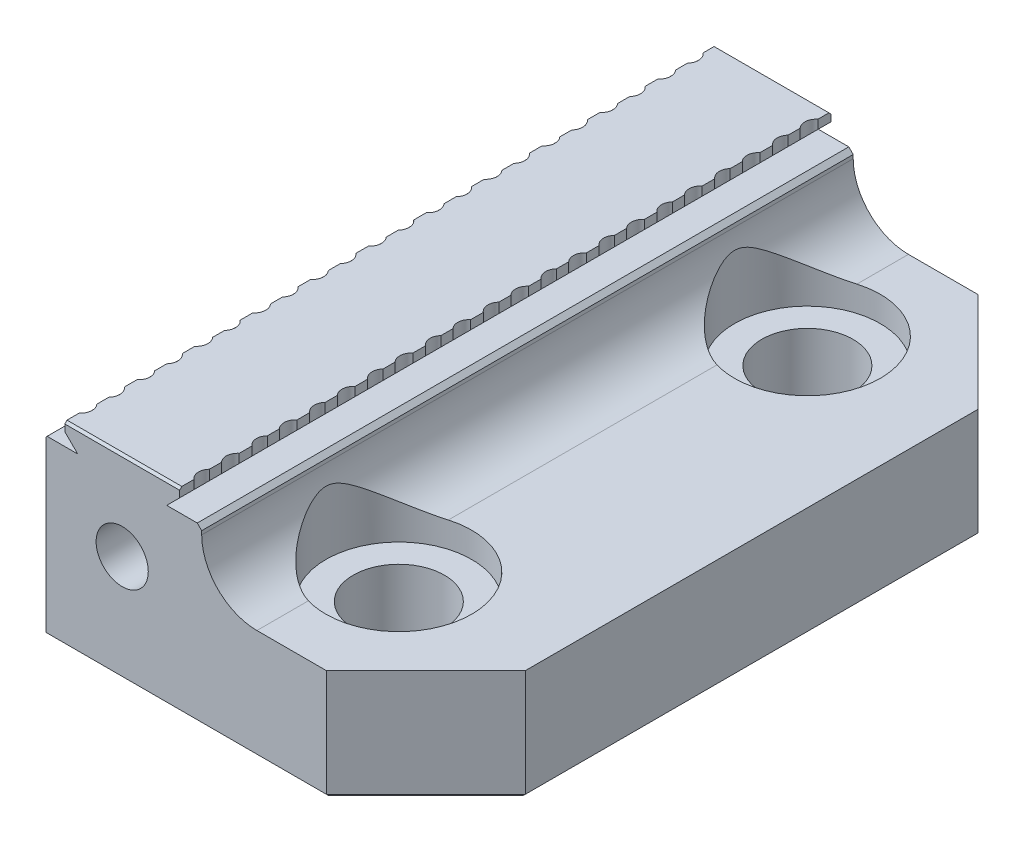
ISO-10303-21;
HEADER;
FILE_DESCRIPTION(('STEP AP214'),'2;1');
FILE_NAME('part.step','',(''),(''),'','','');
FILE_SCHEMA(('AUTOMOTIVE_DESIGN { 1 0 10303 214 1 1 1 1 }'));
ENDSEC;
DATA;
#1=APPLICATION_CONTEXT('core data for automotive mechanical design processes');
#2=APPLICATION_PROTOCOL_DEFINITION('international standard','automotive_design',2000,#1);
#3=PRODUCT_CONTEXT('',#1,'mechanical');
#4=PRODUCT('Part','Part','',(#3));
#5=PRODUCT_RELATED_PRODUCT_CATEGORY('part','',(#4));
#6=PRODUCT_DEFINITION_FORMATION('','',#4);
#7=PRODUCT_DEFINITION_CONTEXT('part definition',#1,'design');
#8=PRODUCT_DEFINITION('design','',#6,#7);
#9=PRODUCT_DEFINITION_SHAPE('','',#8);
#10=(LENGTH_UNIT() NAMED_UNIT(*) SI_UNIT(.MILLI.,.METRE.));
#11=(NAMED_UNIT(*) PLANE_ANGLE_UNIT() SI_UNIT($,.RADIAN.));
#12=(NAMED_UNIT(*) SI_UNIT($,.STERADIAN.) SOLID_ANGLE_UNIT());
#13=UNCERTAINTY_MEASURE_WITH_UNIT(LENGTH_MEASURE(1.E-05),#10,'distance_accuracy_value','');
#14=(GEOMETRIC_REPRESENTATION_CONTEXT(3) GLOBAL_UNCERTAINTY_ASSIGNED_CONTEXT((#13)) GLOBAL_UNIT_ASSIGNED_CONTEXT((#10,
#11,#12)) REPRESENTATION_CONTEXT('',''));
#15=CARTESIAN_POINT('',(0.,0.,0.));
#16=DIRECTION('',(0.,0.,1.));
#17=DIRECTION('',(1.,0.,0.));
#18=AXIS2_PLACEMENT_3D('',#15,#16,#17);
#19=CARTESIAN_POINT('',(-6.2865,10.2235,37.465));
#20=DIRECTION('',(-1.,0.,0.));
#21=DIRECTION('',(0.,-1.,0.));
#22=AXIS2_PLACEMENT_3D('',#19,#20,#21);
#23=PLANE('',#22);
#24=DIRECTION('',(0.,0.,-1.));
#25=VECTOR('',#24,1.);
#26=CARTESIAN_POINT('',(-6.2865,11.2395,37.465));
#27=LINE('',#26,#25);
#28=CARTESIAN_POINT('',(-6.2865,11.2395,37.211));
#29=VERTEX_POINT('',#28);
#30=CARTESIAN_POINT('',(-6.2865,11.2395,35.814));
#31=VERTEX_POINT('',#30);
#32=EDGE_CURVE('E1443',#29,#31,#27,.T.);
#33=ORIENTED_EDGE('',*,*,#32,.F.);
#34=DIRECTION('',(0.,-0.707106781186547,0.707106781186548));
#35=VECTOR('',#34,1.);
#36=CARTESIAN_POINT('',(-6.2865,10.9855,37.465));
#37=LINE('',#36,#35);
#38=CARTESIAN_POINT('',(-6.2865,10.9855,37.465));
#39=VERTEX_POINT('',#38);
#40=EDGE_CURVE('E1945',#29,#39,#37,.T.);
#41=ORIENTED_EDGE('',*,*,#40,.T.);
#42=DIRECTION('',(0.,1.,0.));
#43=VECTOR('',#42,1.);
#44=CARTESIAN_POINT('',(-6.2865,10.2235,37.465));
#45=LINE('',#44,#43);
#46=CARTESIAN_POINT('',(-6.2865,10.2235,37.465));
#47=VERTEX_POINT('',#46);
#48=EDGE_CURVE('E1399',#47,#39,#45,.T.);
#49=ORIENTED_EDGE('',*,*,#48,.F.);
#50=DIRECTION('',(0.,0.,-1.));
#51=VECTOR('',#50,1.);
#52=CARTESIAN_POINT('',(-6.2865,10.2235,37.465));
#53=LINE('',#52,#51);
#54=CARTESIAN_POINT('',(-6.28650000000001,10.2235,35.814));
#55=VERTEX_POINT('',#54);
#56=EDGE_CURVE('E1447',#47,#55,#53,.T.);
#57=ORIENTED_EDGE('',*,*,#56,.T.);
#58=DIRECTION('',(0.,-1.,0.));
#59=VECTOR('',#58,1.);
#60=CARTESIAN_POINT('',(-6.28649999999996,-11.2405,35.814));
#61=LINE('',#60,#59);
#62=EDGE_CURVE('E835',#31,#55,#61,.T.);
#63=ORIENTED_EDGE('',*,*,#62,.F.);
#64=EDGE_LOOP('',(#33,#41,#49,#57,#63));
#65=FACE_BOUND('',#64,.T.);
#66=ADVANCED_FACE('F38',(#65),#23,.F.);
#67=CARTESIAN_POINT('',(-19.4945,10.2235,37.465));
#68=DIRECTION('',(1.,0.,0.));
#69=DIRECTION('',(0.,0.,-1.));
#70=AXIS2_PLACEMENT_3D('',#67,#68,#69);
#71=PLANE('',#70);
#72=DIRECTION('',(0.,-1.,0.));
#73=VECTOR('',#72,1.);
#74=CARTESIAN_POINT('',(-19.4945,10.2235,37.465));
#75=LINE('',#74,#73);
#76=CARTESIAN_POINT('',(-19.4945,10.9855,37.465));
#77=VERTEX_POINT('',#76);
#78=CARTESIAN_POINT('',(-19.4945,10.2235,37.465));
#79=VERTEX_POINT('',#78);
#80=EDGE_CURVE('E1402',#77,#79,#75,.T.);
#81=ORIENTED_EDGE('',*,*,#80,.F.);
#82=DIRECTION('',(0.,0.707106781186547,-0.707106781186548));
#83=VECTOR('',#82,1.);
#84=CARTESIAN_POINT('',(-19.4945,10.9855,37.465));
#85=LINE('',#84,#83);
#86=CARTESIAN_POINT('',(-19.4945,11.2395,37.211));
#87=VERTEX_POINT('',#86);
#88=EDGE_CURVE('E1943',#77,#87,#85,.T.);
#89=ORIENTED_EDGE('',*,*,#88,.T.);
#90=DIRECTION('',(0.,0.,-1.));
#91=VECTOR('',#90,1.);
#92=CARTESIAN_POINT('',(-19.4945,11.2395,37.465));
#93=LINE('',#92,#91);
#94=CARTESIAN_POINT('',(-19.4945,11.2395,35.814));
#95=VERTEX_POINT('',#94);
#96=EDGE_CURVE('E1439',#87,#95,#93,.T.);
#97=ORIENTED_EDGE('',*,*,#96,.T.);
#98=DIRECTION('',(0.,1.,0.));
#99=VECTOR('',#98,1.);
#100=CARTESIAN_POINT('',(-19.4945,-11.2405,35.814));
#101=LINE('',#100,#99);
#102=CARTESIAN_POINT('',(-19.4945,10.2235,35.814));
#103=VERTEX_POINT('',#102);
#104=EDGE_CURVE('E843',#103,#95,#101,.T.);
#105=ORIENTED_EDGE('',*,*,#104,.F.);
#106=DIRECTION('',(0.,0.,-1.));
#107=VECTOR('',#106,1.);
#108=CARTESIAN_POINT('',(-19.4945,10.2235,37.465));
#109=LINE('',#108,#107);
#110=EDGE_CURVE('E1434',#79,#103,#109,.T.);
#111=ORIENTED_EDGE('',*,*,#110,.F.);
#112=EDGE_LOOP('',(#81,#89,#97,#105,#111));
#113=FACE_BOUND('',#112,.T.);
#114=ADVANCED_FACE('F1785',(#113),#71,.F.);
#115=CARTESIAN_POINT('',(-6.28650000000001,11.2395,30.607));
#116=VERTEX_POINT('',#115);
#117=CARTESIAN_POINT('',(-6.2865,11.2395,29.1592));
#118=VERTEX_POINT('',#117);
#119=EDGE_CURVE('E1446',#116,#118,#27,.T.);
#120=ORIENTED_EDGE('',*,*,#119,.F.);
#121=DIRECTION('',(0.,1.,0.));
#122=VECTOR('',#121,1.);
#123=CARTESIAN_POINT('',(-6.28649999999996,-11.2405,30.607));
#124=LINE('',#123,#122);
#125=CARTESIAN_POINT('',(-6.28650000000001,10.2235,30.607));
#126=VERTEX_POINT('',#125);
#127=EDGE_CURVE('E820',#126,#116,#124,.T.);
#128=ORIENTED_EDGE('',*,*,#127,.F.);
#129=CARTESIAN_POINT('',(-6.28650000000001,10.2235,29.1592));
#130=VERTEX_POINT('',#129);
#131=EDGE_CURVE('E1451',#126,#130,#53,.T.);
#132=ORIENTED_EDGE('',*,*,#131,.T.);
#133=DIRECTION('',(0.,-1.,0.));
#134=VECTOR('',#133,1.);
#135=CARTESIAN_POINT('',(-6.28649999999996,-11.2405,29.1592));
#136=LINE('',#135,#134);
#137=EDGE_CURVE('E883',#118,#130,#136,.T.);
#138=ORIENTED_EDGE('',*,*,#137,.F.);
#139=EDGE_LOOP('',(#120,#128,#132,#138));
#140=FACE_BOUND('',#139,.T.);
#141=ADVANCED_FACE('F1812',(#140),#23,.F.);
#142=CARTESIAN_POINT('',(-19.4945,10.2235,30.607));
#143=VERTEX_POINT('',#142);
#144=CARTESIAN_POINT('',(-19.4945,10.2235,29.1592));
#145=VERTEX_POINT('',#144);
#146=EDGE_CURVE('E1438',#143,#145,#109,.T.);
#147=ORIENTED_EDGE('',*,*,#146,.F.);
#148=DIRECTION('',(0.,1.,0.));
#149=VECTOR('',#148,1.);
#150=CARTESIAN_POINT('',(-19.4945,-11.2405,30.607));
#151=LINE('',#150,#149);
#152=CARTESIAN_POINT('',(-19.4945,11.2395,30.607));
#153=VERTEX_POINT('',#152);
#154=EDGE_CURVE('E848',#153,#143,#151,.F.);
#155=ORIENTED_EDGE('',*,*,#154,.F.);
#156=CARTESIAN_POINT('',(-19.4945,11.2395,29.1592));
#157=VERTEX_POINT('',#156);
#158=EDGE_CURVE('E1442',#153,#157,#93,.T.);
#159=ORIENTED_EDGE('',*,*,#158,.T.);
#160=DIRECTION('',(0.,1.,0.));
#161=VECTOR('',#160,1.);
#162=CARTESIAN_POINT('',(-19.4945,-11.2405,29.1592));
#163=LINE('',#162,#161);
#164=EDGE_CURVE('E892',#145,#157,#163,.T.);
#165=ORIENTED_EDGE('',*,*,#164,.F.);
#166=EDGE_LOOP('',(#147,#155,#159,#165));
#167=FACE_BOUND('',#166,.T.);
#168=ADVANCED_FACE('F1817',(#167),#71,.F.);
#169=CARTESIAN_POINT('',(-6.28650000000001,11.2395,23.9522));
#170=VERTEX_POINT('',#169);
#171=CARTESIAN_POINT('',(-6.2865,11.2395,22.5044));
#172=VERTEX_POINT('',#171);
#173=EDGE_CURVE('E2349',#170,#172,#27,.T.);
#174=ORIENTED_EDGE('',*,*,#173,.F.);
#175=DIRECTION('',(0.,1.,0.));
#176=VECTOR('',#175,1.);
#177=CARTESIAN_POINT('',(-6.28649999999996,-11.2405,23.9522));
#178=LINE('',#177,#176);
#179=CARTESIAN_POINT('',(-6.2865,10.2235,23.9522));
#180=VERTEX_POINT('',#179);
#181=EDGE_CURVE('E868',#180,#170,#178,.T.);
#182=ORIENTED_EDGE('',*,*,#181,.F.);
#183=CARTESIAN_POINT('',(-6.28650000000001,10.2235,22.5044));
#184=VERTEX_POINT('',#183);
#185=EDGE_CURVE('E2330',#180,#184,#53,.T.);
#186=ORIENTED_EDGE('',*,*,#185,.T.);
#187=DIRECTION('',(0.,-1.,0.));
#188=VECTOR('',#187,1.);
#189=CARTESIAN_POINT('',(-6.28649999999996,-11.2405,22.5044));
#190=LINE('',#189,#188);
#191=EDGE_CURVE('E933',#172,#184,#190,.T.);
#192=ORIENTED_EDGE('',*,*,#191,.F.);
#193=EDGE_LOOP('',(#174,#182,#186,#192));
#194=FACE_BOUND('',#193,.T.);
#195=ADVANCED_FACE('F1821',(#194),#23,.F.);
#196=CARTESIAN_POINT('',(-19.4945,10.2235,23.9522));
#197=VERTEX_POINT('',#196);
#198=CARTESIAN_POINT('',(-19.4945,10.2235,22.5044));
#199=VERTEX_POINT('',#198);
#200=EDGE_CURVE('E2194',#197,#199,#109,.T.);
#201=ORIENTED_EDGE('',*,*,#200,.F.);
#202=DIRECTION('',(0.,1.,0.));
#203=VECTOR('',#202,1.);
#204=CARTESIAN_POINT('',(-19.4945,-11.2405,23.9522));
#205=LINE('',#204,#203);
#206=CARTESIAN_POINT('',(-19.4945,11.2395,23.9522));
#207=VERTEX_POINT('',#206);
#208=EDGE_CURVE('E897',#207,#197,#205,.F.);
#209=ORIENTED_EDGE('',*,*,#208,.F.);
#210=CARTESIAN_POINT('',(-19.4945,11.2395,22.5044));
#211=VERTEX_POINT('',#210);
#212=EDGE_CURVE('E2210',#207,#211,#93,.T.);
#213=ORIENTED_EDGE('',*,*,#212,.T.);
#214=DIRECTION('',(0.,1.,0.));
#215=VECTOR('',#214,1.);
#216=CARTESIAN_POINT('',(-19.4945,-11.2405,22.5044));
#217=LINE('',#216,#215);
#218=EDGE_CURVE('E942',#199,#211,#217,.T.);
#219=ORIENTED_EDGE('',*,*,#218,.F.);
#220=EDGE_LOOP('',(#201,#209,#213,#219));
#221=FACE_BOUND('',#220,.T.);
#222=ADVANCED_FACE('F1826',(#221),#71,.F.);
#223=CARTESIAN_POINT('',(-6.2865,11.2395,17.2974));
#224=VERTEX_POINT('',#223);
#225=CARTESIAN_POINT('',(-6.2865,11.2395,15.8496));
#226=VERTEX_POINT('',#225);
#227=EDGE_CURVE('E2350',#224,#226,#27,.T.);
#228=ORIENTED_EDGE('',*,*,#227,.F.);
#229=DIRECTION('',(0.,1.,0.));
#230=VECTOR('',#229,1.);
#231=CARTESIAN_POINT('',(-6.28649999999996,-11.2405,17.2974));
#232=LINE('',#231,#230);
#233=CARTESIAN_POINT('',(-6.2865,10.2235,17.2974));
#234=VERTEX_POINT('',#233);
#235=EDGE_CURVE('E918',#234,#224,#232,.T.);
#236=ORIENTED_EDGE('',*,*,#235,.F.);
#237=CARTESIAN_POINT('',(-6.28650000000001,10.2235,15.8496));
#238=VERTEX_POINT('',#237);
#239=EDGE_CURVE('E2326',#234,#238,#53,.T.);
#240=ORIENTED_EDGE('',*,*,#239,.T.);
#241=DIRECTION('',(0.,-1.,0.));
#242=VECTOR('',#241,1.);
#243=CARTESIAN_POINT('',(-6.28649999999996,-11.2405,15.8496));
#244=LINE('',#243,#242);
#245=EDGE_CURVE('E983',#226,#238,#244,.T.);
#246=ORIENTED_EDGE('',*,*,#245,.F.);
#247=EDGE_LOOP('',(#228,#236,#240,#246));
#248=FACE_BOUND('',#247,.T.);
#249=ADVANCED_FACE('F1830',(#248),#23,.F.);
#250=CARTESIAN_POINT('',(-19.4945,10.2235,17.2974));
#251=VERTEX_POINT('',#250);
#252=CARTESIAN_POINT('',(-19.4945,10.2235,15.8496));
#253=VERTEX_POINT('',#252);
#254=EDGE_CURVE('E2189',#251,#253,#109,.T.);
#255=ORIENTED_EDGE('',*,*,#254,.F.);
#256=DIRECTION('',(0.,1.,0.));
#257=VECTOR('',#256,1.);
#258=CARTESIAN_POINT('',(-19.4945,-11.2405,17.2974));
#259=LINE('',#258,#257);
#260=CARTESIAN_POINT('',(-19.4945,11.2395,17.2974));
#261=VERTEX_POINT('',#260);
#262=EDGE_CURVE('E947',#261,#251,#259,.F.);
#263=ORIENTED_EDGE('',*,*,#262,.F.);
#264=CARTESIAN_POINT('',(-19.4945,11.2395,15.8496));
#265=VERTEX_POINT('',#264);
#266=EDGE_CURVE('E2211',#261,#265,#93,.T.);
#267=ORIENTED_EDGE('',*,*,#266,.T.);
#268=DIRECTION('',(0.,1.,0.));
#269=VECTOR('',#268,1.);
#270=CARTESIAN_POINT('',(-19.4945,-11.2405,15.8496));
#271=LINE('',#270,#269);
#272=EDGE_CURVE('E992',#253,#265,#271,.T.);
#273=ORIENTED_EDGE('',*,*,#272,.F.);
#274=EDGE_LOOP('',(#255,#263,#267,#273));
#275=FACE_BOUND('',#274,.T.);
#276=ADVANCED_FACE('F1835',(#275),#71,.F.);
#277=CARTESIAN_POINT('',(-6.2865,11.2395,10.6426));
#278=VERTEX_POINT('',#277);
#279=CARTESIAN_POINT('',(-6.2865,11.2395,9.1948));
#280=VERTEX_POINT('',#279);
#281=EDGE_CURVE('E2352',#278,#280,#27,.T.);
#282=ORIENTED_EDGE('',*,*,#281,.F.);
#283=DIRECTION('',(0.,1.,0.));
#284=VECTOR('',#283,1.);
#285=CARTESIAN_POINT('',(-6.28649999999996,-11.2405,10.6426));
#286=LINE('',#285,#284);
#287=CARTESIAN_POINT('',(-6.2865,10.2235,10.6426));
#288=VERTEX_POINT('',#287);
#289=EDGE_CURVE('E968',#288,#278,#286,.T.);
#290=ORIENTED_EDGE('',*,*,#289,.F.);
#291=CARTESIAN_POINT('',(-6.28650000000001,10.2235,9.1948));
#292=VERTEX_POINT('',#291);
#293=EDGE_CURVE('E2322',#288,#292,#53,.T.);
#294=ORIENTED_EDGE('',*,*,#293,.T.);
#295=DIRECTION('',(0.,-1.,0.));
#296=VECTOR('',#295,1.);
#297=CARTESIAN_POINT('',(-6.28649999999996,-11.2405,9.1948));
#298=LINE('',#297,#296);
#299=EDGE_CURVE('E1036',#280,#292,#298,.T.);
#300=ORIENTED_EDGE('',*,*,#299,.F.);
#301=EDGE_LOOP('',(#282,#290,#294,#300));
#302=FACE_BOUND('',#301,.T.);
#303=ADVANCED_FACE('F1839',(#302),#23,.F.);
#304=CARTESIAN_POINT('',(-19.4945,10.2235,10.6426));
#305=VERTEX_POINT('',#304);
#306=CARTESIAN_POINT('',(-19.4945,10.2235,9.1948));
#307=VERTEX_POINT('',#306);
#308=EDGE_CURVE('E2184',#305,#307,#109,.T.);
#309=ORIENTED_EDGE('',*,*,#308,.F.);
#310=DIRECTION('',(0.,1.,0.));
#311=VECTOR('',#310,1.);
#312=CARTESIAN_POINT('',(-19.4945,-11.2405,10.6426));
#313=LINE('',#312,#311);
#314=CARTESIAN_POINT('',(-19.4945,11.2395,10.6426));
#315=VERTEX_POINT('',#314);
#316=EDGE_CURVE('E997',#315,#305,#313,.F.);
#317=ORIENTED_EDGE('',*,*,#316,.F.);
#318=CARTESIAN_POINT('',(-19.4945,11.2395,9.19480000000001));
#319=VERTEX_POINT('',#318);
#320=EDGE_CURVE('E2215',#315,#319,#93,.T.);
#321=ORIENTED_EDGE('',*,*,#320,.T.);
#322=DIRECTION('',(0.,1.,0.));
#323=VECTOR('',#322,1.);
#324=CARTESIAN_POINT('',(-19.4945,-11.2405,9.1948));
#325=LINE('',#324,#323);
#326=EDGE_CURVE('E1045',#307,#319,#325,.T.);
#327=ORIENTED_EDGE('',*,*,#326,.F.);
#328=EDGE_LOOP('',(#309,#317,#321,#327));
#329=FACE_BOUND('',#328,.T.);
#330=ADVANCED_FACE('F1844',(#329),#71,.F.);
#331=CARTESIAN_POINT('',(-6.2865,11.2395,3.98780000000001));
#332=VERTEX_POINT('',#331);
#333=CARTESIAN_POINT('',(-6.2865,11.2395,2.54));
#334=VERTEX_POINT('',#333);
#335=EDGE_CURVE('E2355',#332,#334,#27,.T.);
#336=ORIENTED_EDGE('',*,*,#335,.F.);
#337=DIRECTION('',(0.,1.,0.));
#338=VECTOR('',#337,1.);
#339=CARTESIAN_POINT('',(-6.28649999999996,-11.2405,3.98779999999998));
#340=LINE('',#339,#338);
#341=CARTESIAN_POINT('',(-6.2865,10.2235,3.98780000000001));
#342=VERTEX_POINT('',#341);
#343=EDGE_CURVE('E1021',#342,#332,#340,.T.);
#344=ORIENTED_EDGE('',*,*,#343,.F.);
#345=CARTESIAN_POINT('',(-6.2865,10.2235,2.54));
#346=VERTEX_POINT('',#345);
#347=EDGE_CURVE('E2318',#342,#346,#53,.T.);
#348=ORIENTED_EDGE('',*,*,#347,.T.);
#349=DIRECTION('',(0.,-1.,0.));
#350=VECTOR('',#349,1.);
#351=CARTESIAN_POINT('',(-6.28649999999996,-11.2405,2.54));
#352=LINE('',#351,#350);
#353=EDGE_CURVE('E1096',#334,#346,#352,.T.);
#354=ORIENTED_EDGE('',*,*,#353,.F.);
#355=EDGE_LOOP('',(#336,#344,#348,#354));
#356=FACE_BOUND('',#355,.T.);
#357=ADVANCED_FACE('F1848',(#356),#23,.F.);
#358=CARTESIAN_POINT('',(-19.4945,10.2235,3.98780000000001));
#359=VERTEX_POINT('',#358);
#360=CARTESIAN_POINT('',(-19.4945,10.2235,2.54));
#361=VERTEX_POINT('',#360);
#362=EDGE_CURVE('E2179',#359,#361,#109,.T.);
#363=ORIENTED_EDGE('',*,*,#362,.F.);
#364=DIRECTION('',(0.,1.,0.));
#365=VECTOR('',#364,1.);
#366=CARTESIAN_POINT('',(-19.4945,-11.2405,3.9878));
#367=LINE('',#366,#365);
#368=CARTESIAN_POINT('',(-19.4945,11.2395,3.98780000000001));
#369=VERTEX_POINT('',#368);
#370=EDGE_CURVE('E1051',#369,#359,#367,.F.);
#371=ORIENTED_EDGE('',*,*,#370,.F.);
#372=CARTESIAN_POINT('',(-19.4945,11.2395,2.54));
#373=VERTEX_POINT('',#372);
#374=EDGE_CURVE('E2219',#369,#373,#93,.T.);
#375=ORIENTED_EDGE('',*,*,#374,.T.);
#376=DIRECTION('',(0.,1.,0.));
#377=VECTOR('',#376,1.);
#378=CARTESIAN_POINT('',(-19.4945,-11.2405,2.54));
#379=LINE('',#378,#377);
#380=EDGE_CURVE('E1105',#361,#373,#379,.T.);
#381=ORIENTED_EDGE('',*,*,#380,.F.);
#382=EDGE_LOOP('',(#363,#371,#375,#381));
#383=FACE_BOUND('',#382,.T.);
#384=ADVANCED_FACE('F1853',(#383),#71,.F.);
#385=CARTESIAN_POINT('',(-6.2865,11.2395,-2.667));
#386=VERTEX_POINT('',#385);
#387=CARTESIAN_POINT('',(-6.2865,11.2395,-4.1148));
#388=VERTEX_POINT('',#387);
#389=EDGE_CURVE('E2358',#386,#388,#27,.T.);
#390=ORIENTED_EDGE('',*,*,#389,.F.);
#391=DIRECTION('',(0.,1.,0.));
#392=VECTOR('',#391,1.);
#393=CARTESIAN_POINT('',(-6.28649999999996,-11.2405,-2.66700000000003));
#394=LINE('',#393,#392);
#395=CARTESIAN_POINT('',(-6.2865,10.2235,-2.667));
#396=VERTEX_POINT('',#395);
#397=EDGE_CURVE('E1081',#396,#386,#394,.T.);
#398=ORIENTED_EDGE('',*,*,#397,.F.);
#399=CARTESIAN_POINT('',(-6.2865,10.2235,-4.1148));
#400=VERTEX_POINT('',#399);
#401=EDGE_CURVE('E2314',#396,#400,#53,.T.);
#402=ORIENTED_EDGE('',*,*,#401,.T.);
#403=DIRECTION('',(0.,-1.,0.));
#404=VECTOR('',#403,1.);
#405=CARTESIAN_POINT('',(-6.28649999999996,-11.2405,-4.1148));
#406=LINE('',#405,#404);
#407=EDGE_CURVE('E1151',#388,#400,#406,.T.);
#408=ORIENTED_EDGE('',*,*,#407,.F.);
#409=EDGE_LOOP('',(#390,#398,#402,#408));
#410=FACE_BOUND('',#409,.T.);
#411=ADVANCED_FACE('F1857',(#410),#23,.F.);
#412=CARTESIAN_POINT('',(-19.4945,10.2235,-2.667));
#413=VERTEX_POINT('',#412);
#414=CARTESIAN_POINT('',(-19.4945,10.2235,-4.1148));
#415=VERTEX_POINT('',#414);
#416=EDGE_CURVE('E2175',#413,#415,#109,.T.);
#417=ORIENTED_EDGE('',*,*,#416,.F.);
#418=DIRECTION('',(0.,1.,0.));
#419=VECTOR('',#418,1.);
#420=CARTESIAN_POINT('',(-19.4945,-11.2405,-2.667));
#421=LINE('',#420,#419);
#422=CARTESIAN_POINT('',(-19.4945,11.2395,-2.667));
#423=VERTEX_POINT('',#422);
#424=EDGE_CURVE('E1111',#423,#413,#421,.F.);
#425=ORIENTED_EDGE('',*,*,#424,.F.);
#426=CARTESIAN_POINT('',(-19.4945,11.2395,-4.11479999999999));
#427=VERTEX_POINT('',#426);
#428=EDGE_CURVE('E2224',#423,#427,#93,.T.);
#429=ORIENTED_EDGE('',*,*,#428,.T.);
#430=DIRECTION('',(0.,1.,0.));
#431=VECTOR('',#430,1.);
#432=CARTESIAN_POINT('',(-19.4945,-11.2405,-4.1148));
#433=LINE('',#432,#431);
#434=EDGE_CURVE('E1160',#415,#427,#433,.T.);
#435=ORIENTED_EDGE('',*,*,#434,.F.);
#436=EDGE_LOOP('',(#417,#425,#429,#435));
#437=FACE_BOUND('',#436,.T.);
#438=ADVANCED_FACE('F1862',(#437),#71,.F.);
#439=CARTESIAN_POINT('',(-6.2865,11.2395,-9.32179999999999));
#440=VERTEX_POINT('',#439);
#441=CARTESIAN_POINT('',(-6.2865,11.2395,-10.7696));
#442=VERTEX_POINT('',#441);
#443=EDGE_CURVE('E2361',#440,#442,#27,.T.);
#444=ORIENTED_EDGE('',*,*,#443,.F.);
#445=DIRECTION('',(0.,1.,0.));
#446=VECTOR('',#445,1.);
#447=CARTESIAN_POINT('',(-6.28649999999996,-11.2405,-9.32180000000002));
#448=LINE('',#447,#446);
#449=CARTESIAN_POINT('',(-6.2865,10.2235,-9.32179999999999));
#450=VERTEX_POINT('',#449);
#451=EDGE_CURVE('E1136',#450,#440,#448,.T.);
#452=ORIENTED_EDGE('',*,*,#451,.F.);
#453=CARTESIAN_POINT('',(-6.2865,10.2235,-10.7696));
#454=VERTEX_POINT('',#453);
#455=EDGE_CURVE('E2310',#450,#454,#53,.T.);
#456=ORIENTED_EDGE('',*,*,#455,.T.);
#457=DIRECTION('',(0.,-1.,0.));
#458=VECTOR('',#457,1.);
#459=CARTESIAN_POINT('',(-6.28649999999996,-11.2405,-10.7696));
#460=LINE('',#459,#458);
#461=EDGE_CURVE('E1201',#442,#454,#460,.T.);
#462=ORIENTED_EDGE('',*,*,#461,.F.);
#463=EDGE_LOOP('',(#444,#452,#456,#462));
#464=FACE_BOUND('',#463,.T.);
#465=ADVANCED_FACE('F1866',(#464),#23,.F.);
#466=CARTESIAN_POINT('',(-19.4945,10.2235,-9.32179999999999));
#467=VERTEX_POINT('',#466);
#468=CARTESIAN_POINT('',(-19.4945,10.2235,-10.7696));
#469=VERTEX_POINT('',#468);
#470=EDGE_CURVE('E2171',#467,#469,#109,.T.);
#471=ORIENTED_EDGE('',*,*,#470,.F.);
#472=DIRECTION('',(0.,1.,0.));
#473=VECTOR('',#472,1.);
#474=CARTESIAN_POINT('',(-19.4945,-11.2405,-9.3218));
#475=LINE('',#474,#473);
#476=CARTESIAN_POINT('',(-19.4945,11.2395,-9.32179999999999));
#477=VERTEX_POINT('',#476);
#478=EDGE_CURVE('E1165',#477,#467,#475,.F.);
#479=ORIENTED_EDGE('',*,*,#478,.F.);
#480=CARTESIAN_POINT('',(-19.4945,11.2395,-10.7696));
#481=VERTEX_POINT('',#480);
#482=EDGE_CURVE('E2228',#477,#481,#93,.T.);
#483=ORIENTED_EDGE('',*,*,#482,.T.);
#484=DIRECTION('',(0.,1.,0.));
#485=VECTOR('',#484,1.);
#486=CARTESIAN_POINT('',(-19.4945,-11.2405,-10.7696));
#487=LINE('',#486,#485);
#488=EDGE_CURVE('E1210',#469,#481,#487,.T.);
#489=ORIENTED_EDGE('',*,*,#488,.F.);
#490=EDGE_LOOP('',(#471,#479,#483,#489));
#491=FACE_BOUND('',#490,.T.);
#492=ADVANCED_FACE('F1871',(#491),#71,.F.);
#493=CARTESIAN_POINT('',(-6.2865,11.2395,-15.9766));
#494=VERTEX_POINT('',#493);
#495=CARTESIAN_POINT('',(-6.2865,11.2395,-17.4244));
#496=VERTEX_POINT('',#495);
#497=EDGE_CURVE('E1913',#494,#496,#27,.T.);
#498=ORIENTED_EDGE('',*,*,#497,.F.);
#499=DIRECTION('',(0.,1.,0.));
#500=VECTOR('',#499,1.);
#501=CARTESIAN_POINT('',(-6.28649999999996,-11.2405,-15.9766));
#502=LINE('',#501,#500);
#503=CARTESIAN_POINT('',(-6.2865,10.2235,-15.9766));
#504=VERTEX_POINT('',#503);
#505=EDGE_CURVE('E1186',#504,#494,#502,.T.);
#506=ORIENTED_EDGE('',*,*,#505,.F.);
#507=CARTESIAN_POINT('',(-6.2865,10.2235,-17.4244));
#508=VERTEX_POINT('',#507);
#509=EDGE_CURVE('E2306',#504,#508,#53,.T.);
#510=ORIENTED_EDGE('',*,*,#509,.T.);
#511=DIRECTION('',(0.,-1.,0.));
#512=VECTOR('',#511,1.);
#513=CARTESIAN_POINT('',(-6.28649999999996,-11.2405,-17.4244));
#514=LINE('',#513,#512);
#515=EDGE_CURVE('E1251',#496,#508,#514,.T.);
#516=ORIENTED_EDGE('',*,*,#515,.F.);
#517=EDGE_LOOP('',(#498,#506,#510,#516));
#518=FACE_BOUND('',#517,.T.);
#519=ADVANCED_FACE('F1875',(#518),#23,.F.);
#520=CARTESIAN_POINT('',(-19.4945,10.2235,-15.9766));
#521=VERTEX_POINT('',#520);
#522=CARTESIAN_POINT('',(-19.4945,10.2235,-17.4244));
#523=VERTEX_POINT('',#522);
#524=EDGE_CURVE('E2167',#521,#523,#109,.T.);
#525=ORIENTED_EDGE('',*,*,#524,.F.);
#526=DIRECTION('',(0.,1.,0.));
#527=VECTOR('',#526,1.);
#528=CARTESIAN_POINT('',(-19.4945,-11.2405,-15.9766));
#529=LINE('',#528,#527);
#530=CARTESIAN_POINT('',(-19.4945,11.2395,-15.9766));
#531=VERTEX_POINT('',#530);
#532=EDGE_CURVE('E1215',#531,#521,#529,.F.);
#533=ORIENTED_EDGE('',*,*,#532,.F.);
#534=CARTESIAN_POINT('',(-19.4945,11.2395,-17.4244));
#535=VERTEX_POINT('',#534);
#536=EDGE_CURVE('E2232',#531,#535,#93,.T.);
#537=ORIENTED_EDGE('',*,*,#536,.T.);
#538=DIRECTION('',(0.,1.,0.));
#539=VECTOR('',#538,1.);
#540=CARTESIAN_POINT('',(-19.4945,-11.2405,-17.4244));
#541=LINE('',#540,#539);
#542=EDGE_CURVE('E1260',#523,#535,#541,.T.);
#543=ORIENTED_EDGE('',*,*,#542,.F.);
#544=EDGE_LOOP('',(#525,#533,#537,#543));
#545=FACE_BOUND('',#544,.T.);
#546=ADVANCED_FACE('F1880',(#545),#71,.F.);
#547=CARTESIAN_POINT('',(-6.2865,11.2395,-22.6314));
#548=VERTEX_POINT('',#547);
#549=CARTESIAN_POINT('',(-6.2865,11.2395,-24.0792));
#550=VERTEX_POINT('',#549);
#551=EDGE_CURVE('E1912',#548,#550,#27,.T.);
#552=ORIENTED_EDGE('',*,*,#551,.F.);
#553=DIRECTION('',(0.,1.,0.));
#554=VECTOR('',#553,1.);
#555=CARTESIAN_POINT('',(-6.28649999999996,-11.2405,-22.6314));
#556=LINE('',#555,#554);
#557=CARTESIAN_POINT('',(-6.2865,10.2235,-22.6314));
#558=VERTEX_POINT('',#557);
#559=EDGE_CURVE('E1236',#558,#548,#556,.T.);
#560=ORIENTED_EDGE('',*,*,#559,.F.);
#561=CARTESIAN_POINT('',(-6.2865,10.2235,-24.0792));
#562=VERTEX_POINT('',#561);
#563=EDGE_CURVE('E2305',#558,#562,#53,.T.);
#564=ORIENTED_EDGE('',*,*,#563,.T.);
#565=DIRECTION('',(0.,-1.,0.));
#566=VECTOR('',#565,1.);
#567=CARTESIAN_POINT('',(-6.28649999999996,-11.2405,-24.0792));
#568=LINE('',#567,#566);
#569=EDGE_CURVE('E1301',#550,#562,#568,.T.);
#570=ORIENTED_EDGE('',*,*,#569,.F.);
#571=EDGE_LOOP('',(#552,#560,#564,#570));
#572=FACE_BOUND('',#571,.T.);
#573=ADVANCED_FACE('F1884',(#572),#23,.F.);
#574=CARTESIAN_POINT('',(-19.4945,10.2235,-22.6314));
#575=VERTEX_POINT('',#574);
#576=CARTESIAN_POINT('',(-19.4945,10.2235,-24.0792));
#577=VERTEX_POINT('',#576);
#578=EDGE_CURVE('E2163',#575,#577,#109,.T.);
#579=ORIENTED_EDGE('',*,*,#578,.F.);
#580=DIRECTION('',(0.,1.,0.));
#581=VECTOR('',#580,1.);
#582=CARTESIAN_POINT('',(-19.4945,-11.2405,-22.6314));
#583=LINE('',#582,#581);
#584=CARTESIAN_POINT('',(-19.4945,11.2395,-22.6314));
#585=VERTEX_POINT('',#584);
#586=EDGE_CURVE('E1265',#585,#575,#583,.F.);
#587=ORIENTED_EDGE('',*,*,#586,.F.);
#588=CARTESIAN_POINT('',(-19.4945,11.2395,-24.0792));
#589=VERTEX_POINT('',#588);
#590=EDGE_CURVE('E2236',#585,#589,#93,.T.);
#591=ORIENTED_EDGE('',*,*,#590,.T.);
#592=DIRECTION('',(0.,1.,0.));
#593=VECTOR('',#592,1.);
#594=CARTESIAN_POINT('',(-19.4945,-11.2405,-24.0792));
#595=LINE('',#594,#593);
#596=EDGE_CURVE('E1310',#577,#589,#595,.T.);
#597=ORIENTED_EDGE('',*,*,#596,.F.);
#598=EDGE_LOOP('',(#579,#587,#591,#597));
#599=FACE_BOUND('',#598,.T.);
#600=ADVANCED_FACE('F1889',(#599),#71,.F.);
#601=CARTESIAN_POINT('',(-6.2865,11.2395,-29.2862));
#602=VERTEX_POINT('',#601);
#603=CARTESIAN_POINT('',(-6.2865,11.2395,-30.734));
#604=VERTEX_POINT('',#603);
#605=EDGE_CURVE('E1908',#602,#604,#27,.T.);
#606=ORIENTED_EDGE('',*,*,#605,.F.);
#607=DIRECTION('',(0.,1.,0.));
#608=VECTOR('',#607,1.);
#609=CARTESIAN_POINT('',(-6.28649999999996,-11.2405,-29.2862));
#610=LINE('',#609,#608);
#611=CARTESIAN_POINT('',(-6.2865,10.2235,-29.2862));
#612=VERTEX_POINT('',#611);
#613=EDGE_CURVE('E1286',#612,#602,#610,.T.);
#614=ORIENTED_EDGE('',*,*,#613,.F.);
#615=CARTESIAN_POINT('',(-6.2865,10.2235,-30.734));
#616=VERTEX_POINT('',#615);
#617=EDGE_CURVE('E2304',#612,#616,#53,.T.);
#618=ORIENTED_EDGE('',*,*,#617,.T.);
#619=DIRECTION('',(0.,-1.,0.));
#620=VECTOR('',#619,1.);
#621=CARTESIAN_POINT('',(-6.28649999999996,-11.2405,-30.734));
#622=LINE('',#621,#620);
#623=EDGE_CURVE('E1351',#604,#616,#622,.T.);
#624=ORIENTED_EDGE('',*,*,#623,.F.);
#625=EDGE_LOOP('',(#606,#614,#618,#624));
#626=FACE_BOUND('',#625,.T.);
#627=ADVANCED_FACE('F1795',(#626),#23,.F.);
#628=CARTESIAN_POINT('',(-19.4945,10.2235,-29.2862));
#629=VERTEX_POINT('',#628);
#630=CARTESIAN_POINT('',(-19.4945,10.2235,-30.734));
#631=VERTEX_POINT('',#630);
#632=EDGE_CURVE('E2162',#629,#631,#109,.T.);
#633=ORIENTED_EDGE('',*,*,#632,.F.);
#634=DIRECTION('',(0.,1.,0.));
#635=VECTOR('',#634,1.);
#636=CARTESIAN_POINT('',(-19.4945,-11.2405,-29.2862));
#637=LINE('',#636,#635);
#638=CARTESIAN_POINT('',(-19.4945,11.2395,-29.2862));
#639=VERTEX_POINT('',#638);
#640=EDGE_CURVE('E1315',#639,#629,#637,.F.);
#641=ORIENTED_EDGE('',*,*,#640,.F.);
#642=CARTESIAN_POINT('',(-19.4945,11.2395,-30.734));
#643=VERTEX_POINT('',#642);
#644=EDGE_CURVE('E2240',#639,#643,#93,.T.);
#645=ORIENTED_EDGE('',*,*,#644,.T.);
#646=DIRECTION('',(0.,1.,0.));
#647=VECTOR('',#646,1.);
#648=CARTESIAN_POINT('',(-19.4945,-11.2405,-30.734));
#649=LINE('',#648,#647);
#650=EDGE_CURVE('E1360',#631,#643,#649,.T.);
#651=ORIENTED_EDGE('',*,*,#650,.F.);
#652=EDGE_LOOP('',(#633,#641,#645,#651));
#653=FACE_BOUND('',#652,.T.);
#654=ADVANCED_FACE('F1786',(#653),#71,.F.);
#655=CARTESIAN_POINT('',(-22.0345,-11.2395,37.465));
#656=DIRECTION('',(1.,0.,0.));
#657=DIRECTION('',(0.,0.,-1.));
#658=AXIS2_PLACEMENT_3D('',#655,#656,#657);
#659=PLANE('',#658);
#660=DIRECTION('',(0.,-1.,0.));
#661=VECTOR('',#660,1.);
#662=CARTESIAN_POINT('',(-22.0345,-11.2395,-37.084));
#663=LINE('',#662,#661);
#664=CARTESIAN_POINT('',(-22.0345,8.2315,-37.084));
#665=VERTEX_POINT('',#664);
#666=CARTESIAN_POINT('',(-22.0345,-10.8585,-37.084));
#667=VERTEX_POINT('',#666);
#668=EDGE_CURVE('E2017',#665,#667,#663,.T.);
#669=ORIENTED_EDGE('',*,*,#668,.T.);
#670=DIRECTION('',(0.,0.,1.));
#671=VECTOR('',#670,1.);
#672=CARTESIAN_POINT('',(-22.0345,-10.8585,37.465));
#673=LINE('',#672,#671);
#674=CARTESIAN_POINT('',(-22.0345,-10.8585,37.084));
#675=VERTEX_POINT('',#674);
#676=EDGE_CURVE('E60',#667,#675,#673,.T.);
#677=ORIENTED_EDGE('',*,*,#676,.T.);
#678=DIRECTION('',(0.,1.,0.));
#679=VECTOR('',#678,1.);
#680=CARTESIAN_POINT('',(-22.0345,8.23149999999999,37.084));
#681=LINE('',#680,#679);
#682=CARTESIAN_POINT('',(-22.0345,8.2315,37.084));
#683=VERTEX_POINT('',#682);
#684=EDGE_CURVE('E2002',#675,#683,#681,.T.);
#685=ORIENTED_EDGE('',*,*,#684,.T.);
#686=DIRECTION('',(0.,0.,-1.));
#687=VECTOR('',#686,1.);
#688=CARTESIAN_POINT('',(-22.0345,8.2315,37.465));
#689=LINE('',#688,#687);
#690=EDGE_CURVE('E1947',#683,#665,#689,.T.);
#691=ORIENTED_EDGE('',*,*,#690,.T.);
#692=EDGE_LOOP('',(#669,#677,#685,#691));
#693=FACE_BOUND('',#692,.T.);
#694=ADVANCED_FACE('F1903',(#693),#659,.F.);
#695=CARTESIAN_POINT('',(-22.0345,-11.2395,37.465));
#696=DIRECTION('',(0.,1.,0.));
#697=DIRECTION('',(0.,0.,1.));
#698=AXIS2_PLACEMENT_3D('',#695,#696,#697);
#699=PLANE('',#698);
#700=CARTESIAN_POINT('',(4.953,-11.2395,23.495));
#701=DIRECTION('',(0.,1.,0.));
#702=DIRECTION('',(0.,0.,1.));
#703=AXIS2_PLACEMENT_3D('',#700,#701,#702);
#704=CIRCLE('',#703,5.63100000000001);
#705=CARTESIAN_POINT('',(4.953,-11.2395,29.126));
#706=VERTEX_POINT('',#705);
#707=EDGE_CURVE('E1973',#706,#706,#704,.T.);
#708=ORIENTED_EDGE('',*,*,#707,.T.);
#709=EDGE_LOOP('',(#708));
#710=FACE_BOUND('',#709,.T.);
#711=CARTESIAN_POINT('',(4.953,-11.2395,-23.495));
#712=DIRECTION('',(0.,1.,0.));
#713=DIRECTION('',(0.,0.,1.));
#714=AXIS2_PLACEMENT_3D('',#711,#712,#713);
#715=CIRCLE('',#714,5.63100000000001);
#716=CARTESIAN_POINT('',(4.953,-11.2395,-17.864));
#717=VERTEX_POINT('',#716);
#718=EDGE_CURVE('E1970',#717,#717,#715,.T.);
#719=ORIENTED_EDGE('',*,*,#718,.T.);
#720=EDGE_LOOP('',(#719));
#721=FACE_BOUND('',#720,.T.);
#722=CARTESIAN_POINT('',(16.653,-11.2395,23.5));
#723=DIRECTION('',(0.,-1.,0.));
#724=DIRECTION('',(0.,0.,-1.));
#725=AXIS2_PLACEMENT_3D('',#722,#723,#724);
#726=CIRCLE('',#725,4.00635);
#727=CARTESIAN_POINT('',(16.653,-11.2395,19.49365));
#728=VERTEX_POINT('',#727);
#729=EDGE_CURVE('E790',#728,#728,#726,.T.);
#730=ORIENTED_EDGE('',*,*,#729,.F.);
#731=EDGE_LOOP('',(#730));
#732=FACE_BOUND('',#731,.T.);
#733=CARTESIAN_POINT('',(-6.74699999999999,-11.2395,-23.5));
#734=DIRECTION('',(0.,-1.,0.));
#735=DIRECTION('',(0.,0.,-1.));
#736=AXIS2_PLACEMENT_3D('',#733,#734,#735);
#737=CIRCLE('',#736,4.00635);
#738=CARTESIAN_POINT('',(-6.74699999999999,-11.2395,-27.50635));
#739=VERTEX_POINT('',#738);
#740=EDGE_CURVE('E796',#739,#739,#737,.T.);
#741=ORIENTED_EDGE('',*,*,#740,.F.);
#742=EDGE_LOOP('',(#741));
#743=FACE_BOUND('',#742,.T.);
#744=DIRECTION('',(-1.,0.,0.));
#745=VECTOR('',#744,1.);
#746=CARTESIAN_POINT('',(-22.0345,-11.2395,37.084));
#747=LINE('',#746,#745);
#748=CARTESIAN_POINT('',(10.4466846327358,-11.2395,37.084));
#749=VERTEX_POINT('',#748);
#750=CARTESIAN_POINT('',(-21.6535,-11.2395,37.084));
#751=VERTEX_POINT('',#750);
#752=EDGE_CURVE('E1984',#749,#751,#747,.T.);
#753=ORIENTED_EDGE('',*,*,#752,.T.);
#754=DIRECTION('',(0.,0.,-1.));
#755=VECTOR('',#754,1.);
#756=CARTESIAN_POINT('',(-21.6535,-11.2395,37.465));
#757=LINE('',#756,#755);
#758=CARTESIAN_POINT('',(-21.6535,-11.2395,-37.084));
#759=VERTEX_POINT('',#758);
#760=EDGE_CURVE('E2032',#751,#759,#757,.T.);
#761=ORIENTED_EDGE('',*,*,#760,.T.);
#762=DIRECTION('',(1.,0.,0.));
#763=VECTOR('',#762,1.);
#764=CARTESIAN_POINT('',(-22.0345,-11.2395,-37.084));
#765=LINE('',#764,#763);
#766=CARTESIAN_POINT('',(10.4466846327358,-11.2395,-37.084));
#767=VERTEX_POINT('',#766);
#768=EDGE_CURVE('E1978',#759,#767,#765,.T.);
#769=ORIENTED_EDGE('',*,*,#768,.T.);
#770=DIRECTION('',(0.707106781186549,0.,0.707106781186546));
#771=VECTOR('',#770,1.);
#772=CARTESIAN_POINT('',(21.7650923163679,-11.2395,-25.7655923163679));
#773=LINE('',#772,#771);
#774=CARTESIAN_POINT('',(21.6535,-11.2395,-25.8771846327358));
#775=VERTEX_POINT('',#774);
#776=EDGE_CURVE('E1976',#767,#775,#773,.T.);
#777=ORIENTED_EDGE('',*,*,#776,.T.);
#778=DIRECTION('',(0.,0.,1.));
#779=VECTOR('',#778,1.);
#780=CARTESIAN_POINT('',(21.6535,-11.2395,37.465));
#781=LINE('',#780,#779);
#782=CARTESIAN_POINT('',(21.6535,-11.2395,25.8771846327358));
#783=VERTEX_POINT('',#782);
#784=EDGE_CURVE('E1980',#775,#783,#781,.T.);
#785=ORIENTED_EDGE('',*,*,#784,.T.);
#786=DIRECTION('',(-0.707106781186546,0.,0.707106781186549));
#787=VECTOR('',#786,1.);
#788=CARTESIAN_POINT('',(10.3350923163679,-11.2395,37.1955923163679));
#789=LINE('',#788,#787);
#790=EDGE_CURVE('E1982',#783,#749,#789,.T.);
#791=ORIENTED_EDGE('',*,*,#790,.T.);
#792=EDGE_LOOP('',(#753,#761,#769,#777,#785,#791));
#793=FACE_BOUND('',#792,.T.);
#794=ADVANCED_FACE('F2056',(#710,#721,#732,#743,#793),#699,.F.);
#795=CARTESIAN_POINT('',(22.0345,-11.2395,37.465));
#796=DIRECTION('',(-1.,0.,0.));
#797=DIRECTION('',(0.,0.,1.));
#798=AXIS2_PLACEMENT_3D('',#795,#796,#797);
#799=PLANE('',#798);
#800=DIRECTION('',(0.,-1.,0.));
#801=VECTOR('',#800,1.);
#802=CARTESIAN_POINT('',(22.0345,-11.2395,26.035));
#803=LINE('',#802,#801);
#804=CARTESIAN_POINT('',(22.0345,1.4605,26.035));
#805=VERTEX_POINT('',#804);
#806=CARTESIAN_POINT('',(22.0345,-10.8585,26.035));
#807=VERTEX_POINT('',#806);
#808=EDGE_CURVE('E2101',#805,#807,#803,.T.);
#809=ORIENTED_EDGE('',*,*,#808,.T.);
#810=DIRECTION('',(0.,0.,-1.));
#811=VECTOR('',#810,1.);
#812=CARTESIAN_POINT('',(22.0345,-10.8585,37.465));
#813=LINE('',#812,#811);
#814=CARTESIAN_POINT('',(22.0345,-10.8585,-26.035));
#815=VERTEX_POINT('',#814);
#816=EDGE_CURVE('E1989',#807,#815,#813,.T.);
#817=ORIENTED_EDGE('',*,*,#816,.T.);
#818=DIRECTION('',(0.,1.,0.));
#819=VECTOR('',#818,1.);
#820=CARTESIAN_POINT('',(22.0345,-11.2395,-26.035));
#821=LINE('',#820,#819);
#822=CARTESIAN_POINT('',(22.0345,1.4605,-26.035));
#823=VERTEX_POINT('',#822);
#824=EDGE_CURVE('E2098',#815,#823,#821,.T.);
#825=ORIENTED_EDGE('',*,*,#824,.T.);
#826=DIRECTION('',(0.,0.,-1.));
#827=VECTOR('',#826,1.);
#828=CARTESIAN_POINT('',(22.0345,1.4605,37.465));
#829=LINE('',#828,#827);
#830=EDGE_CURVE('E1461',#805,#823,#829,.T.);
#831=ORIENTED_EDGE('',*,*,#830,.F.);
#832=EDGE_LOOP('',(#809,#817,#825,#831));
#833=FACE_BOUND('',#832,.T.);
#834=ADVANCED_FACE('F2096',(#833),#799,.F.);
#835=CARTESIAN_POINT('',(22.0345,1.4605,37.465));
#836=DIRECTION('',(0.,-1.,0.));
#837=DIRECTION('',(1.,0.,0.));
#838=AXIS2_PLACEMENT_3D('',#835,#836,#837);
#839=PLANE('',#838);
#840=ORIENTED_EDGE('',*,*,#830,.T.);
#841=DIRECTION('',(0.707106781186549,0.,0.707106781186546));
#842=VECTOR('',#841,1.);
#843=CARTESIAN_POINT('',(22.0345,1.4605,-26.035));
#844=LINE('',#843,#842);
#845=CARTESIAN_POINT('',(10.6045,1.4605,-37.465));
#846=VERTEX_POINT('',#845);
#847=EDGE_CURVE('E2104',#823,#846,#844,.F.);
#848=ORIENTED_EDGE('',*,*,#847,.T.);
#849=DIRECTION('',(-1.,0.,0.));
#850=VECTOR('',#849,1.);
#851=CARTESIAN_POINT('',(22.0345,1.4605,-37.465));
#852=LINE('',#851,#850);
#853=CARTESIAN_POINT('',(2.6035,1.46049999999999,-37.465));
#854=VERTEX_POINT('',#853);
#855=EDGE_CURVE('E1386',#846,#854,#852,.T.);
#856=ORIENTED_EDGE('',*,*,#855,.T.);
#857=DIRECTION('',(0.,0.,-1.));
#858=VECTOR('',#857,1.);
#859=CARTESIAN_POINT('',(2.6035,1.46049999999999,37.465));
#860=LINE('',#859,#858);
#861=CARTESIAN_POINT('',(2.6035,1.46049999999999,-31.5409787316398));
#862=VERTEX_POINT('',#861);
#863=EDGE_CURVE('E1457',#862,#854,#860,.T.);
#864=ORIENTED_EDGE('',*,*,#863,.F.);
#865=CARTESIAN_POINT('',(4.953,1.46049999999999,-23.495));
#866=DIRECTION('',(0.,-1.,0.));
#867=DIRECTION('',(1.,0.,0.));
#868=AXIS2_PLACEMENT_3D('',#865,#866,#867);
#869=CIRCLE('',#868,8.382);
#870=CARTESIAN_POINT('',(2.6035,1.46049999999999,-15.4490212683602));
#871=VERTEX_POINT('',#870);
#872=EDGE_CURVE('E808',#862,#871,#869,.T.);
#873=ORIENTED_EDGE('',*,*,#872,.T.);
#874=CARTESIAN_POINT('',(2.6035,1.46049999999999,15.4490212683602));
#875=VERTEX_POINT('',#874);
#876=EDGE_CURVE('E1462',#875,#871,#860,.T.);
#877=ORIENTED_EDGE('',*,*,#876,.F.);
#878=CARTESIAN_POINT('',(4.953,1.46049999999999,23.495));
#879=DIRECTION('',(0.,-1.,0.));
#880=DIRECTION('',(1.,0.,0.));
#881=AXIS2_PLACEMENT_3D('',#878,#879,#880);
#882=CIRCLE('',#881,8.382);
#883=CARTESIAN_POINT('',(2.6035,1.46049999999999,31.5409787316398));
#884=VERTEX_POINT('',#883);
#885=EDGE_CURVE('E817',#875,#884,#882,.T.);
#886=ORIENTED_EDGE('',*,*,#885,.T.);
#887=CARTESIAN_POINT('',(2.6035,1.46049999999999,37.465));
#888=VERTEX_POINT('',#887);
#889=EDGE_CURVE('E1458',#888,#884,#860,.T.);
#890=ORIENTED_EDGE('',*,*,#889,.F.);
#891=DIRECTION('',(-1.,0.,0.));
#892=VECTOR('',#891,1.);
#893=CARTESIAN_POINT('',(22.0345,1.4605,37.465));
#894=LINE('',#893,#892);
#895=CARTESIAN_POINT('',(10.6045,1.46049999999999,37.465));
#896=VERTEX_POINT('',#895);
#897=EDGE_CURVE('E1387',#896,#888,#894,.T.);
#898=ORIENTED_EDGE('',*,*,#897,.F.);
#899=DIRECTION('',(0.707106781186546,0.,-0.707106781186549));
#900=VECTOR('',#899,1.);
#901=CARTESIAN_POINT('',(10.6045,1.46049999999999,37.465));
#902=LINE('',#901,#900);
#903=EDGE_CURVE('E2105',#896,#805,#902,.T.);
#904=ORIENTED_EDGE('',*,*,#903,.T.);
#905=EDGE_LOOP('',(#840,#848,#856,#864,#873,#877,#886,#890,#898,#904));
#906=FACE_BOUND('',#905,.T.);
#907=ADVANCED_FACE('F1808',(#906),#839,.F.);
#908=CARTESIAN_POINT('',(2.6035,7.81049999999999,37.465));
#909=DIRECTION('',(0.,0.,-1.));
#910=DIRECTION('',(-1.,0.,0.));
#911=AXIS2_PLACEMENT_3D('',#908,#909,#910);
#912=CYLINDRICAL_SURFACE('',#911,6.35);
#913=ORIENTED_EDGE('',*,*,#876,.T.);
#914=CARTESIAN_POINT('',(2.6035,1.46049999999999,-15.4490212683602));
#915=CARTESIAN_POINT('',(2.4337975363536,1.46046838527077,-15.4985311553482));
#916=CARTESIAN_POINT('',(2.26577275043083,1.46730034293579,-15.5534647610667));
#917=CARTESIAN_POINT('',(1.93460450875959,1.49365577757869,-15.6733640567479));
#918=CARTESIAN_POINT('',(1.77145479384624,1.51316217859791,-15.7383161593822));
#919=CARTESIAN_POINT('',(1.45262828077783,1.56359443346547,-15.8769095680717));
#920=CARTESIAN_POINT('',(1.2968950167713,1.59440950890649,-15.9504620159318));
#921=CARTESIAN_POINT('',(0.992116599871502,1.66635813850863,-16.105912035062));
#922=CARTESIAN_POINT('',(0.843073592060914,1.70749497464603,-16.1878122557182));
#923=CARTESIAN_POINT('',(0.408624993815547,1.84419703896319,-16.4438311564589));
#924=CARTESIAN_POINT('',(0.133945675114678,1.95338797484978,-16.6291306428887));
#925=CARTESIAN_POINT('',(-0.384391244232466,2.19999285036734,-17.0237665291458));
#926=CARTESIAN_POINT('',(-0.627958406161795,2.33748616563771,-17.23316978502));
#927=CARTESIAN_POINT('',(-1.03621704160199,2.60268524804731,-17.6255900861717));
#928=CARTESIAN_POINT('',(-1.20681450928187,2.72655869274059,-17.8051386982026));
#929=CARTESIAN_POINT('',(-1.52846425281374,2.98433494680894,-18.1744222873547));
#930=CARTESIAN_POINT('',(-1.67950596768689,3.11824311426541,-18.3641626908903));
#931=CARTESIAN_POINT('',(-1.96276640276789,3.3934002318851,-18.7528432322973));
#932=CARTESIAN_POINT('',(-2.09494824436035,3.53466284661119,-18.9518004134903));
#933=CARTESIAN_POINT('',(-2.3407075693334,3.82139983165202,-19.3578421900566));
#934=CARTESIAN_POINT('',(-2.45429165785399,3.9668726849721,-19.5649238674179));
#935=CARTESIAN_POINT('',(-2.64090165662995,4.22739849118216,-19.9418635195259));
#936=CARTESIAN_POINT('',(-2.71739637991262,4.34226425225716,-20.1101474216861));
#937=CARTESIAN_POINT('',(-2.85944443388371,4.57062295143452,-20.4523074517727));
#938=CARTESIAN_POINT('',(-2.92499344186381,4.68411533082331,-20.6261857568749));
#939=CARTESIAN_POINT('',(-3.04498857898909,4.90653865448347,-20.9800524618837));
#940=CARTESIAN_POINT('',(-3.09945742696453,5.01547856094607,-21.1600274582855));
#941=CARTESIAN_POINT('',(-3.19714985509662,5.22434873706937,-21.5279714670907));
#942=CARTESIAN_POINT('',(-3.24038557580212,5.32428865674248,-21.7159315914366));
#943=CARTESIAN_POINT('',(-3.30999134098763,5.49522681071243,-22.0771927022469));
#944=CARTESIAN_POINT('',(-3.3378270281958,5.56830043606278,-22.2491996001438));
#945=CARTESIAN_POINT('',(-3.38319116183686,5.69238057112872,-22.6021177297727));
#946=CARTESIAN_POINT('',(-3.40075739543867,5.74346779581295,-22.7829936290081));
#947=CARTESIAN_POINT('',(-3.42195482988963,5.80616468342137,-23.1193509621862));
#948=CARTESIAN_POINT('',(-3.42750502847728,5.82316920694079,-23.2736463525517));
#949=CARTESIAN_POINT('',(-3.42996328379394,5.83063980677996,-23.5828388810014));
#950=CARTESIAN_POINT('',(-3.42688011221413,5.82113281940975,-23.7377352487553));
#951=CARTESIAN_POINT('',(-3.41041663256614,5.77184899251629,-24.0862700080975));
#952=CARTESIAN_POINT('',(-3.39439770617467,5.72435026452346,-24.2786282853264));
#953=CARTESIAN_POINT('',(-3.35067587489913,5.60270802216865,-24.6539085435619));
#954=CARTESIAN_POINT('',(-3.32290032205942,5.52839926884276,-24.8367637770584));
#955=CARTESIAN_POINT('',(-3.26816649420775,5.3919166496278,-25.1335420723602));
#956=CARTESIAN_POINT('',(-3.24404801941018,5.33400944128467,-25.2500470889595));
#957=CARTESIAN_POINT('',(-3.19151503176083,5.21345868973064,-25.4796070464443));
#958=CARTESIAN_POINT('',(-3.16309960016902,5.15081413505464,-25.592661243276));
#959=CARTESIAN_POINT('',(-3.07154812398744,4.95804674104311,-25.927763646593));
#960=CARTESIAN_POINT('',(-3.00216948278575,4.82325371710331,-26.1454204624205));
#961=CARTESIAN_POINT('',(-2.84698503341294,4.54863048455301,-26.5723017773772));
#962=CARTESIAN_POINT('',(-2.7611339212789,4.40878726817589,-26.7815010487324));
#963=CARTESIAN_POINT('',(-2.57303871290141,4.12887456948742,-27.1919675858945));
#964=CARTESIAN_POINT('',(-2.47080804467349,3.98880536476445,-27.3932411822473));
#965=CARTESIAN_POINT('',(-2.2443229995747,3.70493868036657,-27.7976328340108));
#966=CARTESIAN_POINT('',(-2.11925978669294,3.56127504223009,-28.0003935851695));
#967=CARTESIAN_POINT('',(-1.85007082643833,3.27992105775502,-28.3974168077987));
#968=CARTESIAN_POINT('',(-1.70593808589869,3.14223292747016,-28.5916761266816));
#969=CARTESIAN_POINT('',(-1.39845894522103,2.87612786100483,-28.9700439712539));
#970=CARTESIAN_POINT('',(-1.2351690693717,2.74768536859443,-29.1541801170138));
#971=CARTESIAN_POINT('',(-0.888732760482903,2.50278531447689,-29.5111424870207));
#972=CARTESIAN_POINT('',(-0.705598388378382,2.38632055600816,-29.6839754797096));
#973=CARTESIAN_POINT('',(-0.261456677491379,2.13624174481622,-30.0658829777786));
#974=CARTESIAN_POINT('',(0.00652403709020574,2.00780893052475,-30.2704740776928));
#975=CARTESIAN_POINT('',(0.432460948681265,1.8412194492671,-30.5555839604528));
#976=CARTESIAN_POINT('',(0.578290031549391,1.79006779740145,-30.6469175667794));
#977=CARTESIAN_POINT('',(0.877597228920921,1.69754218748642,-30.8215937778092));
#978=CARTESIAN_POINT('',(1.03107070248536,1.65616238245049,-30.9049411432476));
#979=CARTESIAN_POINT('',(1.29966914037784,1.59474150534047,-31.0399806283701));
#980=CARTESIAN_POINT('',(1.41308284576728,1.57198838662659,-31.093867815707));
#981=CARTESIAN_POINT('',(1.64307069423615,1.53246818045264,-31.1968282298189));
#982=CARTESIAN_POINT('',(1.75964394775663,1.51569942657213,-31.2459027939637));
#983=CARTESIAN_POINT('',(1.99611451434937,1.48849042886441,-31.3391677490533));
#984=CARTESIAN_POINT('',(2.1160250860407,1.47808091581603,-31.383333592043));
#985=CARTESIAN_POINT('',(2.35817127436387,1.46407848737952,-31.4662756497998));
#986=CARTESIAN_POINT('',(2.48040835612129,1.46049002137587,-31.5050483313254));
#987=CARTESIAN_POINT('',(2.6035,1.4605,-31.5409787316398));
#988=B_SPLINE_CURVE_WITH_KNOTS('',3,(#914,#915,#916,#917,#918,#919,#920,#921,#922,#923,#924,
#925,#926,#927,#928,#929,#930,#931,#932,#933,#934,#935,#936,#937,#938,#939,#940,#941,#942,#943,
#944,#945,#946,#947,#948,#949,#950,#951,#952,#953,#954,#955,#956,#957,#958,#959,#960,#961,#962,
#963,#964,#965,#966,#967,#968,#969,#970,#971,#972,#973,#974,#975,#976,#977,#978,#979,#980,#981,
#982,#983,#984,#985,#986,#987),.UNSPECIFIED.,.F.,.F.,(4,2,2,2,2,2,2,2,2,2,2,2,2,2,2,2,2,2,2,2,2,
2,2,2,2,2,2,2,2,2,2,2,2,2,2,2,4),(0.,0.529973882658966,1.05923522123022,1.58344464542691,
2.10782096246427,3.1501652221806,4.1954736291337,5.0251389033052,5.85525038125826,
6.68696344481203,7.51838047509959,8.17096557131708,8.82380778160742,9.4752975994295,
10.1260803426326,10.6918206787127,11.2554660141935,11.719139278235,12.1823416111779,
12.7750860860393,13.3715480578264,13.7683134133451,14.1651637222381,14.9599835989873,
15.7570216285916,16.5534095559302,17.3871988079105,18.2212946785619,19.0529886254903,
19.88417989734,20.9622563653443,21.5003119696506,22.0380448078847,22.4206324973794,
22.803113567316,23.1874286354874,23.5719943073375),.UNSPECIFIED.);
#989=EDGE_CURVE('E1473',#871,#862,#988,.T.);
#990=ORIENTED_EDGE('',*,*,#989,.T.);
#991=ORIENTED_EDGE('',*,*,#863,.T.);
#992=CARTESIAN_POINT('',(2.6035,7.81049999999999,-37.465));
#993=DIRECTION('',(0.,0.,-1.));
#994=DIRECTION('',(1.,0.,0.));
#995=AXIS2_PLACEMENT_3D('',#992,#993,#994);
#996=CIRCLE('',#995,6.35);
#997=CARTESIAN_POINT('',(-3.7465,7.81049999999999,-37.465));
#998=VERTEX_POINT('',#997);
#999=EDGE_CURVE('E1411',#854,#998,#996,.T.);
#1000=ORIENTED_EDGE('',*,*,#999,.T.);
#1001=DIRECTION('',(0.,0.,-1.));
#1002=VECTOR('',#1001,1.);
#1003=CARTESIAN_POINT('',(-3.7465,7.81049999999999,37.465));
#1004=LINE('',#1003,#1002);
#1005=CARTESIAN_POINT('',(-3.7465,7.81049999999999,37.465));
#1006=VERTEX_POINT('',#1005);
#1007=EDGE_CURVE('E1454',#1006,#998,#1004,.T.);
#1008=ORIENTED_EDGE('',*,*,#1007,.F.);
#1009=CARTESIAN_POINT('',(2.6035,7.81049999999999,37.465));
#1010=DIRECTION('',(0.,0.,-1.));
#1011=DIRECTION('',(1.,0.,0.));
#1012=AXIS2_PLACEMENT_3D('',#1009,#1010,#1011);
#1013=CIRCLE('',#1012,6.35);
#1014=EDGE_CURVE('E1389',#888,#1006,#1013,.T.);
#1015=ORIENTED_EDGE('',*,*,#1014,.F.);
#1016=ORIENTED_EDGE('',*,*,#889,.T.);
#1017=CARTESIAN_POINT('',(2.6035,1.46049999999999,31.5409787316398));
#1018=CARTESIAN_POINT('',(2.4337975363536,1.46046838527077,31.4914688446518));
#1019=CARTESIAN_POINT('',(2.26577275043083,1.46730034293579,31.4365352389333));
#1020=CARTESIAN_POINT('',(1.93460450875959,1.49365577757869,31.3166359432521));
#1021=CARTESIAN_POINT('',(1.77145479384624,1.51316217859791,31.2516838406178));
#1022=CARTESIAN_POINT('',(1.45262828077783,1.56359443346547,31.1130904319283));
#1023=CARTESIAN_POINT('',(1.2968950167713,1.59440950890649,31.0395379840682));
#1024=CARTESIAN_POINT('',(0.992116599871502,1.66635813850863,30.884087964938));
#1025=CARTESIAN_POINT('',(0.843073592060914,1.70749497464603,30.8021877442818));
#1026=CARTESIAN_POINT('',(0.408624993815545,1.84419703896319,30.5461688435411));
#1027=CARTESIAN_POINT('',(0.133945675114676,1.95338797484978,30.3608693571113));
#1028=CARTESIAN_POINT('',(-0.384391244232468,2.19999285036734,29.9662334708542));
#1029=CARTESIAN_POINT('',(-0.627958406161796,2.33748616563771,29.7568302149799));
#1030=CARTESIAN_POINT('',(-1.03621704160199,2.60268524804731,29.3644099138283));
#1031=CARTESIAN_POINT('',(-1.20681450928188,2.7265586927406,29.1848613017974));
#1032=CARTESIAN_POINT('',(-1.52846425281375,2.98433494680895,28.8155777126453));
#1033=CARTESIAN_POINT('',(-1.67950596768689,3.11824311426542,28.6258373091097));
#1034=CARTESIAN_POINT('',(-1.96276640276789,3.3934002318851,28.2371567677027));
#1035=CARTESIAN_POINT('',(-2.09494824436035,3.5346628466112,28.0381995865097));
#1036=CARTESIAN_POINT('',(-2.3407075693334,3.82139983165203,27.6321578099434));
#1037=CARTESIAN_POINT('',(-2.454291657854,3.9668726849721,27.4250761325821));
#1038=CARTESIAN_POINT('',(-2.64090165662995,4.22739849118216,27.0481364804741));
#1039=CARTESIAN_POINT('',(-2.71739637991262,4.34226425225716,26.8798525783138));
#1040=CARTESIAN_POINT('',(-2.85944443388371,4.57062295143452,26.5376925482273));
#1041=CARTESIAN_POINT('',(-2.92499344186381,4.68411533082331,26.363814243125));
#1042=CARTESIAN_POINT('',(-3.04498857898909,4.90653865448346,26.0099475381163));
#1043=CARTESIAN_POINT('',(-3.09945742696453,5.01547856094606,25.8299725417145));
#1044=CARTESIAN_POINT('',(-3.19714985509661,5.22434873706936,25.4620285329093));
#1045=CARTESIAN_POINT('',(-3.24038557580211,5.32428865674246,25.2740684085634));
#1046=CARTESIAN_POINT('',(-3.30999134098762,5.49522681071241,24.9128072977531));
#1047=CARTESIAN_POINT('',(-3.33782702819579,5.56830043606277,24.7408003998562));
#1048=CARTESIAN_POINT('',(-3.38319116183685,5.6923805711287,24.3878822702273));
#1049=CARTESIAN_POINT('',(-3.40075739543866,5.74346779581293,24.2070063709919));
#1050=CARTESIAN_POINT('',(-3.42195482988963,5.80616468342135,23.8706490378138));
#1051=CARTESIAN_POINT('',(-3.42750502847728,5.82316920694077,23.7163536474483));
#1052=CARTESIAN_POINT('',(-3.42996328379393,5.83063980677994,23.4071611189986));
#1053=CARTESIAN_POINT('',(-3.42688011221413,5.82113281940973,23.2522647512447));
#1054=CARTESIAN_POINT('',(-3.41041663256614,5.77184899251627,22.9037299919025));
#1055=CARTESIAN_POINT('',(-3.39439770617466,5.72435026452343,22.7113717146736));
#1056=CARTESIAN_POINT('',(-3.35067587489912,5.60270802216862,22.3360914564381));
#1057=CARTESIAN_POINT('',(-3.32290032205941,5.52839926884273,22.1532362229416));
#1058=CARTESIAN_POINT('',(-3.26816649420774,5.39191664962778,21.8564579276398));
#1059=CARTESIAN_POINT('',(-3.24404801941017,5.33400944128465,21.7399529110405));
#1060=CARTESIAN_POINT('',(-3.19151503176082,5.21345868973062,21.5103929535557));
#1061=CARTESIAN_POINT('',(-3.16309960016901,5.15081413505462,21.3973387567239));
#1062=CARTESIAN_POINT('',(-3.07154812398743,4.95804674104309,21.062236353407));
#1063=CARTESIAN_POINT('',(-3.00216948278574,4.8232537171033,20.8445795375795));
#1064=CARTESIAN_POINT('',(-2.84698503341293,4.54863048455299,20.4176982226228));
#1065=CARTESIAN_POINT('',(-2.76113392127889,4.40878726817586,20.2084989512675));
#1066=CARTESIAN_POINT('',(-2.5730387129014,4.1288745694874,19.7980324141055));
#1067=CARTESIAN_POINT('',(-2.47080804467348,3.98880536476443,19.5967588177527));
#1068=CARTESIAN_POINT('',(-2.24432299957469,3.70493868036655,19.1923671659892));
#1069=CARTESIAN_POINT('',(-2.11925978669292,3.56127504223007,18.9896064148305));
#1070=CARTESIAN_POINT('',(-1.85007082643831,3.279921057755,18.5925831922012));
#1071=CARTESIAN_POINT('',(-1.70593808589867,3.14223292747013,18.3983238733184));
#1072=CARTESIAN_POINT('',(-1.398458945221,2.87612786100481,18.0199560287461));
#1073=CARTESIAN_POINT('',(-1.23516906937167,2.74768536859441,17.8358198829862));
#1074=CARTESIAN_POINT('',(-0.888732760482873,2.50278531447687,17.4788575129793));
#1075=CARTESIAN_POINT('',(-0.705598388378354,2.38632055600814,17.3060245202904));
#1076=CARTESIAN_POINT('',(-0.26145667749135,2.1362417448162,16.9241170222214));
#1077=CARTESIAN_POINT('',(0.00652403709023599,2.00780893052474,16.7195259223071));
#1078=CARTESIAN_POINT('',(0.432460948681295,1.84121944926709,16.4344160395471));
#1079=CARTESIAN_POINT('',(0.578290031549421,1.79006779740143,16.3430824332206));
#1080=CARTESIAN_POINT('',(0.87759722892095,1.69754218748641,16.1684062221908));
#1081=CARTESIAN_POINT('',(1.03107070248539,1.65616238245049,16.0850588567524));
#1082=CARTESIAN_POINT('',(1.29966914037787,1.59474150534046,15.9500193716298));
#1083=CARTESIAN_POINT('',(1.41308284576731,1.57198838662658,15.896132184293));
#1084=CARTESIAN_POINT('',(1.64307069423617,1.53246818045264,15.7931717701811));
#1085=CARTESIAN_POINT('',(1.75964394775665,1.51569942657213,15.7440972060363));
#1086=CARTESIAN_POINT('',(1.99611451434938,1.48849042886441,15.6508322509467));
#1087=CARTESIAN_POINT('',(2.1160250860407,1.47808091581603,15.606666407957));
#1088=CARTESIAN_POINT('',(2.35817127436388,1.46407848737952,15.5237243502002));
#1089=CARTESIAN_POINT('',(2.48040835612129,1.46049002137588,15.4849516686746));
#1090=CARTESIAN_POINT('',(2.6035,1.46049999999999,15.4490212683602));
#1091=B_SPLINE_CURVE_WITH_KNOTS('',3,(#1017,#1018,#1019,#1020,#1021,#1022,#1023,#1024,#1025,
#1026,#1027,#1028,#1029,#1030,#1031,#1032,#1033,#1034,#1035,#1036,#1037,#1038,#1039,#1040,#1041,
#1042,#1043,#1044,#1045,#1046,#1047,#1048,#1049,#1050,#1051,#1052,#1053,#1054,#1055,#1056,#1057,
#1058,#1059,#1060,#1061,#1062,#1063,#1064,#1065,#1066,#1067,#1068,#1069,#1070,#1071,#1072,#1073,
#1074,#1075,#1076,#1077,#1078,#1079,#1080,#1081,#1082,#1083,#1084,#1085,#1086,#1087,#1088,#1089,
#1090),.UNSPECIFIED.,.F.,.F.,(4,2,2,2,2,2,2,2,2,2,2,2,2,2,2,2,2,2,2,2,2,2,2,2,2,2,2,2,2,2,2,2,2,
2,2,2,4),(0.,0.529973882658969,1.05923522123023,1.58344464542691,2.10782096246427,
3.15016522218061,4.1954736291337,5.02513890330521,5.85525038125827,6.68696344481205,
7.51838047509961,8.17096557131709,8.82380778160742,9.4752975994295,10.1260803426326,
10.6918206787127,11.2554660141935,11.719139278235,12.1823416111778,12.7750860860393,
13.3715480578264,13.7683134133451,14.1651637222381,14.9599835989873,15.7570216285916,
16.5534095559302,17.3871988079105,18.2212946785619,19.0529886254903,19.88417989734,
20.9622563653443,21.5003119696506,22.0380448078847,22.4206324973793,22.8031135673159,
23.1874286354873,23.5719943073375),.UNSPECIFIED.);
#1092=EDGE_CURVE('E1465',#884,#875,#1091,.T.);
#1093=ORIENTED_EDGE('',*,*,#1092,.T.);
#1094=EDGE_LOOP('',(#913,#990,#991,#1000,#1008,#1015,#1016,#1093));
#1095=FACE_BOUND('',#1094,.T.);
#1096=ADVANCED_FACE('F1479',(#1095),#912,.F.);
#1097=CARTESIAN_POINT('',(-3.7465,8.7395,37.465));
#1098=DIRECTION('',(-1.,0.,0.));
#1099=DIRECTION('',(0.,0.,1.));
#1100=AXIS2_PLACEMENT_3D('',#1097,#1098,#1099);
#1101=PLANE('',#1100);
#1102=DIRECTION('',(0.,1.,0.));
#1103=VECTOR('',#1102,1.);
#1104=CARTESIAN_POINT('',(-3.7465,8.7395,-37.465));
#1105=LINE('',#1104,#1103);
#1106=CARTESIAN_POINT('',(-3.7465,8.2315,-37.465));
#1107=VERTEX_POINT('',#1106);
#1108=EDGE_CURVE('E1413',#998,#1107,#1105,.T.);
#1109=ORIENTED_EDGE('',*,*,#1108,.T.);
#1110=DIRECTION('',(0.,0.,1.));
#1111=VECTOR('',#1110,1.);
#1112=CARTESIAN_POINT('',(-3.7465,8.2315,37.465));
#1113=LINE('',#1112,#1111);
#1114=CARTESIAN_POINT('',(-3.7465,8.2315,37.465));
#1115=VERTEX_POINT('',#1114);
#1116=EDGE_CURVE('E1964',#1107,#1115,#1113,.T.);
#1117=ORIENTED_EDGE('',*,*,#1116,.T.);
#1118=DIRECTION('',(0.,1.,0.));
#1119=VECTOR('',#1118,1.);
#1120=CARTESIAN_POINT('',(-3.7465,8.7395,37.465));
#1121=LINE('',#1120,#1119);
#1122=EDGE_CURVE('E1392',#1006,#1115,#1121,.T.);
#1123=ORIENTED_EDGE('',*,*,#1122,.F.);
#1124=ORIENTED_EDGE('',*,*,#1007,.T.);
#1125=EDGE_LOOP('',(#1109,#1117,#1123,#1124));
#1126=FACE_BOUND('',#1125,.T.);
#1127=ADVANCED_FACE('F1801',(#1126),#1101,.F.);
#1128=CARTESIAN_POINT('',(-3.7465,8.7395,37.465));
#1129=DIRECTION('',(0.,-1.,0.));
#1130=DIRECTION('',(1.,0.,0.));
#1131=AXIS2_PLACEMENT_3D('',#1128,#1129,#1130);
#1132=PLANE('',#1131);
#1133=DIRECTION('',(-1.,0.,0.));
#1134=VECTOR('',#1133,1.);
#1135=CARTESIAN_POINT('',(-3.7465,8.7395,37.465));
#1136=LINE('',#1135,#1134);
#1137=CARTESIAN_POINT('',(-4.25449999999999,8.7395,37.465));
#1138=VERTEX_POINT('',#1137);
#1139=CARTESIAN_POINT('',(-7.77050000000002,8.7395,37.465));
#1140=VERTEX_POINT('',#1139);
#1141=EDGE_CURVE('E1395',#1138,#1140,#1136,.T.);
#1142=ORIENTED_EDGE('',*,*,#1141,.F.);
#1143=DIRECTION('',(0.,0.,-1.));
#1144=VECTOR('',#1143,1.);
#1145=CARTESIAN_POINT('',(-4.25449999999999,8.7395,37.465));
#1146=LINE('',#1145,#1144);
#1147=CARTESIAN_POINT('',(-4.25449999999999,8.7395,-37.465));
#1148=VERTEX_POINT('',#1147);
#1149=EDGE_CURVE('E1959',#1138,#1148,#1146,.T.);
#1150=ORIENTED_EDGE('',*,*,#1149,.T.);
#1151=DIRECTION('',(-1.,0.,0.));
#1152=VECTOR('',#1151,1.);
#1153=CARTESIAN_POINT('',(-3.7465,8.7395,-37.465));
#1154=LINE('',#1153,#1152);
#1155=CARTESIAN_POINT('',(-7.77050000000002,8.7395,-37.465));
#1156=VERTEX_POINT('',#1155);
#1157=EDGE_CURVE('E1416',#1148,#1156,#1154,.T.);
#1158=ORIENTED_EDGE('',*,*,#1157,.T.);
#1159=DIRECTION('',(0.,0.,-1.));
#1160=VECTOR('',#1159,1.);
#1161=CARTESIAN_POINT('',(-7.77050000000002,8.7395,37.465));
#1162=LINE('',#1161,#1160);
#1163=EDGE_CURVE('E1450',#1140,#1156,#1162,.T.);
#1164=ORIENTED_EDGE('',*,*,#1163,.F.);
#1165=EDGE_LOOP('',(#1142,#1150,#1158,#1164));
#1166=FACE_BOUND('',#1165,.T.);
#1167=ADVANCED_FACE('F1798',(#1166),#1132,.F.);
#1168=CARTESIAN_POINT('',(-7.77050000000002,8.7395,37.465));
#1169=DIRECTION('',(-0.707106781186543,0.707106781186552,0.));
#1170=DIRECTION('',(-0.707106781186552,-0.707106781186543,0.));
#1171=AXIS2_PLACEMENT_3D('',#1168,#1169,#1170);
#1172=PLANE('',#1171);
#1173=DIRECTION('',(0.,0.,-1.));
#1174=VECTOR('',#1173,1.);
#1175=CARTESIAN_POINT('',(-6.41350000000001,10.0965,32.51708));
#1176=LINE('',#1175,#1174);
#1177=CARTESIAN_POINT('',(-6.41350000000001,10.0965,33.90392));
#1178=VERTEX_POINT('',#1177);
#1179=CARTESIAN_POINT('',(-6.41350000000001,10.0965,32.51708));
#1180=VERTEX_POINT('',#1179);
#1181=EDGE_CURVE('E834',#1178,#1180,#1176,.T.);
#1182=ORIENTED_EDGE('',*,*,#1181,.F.);
#1183=CARTESIAN_POINT('',(-5.46034113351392,11.0496588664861,34.7998071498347));
#1184=DIRECTION('',(-0.707106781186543,0.707106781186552,0.));
#1185=DIRECTION('',(0.707106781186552,0.707106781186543,0.));
#1186=AXIS2_PLACEMENT_3D('',#1183,#1184,#1185);
#1187=ELLIPSE('',#1186,1.84993276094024,1.3081);
#1188=EDGE_CURVE('E831',#55,#1178,#1187,.F.);
#1189=ORIENTED_EDGE('',*,*,#1188,.F.);
#1190=ORIENTED_EDGE('',*,*,#56,.F.);
#1191=DIRECTION('',(0.707106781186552,0.707106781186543,0.));
#1192=VECTOR('',#1191,1.);
#1193=CARTESIAN_POINT('',(-7.77050000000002,8.7395,37.465));
#1194=LINE('',#1193,#1192);
#1195=EDGE_CURVE('E1397',#1140,#47,#1194,.T.);
#1196=ORIENTED_EDGE('',*,*,#1195,.F.);
#1197=ORIENTED_EDGE('',*,*,#1163,.T.);
#1198=DIRECTION('',(0.707106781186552,0.707106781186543,0.));
#1199=VECTOR('',#1198,1.);
#1200=CARTESIAN_POINT('',(-7.77050000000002,8.7395,-37.465));
#1201=LINE('',#1200,#1199);
#1202=CARTESIAN_POINT('',(-6.2865,10.2235,-37.465));
#1203=VERTEX_POINT('',#1202);
#1204=EDGE_CURVE('E1418',#1156,#1203,#1201,.T.);
#1205=ORIENTED_EDGE('',*,*,#1204,.T.);
#1206=CARTESIAN_POINT('',(-6.2865,10.2235,-35.941));
#1207=VERTEX_POINT('',#1206);
#1208=EDGE_CURVE('E1445',#1207,#1203,#53,.T.);
#1209=ORIENTED_EDGE('',*,*,#1208,.F.);
#1210=CARTESIAN_POINT('',(-5.46034113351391,11.0496588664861,-34.9268071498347));
#1211=DIRECTION('',(-0.707106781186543,0.707106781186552,0.));
#1212=DIRECTION('',(0.707106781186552,0.707106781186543,0.));
#1213=AXIS2_PLACEMENT_3D('',#1210,#1211,#1212);
#1214=ELLIPSE('',#1213,1.84993276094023,1.3081);
#1215=CARTESIAN_POINT('',(-6.4135,10.0965,-34.03092));
#1216=VERTEX_POINT('',#1215);
#1217=EDGE_CURVE('E1343',#1216,#1207,#1214,.F.);
#1218=ORIENTED_EDGE('',*,*,#1217,.F.);
#1219=DIRECTION('',(0.,0.,-1.));
#1220=VECTOR('',#1219,1.);
#1221=CARTESIAN_POINT('',(-6.4135,10.0965,-34.03092));
#1222=LINE('',#1221,#1220);
#1223=CARTESIAN_POINT('',(-6.4135,10.0965,-32.64408));
#1224=VERTEX_POINT('',#1223);
#1225=EDGE_CURVE('E1350',#1224,#1216,#1222,.T.);
#1226=ORIENTED_EDGE('',*,*,#1225,.F.);
#1227=CARTESIAN_POINT('',(-5.46034113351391,11.0496588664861,-31.7481928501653));
#1228=DIRECTION('',(-0.707106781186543,0.707106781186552,0.));
#1229=DIRECTION('',(0.707106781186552,0.707106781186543,0.));
#1230=AXIS2_PLACEMENT_3D('',#1227,#1228,#1229);
#1231=ELLIPSE('',#1230,1.84993276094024,1.3081);
#1232=EDGE_CURVE('E1347',#616,#1224,#1231,.F.);
#1233=ORIENTED_EDGE('',*,*,#1232,.F.);
#1234=ORIENTED_EDGE('',*,*,#617,.F.);
#1235=CARTESIAN_POINT('',(-5.46034113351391,11.0496588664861,-28.2720071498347));
#1236=DIRECTION('',(-0.707106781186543,0.707106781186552,0.));
#1237=DIRECTION('',(0.707106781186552,0.707106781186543,0.));
#1238=AXIS2_PLACEMENT_3D('',#1235,#1236,#1237);
#1239=ELLIPSE('',#1238,1.84993276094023,1.3081);
#1240=CARTESIAN_POINT('',(-6.4135,10.0965,-27.37612));
#1241=VERTEX_POINT('',#1240);
#1242=EDGE_CURVE('E1293',#1241,#612,#1239,.F.);
#1243=ORIENTED_EDGE('',*,*,#1242,.F.);
#1244=DIRECTION('',(0.,0.,-1.));
#1245=VECTOR('',#1244,1.);
#1246=CARTESIAN_POINT('',(-6.4135,10.0965,-27.37612));
#1247=LINE('',#1246,#1245);
#1248=CARTESIAN_POINT('',(-6.4135,10.0965,-25.98928));
#1249=VERTEX_POINT('',#1248);
#1250=EDGE_CURVE('E1300',#1249,#1241,#1247,.T.);
#1251=ORIENTED_EDGE('',*,*,#1250,.F.);
#1252=CARTESIAN_POINT('',(-5.46034113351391,11.0496588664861,-25.0933928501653));
#1253=DIRECTION('',(-0.707106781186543,0.707106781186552,0.));
#1254=DIRECTION('',(0.707106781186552,0.707106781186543,0.));
#1255=AXIS2_PLACEMENT_3D('',#1252,#1253,#1254);
#1256=ELLIPSE('',#1255,1.84993276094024,1.3081);
#1257=EDGE_CURVE('E1297',#562,#1249,#1256,.F.);
#1258=ORIENTED_EDGE('',*,*,#1257,.F.);
#1259=ORIENTED_EDGE('',*,*,#563,.F.);
#1260=CARTESIAN_POINT('',(-5.46034113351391,11.0496588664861,-21.6172071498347));
#1261=DIRECTION('',(-0.707106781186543,0.707106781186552,0.));
#1262=DIRECTION('',(0.707106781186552,0.707106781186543,0.));
#1263=AXIS2_PLACEMENT_3D('',#1260,#1261,#1262);
#1264=ELLIPSE('',#1263,1.84993276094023,1.3081);
#1265=CARTESIAN_POINT('',(-6.4135,10.0965,-20.72132));
#1266=VERTEX_POINT('',#1265);
#1267=EDGE_CURVE('E1243',#1266,#558,#1264,.F.);
#1268=ORIENTED_EDGE('',*,*,#1267,.F.);
#1269=DIRECTION('',(0.,0.,-1.));
#1270=VECTOR('',#1269,1.);
#1271=CARTESIAN_POINT('',(-6.4135,10.0965,-20.72132));
#1272=LINE('',#1271,#1270);
#1273=CARTESIAN_POINT('',(-6.4135,10.0965,-19.33448));
#1274=VERTEX_POINT('',#1273);
#1275=EDGE_CURVE('E1250',#1274,#1266,#1272,.T.);
#1276=ORIENTED_EDGE('',*,*,#1275,.F.);
#1277=CARTESIAN_POINT('',(-5.46034113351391,11.0496588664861,-18.4385928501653));
#1278=DIRECTION('',(-0.707106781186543,0.707106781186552,0.));
#1279=DIRECTION('',(0.707106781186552,0.707106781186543,0.));
#1280=AXIS2_PLACEMENT_3D('',#1277,#1278,#1279);
#1281=ELLIPSE('',#1280,1.84993276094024,1.3081);
#1282=EDGE_CURVE('E1247',#508,#1274,#1281,.F.);
#1283=ORIENTED_EDGE('',*,*,#1282,.F.);
#1284=ORIENTED_EDGE('',*,*,#509,.F.);
#1285=CARTESIAN_POINT('',(-5.46034113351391,11.0496588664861,-14.9624071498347));
#1286=DIRECTION('',(-0.707106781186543,0.707106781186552,0.));
#1287=DIRECTION('',(0.707106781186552,0.707106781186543,0.));
#1288=AXIS2_PLACEMENT_3D('',#1285,#1286,#1287);
#1289=ELLIPSE('',#1288,1.84993276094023,1.3081);
#1290=CARTESIAN_POINT('',(-6.4135,10.0965,-14.06652));
#1291=VERTEX_POINT('',#1290);
#1292=EDGE_CURVE('E1193',#1291,#504,#1289,.F.);
#1293=ORIENTED_EDGE('',*,*,#1292,.F.);
#1294=DIRECTION('',(0.,0.,-1.));
#1295=VECTOR('',#1294,1.);
#1296=CARTESIAN_POINT('',(-6.4135,10.0965,-14.06652));
#1297=LINE('',#1296,#1295);
#1298=CARTESIAN_POINT('',(-6.4135,10.0965,-12.67968));
#1299=VERTEX_POINT('',#1298);
#1300=EDGE_CURVE('E1200',#1299,#1291,#1297,.T.);
#1301=ORIENTED_EDGE('',*,*,#1300,.F.);
#1302=CARTESIAN_POINT('',(-5.46034113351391,11.0496588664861,-11.7837928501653));
#1303=DIRECTION('',(-0.707106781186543,0.707106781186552,0.));
#1304=DIRECTION('',(0.707106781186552,0.707106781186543,0.));
#1305=AXIS2_PLACEMENT_3D('',#1302,#1303,#1304);
#1306=ELLIPSE('',#1305,1.84993276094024,1.3081);
#1307=EDGE_CURVE('E1197',#454,#1299,#1306,.F.);
#1308=ORIENTED_EDGE('',*,*,#1307,.F.);
#1309=ORIENTED_EDGE('',*,*,#455,.F.);
#1310=CARTESIAN_POINT('',(-5.46034113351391,11.0496588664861,-8.3076071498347));
#1311=DIRECTION('',(-0.707106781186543,0.707106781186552,0.));
#1312=DIRECTION('',(0.707106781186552,0.707106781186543,0.));
#1313=AXIS2_PLACEMENT_3D('',#1310,#1311,#1312);
#1314=ELLIPSE('',#1313,1.84993276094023,1.3081);
#1315=CARTESIAN_POINT('',(-6.4135,10.0965,-7.41172000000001));
#1316=VERTEX_POINT('',#1315);
#1317=EDGE_CURVE('E1143',#1316,#450,#1314,.F.);
#1318=ORIENTED_EDGE('',*,*,#1317,.F.);
#1319=DIRECTION('',(0.,0.,-1.));
#1320=VECTOR('',#1319,1.);
#1321=CARTESIAN_POINT('',(-6.4135,10.0965,-7.41172000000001));
#1322=LINE('',#1321,#1320);
#1323=CARTESIAN_POINT('',(-6.4135,10.0965,-6.02488000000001));
#1324=VERTEX_POINT('',#1323);
#1325=EDGE_CURVE('E1150',#1324,#1316,#1322,.T.);
#1326=ORIENTED_EDGE('',*,*,#1325,.F.);
#1327=CARTESIAN_POINT('',(-5.46034113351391,11.0496588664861,-5.12899285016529));
#1328=DIRECTION('',(-0.707106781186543,0.707106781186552,0.));
#1329=DIRECTION('',(0.707106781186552,0.707106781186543,0.));
#1330=AXIS2_PLACEMENT_3D('',#1327,#1328,#1329);
#1331=ELLIPSE('',#1330,1.84993276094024,1.3081);
#1332=EDGE_CURVE('E1147',#400,#1324,#1331,.F.);
#1333=ORIENTED_EDGE('',*,*,#1332,.F.);
#1334=ORIENTED_EDGE('',*,*,#401,.F.);
#1335=CARTESIAN_POINT('',(-5.46034113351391,11.0496588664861,-1.6528071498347));
#1336=DIRECTION('',(-0.707106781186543,0.707106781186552,0.));
#1337=DIRECTION('',(0.707106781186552,0.707106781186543,0.));
#1338=AXIS2_PLACEMENT_3D('',#1335,#1336,#1337);
#1339=ELLIPSE('',#1338,1.84993276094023,1.3081);
#1340=CARTESIAN_POINT('',(-6.4135,10.0965,-0.756920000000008));
#1341=VERTEX_POINT('',#1340);
#1342=EDGE_CURVE('E1088',#1341,#396,#1339,.F.);
#1343=ORIENTED_EDGE('',*,*,#1342,.F.);
#1344=DIRECTION('',(0.,0.,-1.));
#1345=VECTOR('',#1344,1.);
#1346=CARTESIAN_POINT('',(-6.4135,10.0965,-0.756920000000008));
#1347=LINE('',#1346,#1345);
#1348=CARTESIAN_POINT('',(-6.4135,10.0965,0.629919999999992));
#1349=VERTEX_POINT('',#1348);
#1350=EDGE_CURVE('E1095',#1349,#1341,#1347,.T.);
#1351=ORIENTED_EDGE('',*,*,#1350,.F.);
#1352=CARTESIAN_POINT('',(-5.46034113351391,11.0496588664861,1.5258071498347));
#1353=DIRECTION('',(-0.707106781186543,0.707106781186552,0.));
#1354=DIRECTION('',(0.707106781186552,0.707106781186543,0.));
#1355=AXIS2_PLACEMENT_3D('',#1352,#1353,#1354);
#1356=ELLIPSE('',#1355,1.84993276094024,1.3081);
#1357=EDGE_CURVE('E1092',#346,#1349,#1356,.F.);
#1358=ORIENTED_EDGE('',*,*,#1357,.F.);
#1359=ORIENTED_EDGE('',*,*,#347,.F.);
#1360=CARTESIAN_POINT('',(-5.46034113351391,11.0496588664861,5.0019928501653));
#1361=DIRECTION('',(-0.707106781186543,0.707106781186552,0.));
#1362=DIRECTION('',(0.707106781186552,0.707106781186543,0.));
#1363=AXIS2_PLACEMENT_3D('',#1360,#1361,#1362);
#1364=ELLIPSE('',#1363,1.84993276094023,1.3081);
#1365=CARTESIAN_POINT('',(-6.4135,10.0965,5.89787999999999));
#1366=VERTEX_POINT('',#1365);
#1367=EDGE_CURVE('E1028',#1366,#342,#1364,.F.);
#1368=ORIENTED_EDGE('',*,*,#1367,.F.);
#1369=DIRECTION('',(0.,0.,-1.));
#1370=VECTOR('',#1369,1.);
#1371=CARTESIAN_POINT('',(-6.4135,10.0965,5.89787999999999));
#1372=LINE('',#1371,#1370);
#1373=CARTESIAN_POINT('',(-6.4135,10.0965,7.28471999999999));
#1374=VERTEX_POINT('',#1373);
#1375=EDGE_CURVE('E1035',#1374,#1366,#1372,.T.);
#1376=ORIENTED_EDGE('',*,*,#1375,.F.);
#1377=CARTESIAN_POINT('',(-5.46034113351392,11.0496588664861,8.18060714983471));
#1378=DIRECTION('',(-0.707106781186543,0.707106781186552,0.));
#1379=DIRECTION('',(0.707106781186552,0.707106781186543,0.));
#1380=AXIS2_PLACEMENT_3D('',#1377,#1378,#1379);
#1381=ELLIPSE('',#1380,1.84993276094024,1.3081);
#1382=EDGE_CURVE('E1032',#292,#1374,#1381,.F.);
#1383=ORIENTED_EDGE('',*,*,#1382,.F.);
#1384=ORIENTED_EDGE('',*,*,#293,.F.);
#1385=CARTESIAN_POINT('',(-5.46034113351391,11.0496588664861,11.6567928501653));
#1386=DIRECTION('',(-0.707106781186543,0.707106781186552,0.));
#1387=DIRECTION('',(0.707106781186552,0.707106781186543,0.));
#1388=AXIS2_PLACEMENT_3D('',#1385,#1386,#1387);
#1389=ELLIPSE('',#1388,1.84993276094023,1.3081);
#1390=CARTESIAN_POINT('',(-6.4135,10.0965,12.55268));
#1391=VERTEX_POINT('',#1390);
#1392=EDGE_CURVE('E975',#1391,#288,#1389,.F.);
#1393=ORIENTED_EDGE('',*,*,#1392,.F.);
#1394=DIRECTION('',(0.,0.,-1.));
#1395=VECTOR('',#1394,1.);
#1396=CARTESIAN_POINT('',(-6.4135,10.0965,12.55268));
#1397=LINE('',#1396,#1395);
#1398=CARTESIAN_POINT('',(-6.4135,10.0965,13.93952));
#1399=VERTEX_POINT('',#1398);
#1400=EDGE_CURVE('E982',#1399,#1391,#1397,.T.);
#1401=ORIENTED_EDGE('',*,*,#1400,.F.);
#1402=CARTESIAN_POINT('',(-5.46034113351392,11.0496588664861,14.8354071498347));
#1403=DIRECTION('',(-0.707106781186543,0.707106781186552,0.));
#1404=DIRECTION('',(0.707106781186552,0.707106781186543,0.));
#1405=AXIS2_PLACEMENT_3D('',#1402,#1403,#1404);
#1406=ELLIPSE('',#1405,1.84993276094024,1.3081);
#1407=EDGE_CURVE('E979',#238,#1399,#1406,.F.);
#1408=ORIENTED_EDGE('',*,*,#1407,.F.);
#1409=ORIENTED_EDGE('',*,*,#239,.F.);
#1410=CARTESIAN_POINT('',(-5.46034113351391,11.0496588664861,18.3115928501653));
#1411=DIRECTION('',(-0.707106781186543,0.707106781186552,0.));
#1412=DIRECTION('',(0.707106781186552,0.707106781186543,0.));
#1413=AXIS2_PLACEMENT_3D('',#1410,#1411,#1412);
#1414=ELLIPSE('',#1413,1.84993276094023,1.3081);
#1415=CARTESIAN_POINT('',(-6.41350000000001,10.0965,19.20748));
#1416=VERTEX_POINT('',#1415);
#1417=EDGE_CURVE('E925',#1416,#234,#1414,.F.);
#1418=ORIENTED_EDGE('',*,*,#1417,.F.);
#1419=DIRECTION('',(0.,0.,-1.));
#1420=VECTOR('',#1419,1.);
#1421=CARTESIAN_POINT('',(-6.41350000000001,10.0965,19.20748));
#1422=LINE('',#1421,#1420);
#1423=CARTESIAN_POINT('',(-6.41350000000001,10.0965,20.59432));
#1424=VERTEX_POINT('',#1423);
#1425=EDGE_CURVE('E932',#1424,#1416,#1422,.T.);
#1426=ORIENTED_EDGE('',*,*,#1425,.F.);
#1427=CARTESIAN_POINT('',(-5.46034113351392,11.0496588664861,21.4902071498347));
#1428=DIRECTION('',(-0.707106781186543,0.707106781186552,0.));
#1429=DIRECTION('',(0.707106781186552,0.707106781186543,0.));
#1430=AXIS2_PLACEMENT_3D('',#1427,#1428,#1429);
#1431=ELLIPSE('',#1430,1.84993276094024,1.3081);
#1432=EDGE_CURVE('E929',#184,#1424,#1431,.F.);
#1433=ORIENTED_EDGE('',*,*,#1432,.F.);
#1434=ORIENTED_EDGE('',*,*,#185,.F.);
#1435=CARTESIAN_POINT('',(-5.46034113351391,11.0496588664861,24.9663928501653));
#1436=DIRECTION('',(-0.707106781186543,0.707106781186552,0.));
#1437=DIRECTION('',(0.707106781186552,0.707106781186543,0.));
#1438=AXIS2_PLACEMENT_3D('',#1435,#1436,#1437);
#1439=ELLIPSE('',#1438,1.84993276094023,1.3081);
#1440=CARTESIAN_POINT('',(-6.41350000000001,10.0965,25.86228));
#1441=VERTEX_POINT('',#1440);
#1442=EDGE_CURVE('E875',#1441,#180,#1439,.F.);
#1443=ORIENTED_EDGE('',*,*,#1442,.F.);
#1444=DIRECTION('',(0.,0.,-1.));
#1445=VECTOR('',#1444,1.);
#1446=CARTESIAN_POINT('',(-6.41350000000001,10.0965,25.86228));
#1447=LINE('',#1446,#1445);
#1448=CARTESIAN_POINT('',(-6.41350000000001,10.0965,27.24912));
#1449=VERTEX_POINT('',#1448);
#1450=EDGE_CURVE('E882',#1449,#1441,#1447,.T.);
#1451=ORIENTED_EDGE('',*,*,#1450,.F.);
#1452=CARTESIAN_POINT('',(-5.46034113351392,11.0496588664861,28.1450071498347));
#1453=DIRECTION('',(-0.707106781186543,0.707106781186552,0.));
#1454=DIRECTION('',(0.707106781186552,0.707106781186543,0.));
#1455=AXIS2_PLACEMENT_3D('',#1452,#1453,#1454);
#1456=ELLIPSE('',#1455,1.84993276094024,1.3081);
#1457=EDGE_CURVE('E879',#130,#1449,#1456,.F.);
#1458=ORIENTED_EDGE('',*,*,#1457,.F.);
#1459=ORIENTED_EDGE('',*,*,#131,.F.);
#1460=CARTESIAN_POINT('',(-5.46034113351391,11.0496588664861,31.6211928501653));
#1461=DIRECTION('',(-0.707106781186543,0.707106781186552,0.));
#1462=DIRECTION('',(0.707106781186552,0.707106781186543,0.));
#1463=AXIS2_PLACEMENT_3D('',#1460,#1461,#1462);
#1464=ELLIPSE('',#1463,1.84993276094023,1.3081);
#1465=EDGE_CURVE('E827',#1180,#126,#1464,.F.);
#1466=ORIENTED_EDGE('',*,*,#1465,.F.);
#1467=EDGE_LOOP('',(#1182,#1189,#1190,#1196,#1197,#1205,#1209,#1218,#1226,#1233,#1234,#1243,
#1251,#1258,#1259,#1268,#1276,#1283,#1284,#1293,#1301,#1308,#1309,#1318,#1326,#1333,#1334,#1343,
#1351,#1358,#1359,#1368,#1376,#1383,#1384,#1393,#1401,#1408,#1409,#1418,#1426,#1433,#1434,#1443,
#1451,#1458,#1459,#1466));
#1468=FACE_BOUND('',#1467,.T.);
#1469=ADVANCED_FACE('F1793',(#1468),#1172,.F.);
#1470=DIRECTION('',(0.,1.,0.));
#1471=VECTOR('',#1470,1.);
#1472=CARTESIAN_POINT('',(-6.2865,10.2235,-37.465));
#1473=LINE('',#1472,#1471);
#1474=CARTESIAN_POINT('',(-6.2865,10.9855,-37.465));
#1475=VERTEX_POINT('',#1474);
#1476=EDGE_CURVE('E1421',#1203,#1475,#1473,.T.);
#1477=ORIENTED_EDGE('',*,*,#1476,.T.);
#1478=DIRECTION('',(0.,-0.707106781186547,-0.707106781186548));
#1479=VECTOR('',#1478,1.);
#1480=CARTESIAN_POINT('',(-6.2865,11.2395,-37.211));
#1481=LINE('',#1480,#1479);
#1482=CARTESIAN_POINT('',(-6.2865,11.2395,-37.211));
#1483=VERTEX_POINT('',#1482);
#1484=EDGE_CURVE('E1928',#1475,#1483,#1481,.F.);
#1485=ORIENTED_EDGE('',*,*,#1484,.T.);
#1486=CARTESIAN_POINT('',(-6.2865,11.2395,-35.941));
#1487=VERTEX_POINT('',#1486);
#1488=EDGE_CURVE('E1441',#1487,#1483,#27,.T.);
#1489=ORIENTED_EDGE('',*,*,#1488,.F.);
#1490=DIRECTION('',(0.,1.,0.));
#1491=VECTOR('',#1490,1.);
#1492=CARTESIAN_POINT('',(-6.28649999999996,-11.2405,-35.941));
#1493=LINE('',#1492,#1491);
#1494=EDGE_CURVE('E1336',#1207,#1487,#1493,.T.);
#1495=ORIENTED_EDGE('',*,*,#1494,.F.);
#1496=ORIENTED_EDGE('',*,*,#1208,.T.);
#1497=EDGE_LOOP('',(#1477,#1485,#1489,#1495,#1496));
#1498=FACE_BOUND('',#1497,.T.);
#1499=ADVANCED_FACE('F1789',(#1498),#23,.F.);
#1500=CARTESIAN_POINT('',(-19.4945,11.2395,37.465));
#1501=DIRECTION('',(0.,-1.,0.));
#1502=DIRECTION('',(1.,0.,0.));
#1503=AXIS2_PLACEMENT_3D('',#1500,#1501,#1502);
#1504=PLANE('',#1503);
#1505=ORIENTED_EDGE('',*,*,#1488,.T.);
#1506=DIRECTION('',(-1.,0.,0.));
#1507=VECTOR('',#1506,1.);
#1508=CARTESIAN_POINT('',(-19.4945,11.2395,-37.211));
#1509=LINE('',#1508,#1507);
#1510=CARTESIAN_POINT('',(-19.4945,11.2395,-37.211));
#1511=VERTEX_POINT('',#1510);
#1512=EDGE_CURVE('E1920',#1483,#1511,#1509,.T.);
#1513=ORIENTED_EDGE('',*,*,#1512,.T.);
#1514=CARTESIAN_POINT('',(-19.4945,11.2395,-35.941));
#1515=VERTEX_POINT('',#1514);
#1516=EDGE_CURVE('E1437',#1515,#1511,#93,.T.);
#1517=ORIENTED_EDGE('',*,*,#1516,.F.);
#1518=CARTESIAN_POINT('',(-20.3206588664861,11.2395,-34.9268071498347));
#1519=DIRECTION('',(0.,1.,0.));
#1520=DIRECTION('',(1.,0.,0.));
#1521=AXIS2_PLACEMENT_3D('',#1518,#1519,#1520);
#1522=CIRCLE('',#1521,1.3081);
#1523=CARTESIAN_POINT('',(-19.3675,11.2395,-34.03092));
#1524=VERTEX_POINT('',#1523);
#1525=EDGE_CURVE('E1377',#1524,#1515,#1522,.T.);
#1526=ORIENTED_EDGE('',*,*,#1525,.F.);
#1527=DIRECTION('',(0.,0.,-1.));
#1528=VECTOR('',#1527,1.);
#1529=CARTESIAN_POINT('',(-19.3675,11.2395,-34.03092));
#1530=LINE('',#1529,#1528);
#1531=CARTESIAN_POINT('',(-19.3675,11.2395,-32.64408));
#1532=VERTEX_POINT('',#1531);
#1533=EDGE_CURVE('E1374',#1532,#1524,#1530,.T.);
#1534=ORIENTED_EDGE('',*,*,#1533,.F.);
#1535=CARTESIAN_POINT('',(-20.3206588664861,11.2395,-31.7481928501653));
#1536=DIRECTION('',(0.,1.,0.));
#1537=DIRECTION('',(1.,0.,0.));
#1538=AXIS2_PLACEMENT_3D('',#1535,#1536,#1537);
#1539=CIRCLE('',#1538,1.3081);
#1540=EDGE_CURVE('E1371',#643,#1532,#1539,.T.);
#1541=ORIENTED_EDGE('',*,*,#1540,.F.);
#1542=ORIENTED_EDGE('',*,*,#644,.F.);
#1543=CARTESIAN_POINT('',(-20.3206588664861,11.2395,-28.2720071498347));
#1544=DIRECTION('',(0.,1.,0.));
#1545=DIRECTION('',(1.,0.,0.));
#1546=AXIS2_PLACEMENT_3D('',#1543,#1544,#1545);
#1547=CIRCLE('',#1546,1.3081);
#1548=CARTESIAN_POINT('',(-19.3675,11.2395,-27.37612));
#1549=VERTEX_POINT('',#1548);
#1550=EDGE_CURVE('E1327',#1549,#639,#1547,.T.);
#1551=ORIENTED_EDGE('',*,*,#1550,.F.);
#1552=DIRECTION('',(0.,0.,-1.));
#1553=VECTOR('',#1552,1.);
#1554=CARTESIAN_POINT('',(-19.3675,11.2395,-27.37612));
#1555=LINE('',#1554,#1553);
#1556=CARTESIAN_POINT('',(-19.3675,11.2395,-25.98928));
#1557=VERTEX_POINT('',#1556);
#1558=EDGE_CURVE('E1324',#1557,#1549,#1555,.T.);
#1559=ORIENTED_EDGE('',*,*,#1558,.F.);
#1560=CARTESIAN_POINT('',(-20.3206588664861,11.2395,-25.0933928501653));
#1561=DIRECTION('',(0.,1.,0.));
#1562=DIRECTION('',(1.,0.,0.));
#1563=AXIS2_PLACEMENT_3D('',#1560,#1561,#1562);
#1564=CIRCLE('',#1563,1.3081);
#1565=EDGE_CURVE('E1321',#589,#1557,#1564,.T.);
#1566=ORIENTED_EDGE('',*,*,#1565,.F.);
#1567=ORIENTED_EDGE('',*,*,#590,.F.);
#1568=CARTESIAN_POINT('',(-20.3206588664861,11.2395,-21.6172071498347));
#1569=DIRECTION('',(0.,1.,0.));
#1570=DIRECTION('',(1.,0.,0.));
#1571=AXIS2_PLACEMENT_3D('',#1568,#1569,#1570);
#1572=CIRCLE('',#1571,1.3081);
#1573=CARTESIAN_POINT('',(-19.3675,11.2395,-20.72132));
#1574=VERTEX_POINT('',#1573);
#1575=EDGE_CURVE('E1277',#1574,#585,#1572,.T.);
#1576=ORIENTED_EDGE('',*,*,#1575,.F.);
#1577=DIRECTION('',(0.,0.,-1.));
#1578=VECTOR('',#1577,1.);
#1579=CARTESIAN_POINT('',(-19.3675,11.2395,-20.72132));
#1580=LINE('',#1579,#1578);
#1581=CARTESIAN_POINT('',(-19.3675,11.2395,-19.33448));
#1582=VERTEX_POINT('',#1581);
#1583=EDGE_CURVE('E1274',#1582,#1574,#1580,.T.);
#1584=ORIENTED_EDGE('',*,*,#1583,.F.);
#1585=CARTESIAN_POINT('',(-20.3206588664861,11.2395,-18.4385928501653));
#1586=DIRECTION('',(0.,1.,0.));
#1587=DIRECTION('',(1.,0.,0.));
#1588=AXIS2_PLACEMENT_3D('',#1585,#1586,#1587);
#1589=CIRCLE('',#1588,1.3081);
#1590=EDGE_CURVE('E1271',#535,#1582,#1589,.T.);
#1591=ORIENTED_EDGE('',*,*,#1590,.F.);
#1592=ORIENTED_EDGE('',*,*,#536,.F.);
#1593=CARTESIAN_POINT('',(-20.3206588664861,11.2395,-14.9624071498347));
#1594=DIRECTION('',(0.,1.,0.));
#1595=DIRECTION('',(1.,0.,0.));
#1596=AXIS2_PLACEMENT_3D('',#1593,#1594,#1595);
#1597=CIRCLE('',#1596,1.3081);
#1598=CARTESIAN_POINT('',(-19.3675,11.2395,-14.06652));
#1599=VERTEX_POINT('',#1598);
#1600=EDGE_CURVE('E1227',#1599,#531,#1597,.T.);
#1601=ORIENTED_EDGE('',*,*,#1600,.F.);
#1602=DIRECTION('',(0.,0.,-1.));
#1603=VECTOR('',#1602,1.);
#1604=CARTESIAN_POINT('',(-19.3675,11.2395,-14.06652));
#1605=LINE('',#1604,#1603);
#1606=CARTESIAN_POINT('',(-19.3675,11.2395,-12.67968));
#1607=VERTEX_POINT('',#1606);
#1608=EDGE_CURVE('E1224',#1607,#1599,#1605,.T.);
#1609=ORIENTED_EDGE('',*,*,#1608,.F.);
#1610=CARTESIAN_POINT('',(-20.3206588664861,11.2395,-11.7837928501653));
#1611=DIRECTION('',(0.,1.,0.));
#1612=DIRECTION('',(1.,0.,0.));
#1613=AXIS2_PLACEMENT_3D('',#1610,#1611,#1612);
#1614=CIRCLE('',#1613,1.3081);
#1615=EDGE_CURVE('E1221',#481,#1607,#1614,.T.);
#1616=ORIENTED_EDGE('',*,*,#1615,.F.);
#1617=ORIENTED_EDGE('',*,*,#482,.F.);
#1618=CARTESIAN_POINT('',(-20.3206588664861,11.2395,-8.3076071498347));
#1619=DIRECTION('',(0.,1.,0.));
#1620=DIRECTION('',(1.,0.,0.));
#1621=AXIS2_PLACEMENT_3D('',#1618,#1619,#1620);
#1622=CIRCLE('',#1621,1.3081);
#1623=CARTESIAN_POINT('',(-19.3675,11.2395,-7.41172));
#1624=VERTEX_POINT('',#1623);
#1625=EDGE_CURVE('E1177',#1624,#477,#1622,.T.);
#1626=ORIENTED_EDGE('',*,*,#1625,.F.);
#1627=DIRECTION('',(0.,0.,-1.));
#1628=VECTOR('',#1627,1.);
#1629=CARTESIAN_POINT('',(-19.3675,11.2395,-7.41172000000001));
#1630=LINE('',#1629,#1628);
#1631=CARTESIAN_POINT('',(-19.3675,11.2395,-6.02488000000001));
#1632=VERTEX_POINT('',#1631);
#1633=EDGE_CURVE('E1174',#1632,#1624,#1630,.T.);
#1634=ORIENTED_EDGE('',*,*,#1633,.F.);
#1635=CARTESIAN_POINT('',(-20.3206588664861,11.2395,-5.12899285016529));
#1636=DIRECTION('',(0.,1.,0.));
#1637=DIRECTION('',(1.,0.,0.));
#1638=AXIS2_PLACEMENT_3D('',#1635,#1636,#1637);
#1639=CIRCLE('',#1638,1.3081);
#1640=EDGE_CURVE('E1171',#427,#1632,#1639,.T.);
#1641=ORIENTED_EDGE('',*,*,#1640,.F.);
#1642=ORIENTED_EDGE('',*,*,#428,.F.);
#1643=CARTESIAN_POINT('',(-20.3206588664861,11.2395,-1.6528071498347));
#1644=DIRECTION('',(0.,1.,0.));
#1645=DIRECTION('',(1.,0.,0.));
#1646=AXIS2_PLACEMENT_3D('',#1643,#1644,#1645);
#1647=CIRCLE('',#1646,1.3081);
#1648=CARTESIAN_POINT('',(-19.3675,11.2395,-0.756920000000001));
#1649=VERTEX_POINT('',#1648);
#1650=EDGE_CURVE('E1125',#1649,#423,#1647,.T.);
#1651=ORIENTED_EDGE('',*,*,#1650,.F.);
#1652=DIRECTION('',(0.,0.,-1.));
#1653=VECTOR('',#1652,1.);
#1654=CARTESIAN_POINT('',(-19.3675,11.2395,-0.756920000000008));
#1655=LINE('',#1654,#1653);
#1656=CARTESIAN_POINT('',(-19.3675,11.2395,0.629919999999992));
#1657=VERTEX_POINT('',#1656);
#1658=EDGE_CURVE('E1121',#1657,#1649,#1655,.T.);
#1659=ORIENTED_EDGE('',*,*,#1658,.F.);
#1660=CARTESIAN_POINT('',(-20.3206588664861,11.2395,1.5258071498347));
#1661=DIRECTION('',(0.,1.,0.));
#1662=DIRECTION('',(1.,0.,0.));
#1663=AXIS2_PLACEMENT_3D('',#1660,#1661,#1662);
#1664=CIRCLE('',#1663,1.3081);
#1665=EDGE_CURVE('E1117',#373,#1657,#1664,.T.);
#1666=ORIENTED_EDGE('',*,*,#1665,.F.);
#1667=ORIENTED_EDGE('',*,*,#374,.F.);
#1668=CARTESIAN_POINT('',(-20.3206588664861,11.2395,5.0019928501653));
#1669=DIRECTION('',(0.,1.,0.));
#1670=DIRECTION('',(1.,0.,0.));
#1671=AXIS2_PLACEMENT_3D('',#1668,#1669,#1670);
#1672=CIRCLE('',#1671,1.3081);
#1673=CARTESIAN_POINT('',(-19.3675,11.2395,5.89788));
#1674=VERTEX_POINT('',#1673);
#1675=EDGE_CURVE('E1068',#1674,#369,#1672,.T.);
#1676=ORIENTED_EDGE('',*,*,#1675,.F.);
#1677=DIRECTION('',(0.,0.,-1.));
#1678=VECTOR('',#1677,1.);
#1679=CARTESIAN_POINT('',(-19.3675,11.2395,5.89787999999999));
#1680=LINE('',#1679,#1678);
#1681=CARTESIAN_POINT('',(-19.3675,11.2395,7.28471999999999));
#1682=VERTEX_POINT('',#1681);
#1683=EDGE_CURVE('E1064',#1682,#1674,#1680,.T.);
#1684=ORIENTED_EDGE('',*,*,#1683,.F.);
#1685=CARTESIAN_POINT('',(-20.3206588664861,11.2395,8.18060714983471));
#1686=DIRECTION('',(0.,1.,0.));
#1687=DIRECTION('',(1.,0.,0.));
#1688=AXIS2_PLACEMENT_3D('',#1685,#1686,#1687);
#1689=CIRCLE('',#1688,1.3081);
#1690=EDGE_CURVE('E1060',#319,#1682,#1689,.T.);
#1691=ORIENTED_EDGE('',*,*,#1690,.F.);
#1692=ORIENTED_EDGE('',*,*,#320,.F.);
#1693=CARTESIAN_POINT('',(-20.3206588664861,11.2395,11.6567928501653));
#1694=DIRECTION('',(0.,1.,0.));
#1695=DIRECTION('',(1.,0.,0.));
#1696=AXIS2_PLACEMENT_3D('',#1693,#1694,#1695);
#1697=CIRCLE('',#1696,1.3081);
#1698=CARTESIAN_POINT('',(-19.3675,11.2395,12.55268));
#1699=VERTEX_POINT('',#1698);
#1700=EDGE_CURVE('E1011',#1699,#315,#1697,.T.);
#1701=ORIENTED_EDGE('',*,*,#1700,.F.);
#1702=DIRECTION('',(0.,0.,-1.));
#1703=VECTOR('',#1702,1.);
#1704=CARTESIAN_POINT('',(-19.3675,11.2395,12.55268));
#1705=LINE('',#1704,#1703);
#1706=CARTESIAN_POINT('',(-19.3675,11.2395,13.93952));
#1707=VERTEX_POINT('',#1706);
#1708=EDGE_CURVE('E1008',#1707,#1699,#1705,.T.);
#1709=ORIENTED_EDGE('',*,*,#1708,.F.);
#1710=CARTESIAN_POINT('',(-20.3206588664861,11.2395,14.8354071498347));
#1711=DIRECTION('',(0.,1.,0.));
#1712=DIRECTION('',(1.,0.,0.));
#1713=AXIS2_PLACEMENT_3D('',#1710,#1711,#1712);
#1714=CIRCLE('',#1713,1.3081);
#1715=EDGE_CURVE('E1005',#265,#1707,#1714,.T.);
#1716=ORIENTED_EDGE('',*,*,#1715,.F.);
#1717=ORIENTED_EDGE('',*,*,#266,.F.);
#1718=CARTESIAN_POINT('',(-20.3206588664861,11.2395,18.3115928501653));
#1719=DIRECTION('',(0.,1.,0.));
#1720=DIRECTION('',(1.,0.,0.));
#1721=AXIS2_PLACEMENT_3D('',#1718,#1719,#1720);
#1722=CIRCLE('',#1721,1.3081);
#1723=CARTESIAN_POINT('',(-19.3675,11.2395,19.20748));
#1724=VERTEX_POINT('',#1723);
#1725=EDGE_CURVE('E959',#1724,#261,#1722,.T.);
#1726=ORIENTED_EDGE('',*,*,#1725,.F.);
#1727=DIRECTION('',(0.,0.,-1.));
#1728=VECTOR('',#1727,1.);
#1729=CARTESIAN_POINT('',(-19.3675,11.2395,19.20748));
#1730=LINE('',#1729,#1728);
#1731=CARTESIAN_POINT('',(-19.3675,11.2395,20.59432));
#1732=VERTEX_POINT('',#1731);
#1733=EDGE_CURVE('E956',#1732,#1724,#1730,.T.);
#1734=ORIENTED_EDGE('',*,*,#1733,.F.);
#1735=CARTESIAN_POINT('',(-20.3206588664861,11.2395,21.4902071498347));
#1736=DIRECTION('',(0.,1.,0.));
#1737=DIRECTION('',(1.,0.,0.));
#1738=AXIS2_PLACEMENT_3D('',#1735,#1736,#1737);
#1739=CIRCLE('',#1738,1.3081);
#1740=EDGE_CURVE('E953',#211,#1732,#1739,.T.);
#1741=ORIENTED_EDGE('',*,*,#1740,.F.);
#1742=ORIENTED_EDGE('',*,*,#212,.F.);
#1743=CARTESIAN_POINT('',(-20.3206588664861,11.2395,24.9663928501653));
#1744=DIRECTION('',(0.,1.,0.));
#1745=DIRECTION('',(1.,0.,0.));
#1746=AXIS2_PLACEMENT_3D('',#1743,#1744,#1745);
#1747=CIRCLE('',#1746,1.3081);
#1748=CARTESIAN_POINT('',(-19.3675,11.2395,25.86228));
#1749=VERTEX_POINT('',#1748);
#1750=EDGE_CURVE('E909',#1749,#207,#1747,.T.);
#1751=ORIENTED_EDGE('',*,*,#1750,.F.);
#1752=DIRECTION('',(0.,0.,-1.));
#1753=VECTOR('',#1752,1.);
#1754=CARTESIAN_POINT('',(-19.3675,11.2395,25.86228));
#1755=LINE('',#1754,#1753);
#1756=CARTESIAN_POINT('',(-19.3675,11.2395,27.24912));
#1757=VERTEX_POINT('',#1756);
#1758=EDGE_CURVE('E906',#1757,#1749,#1755,.T.);
#1759=ORIENTED_EDGE('',*,*,#1758,.F.);
#1760=CARTESIAN_POINT('',(-20.3206588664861,11.2395,28.1450071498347));
#1761=DIRECTION('',(0.,1.,0.));
#1762=DIRECTION('',(1.,0.,0.));
#1763=AXIS2_PLACEMENT_3D('',#1760,#1761,#1762);
#1764=CIRCLE('',#1763,1.3081);
#1765=EDGE_CURVE('E903',#157,#1757,#1764,.T.);
#1766=ORIENTED_EDGE('',*,*,#1765,.F.);
#1767=ORIENTED_EDGE('',*,*,#158,.F.);
#1768=CARTESIAN_POINT('',(-20.3206588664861,11.2395,31.6211928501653));
#1769=DIRECTION('',(0.,1.,0.));
#1770=DIRECTION('',(1.,0.,0.));
#1771=AXIS2_PLACEMENT_3D('',#1768,#1769,#1770);
#1772=CIRCLE('',#1771,1.3081);
#1773=CARTESIAN_POINT('',(-19.3675,11.2395,32.51708));
#1774=VERTEX_POINT('',#1773);
#1775=EDGE_CURVE('E860',#1774,#153,#1772,.T.);
#1776=ORIENTED_EDGE('',*,*,#1775,.F.);
#1777=DIRECTION('',(0.,0.,-1.));
#1778=VECTOR('',#1777,1.);
#1779=CARTESIAN_POINT('',(-19.3675,11.2395,32.51708));
#1780=LINE('',#1779,#1778);
#1781=CARTESIAN_POINT('',(-19.3675,11.2395,33.90392));
#1782=VERTEX_POINT('',#1781);
#1783=EDGE_CURVE('E857',#1782,#1774,#1780,.T.);
#1784=ORIENTED_EDGE('',*,*,#1783,.F.);
#1785=CARTESIAN_POINT('',(-20.3206588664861,11.2395,34.7998071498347));
#1786=DIRECTION('',(0.,1.,0.));
#1787=DIRECTION('',(1.,0.,0.));
#1788=AXIS2_PLACEMENT_3D('',#1785,#1786,#1787);
#1789=CIRCLE('',#1788,1.3081);
#1790=EDGE_CURVE('E854',#95,#1782,#1789,.T.);
#1791=ORIENTED_EDGE('',*,*,#1790,.F.);
#1792=ORIENTED_EDGE('',*,*,#96,.F.);
#1793=DIRECTION('',(1.,0.,0.));
#1794=VECTOR('',#1793,1.);
#1795=CARTESIAN_POINT('',(-6.2865,11.2395,37.211));
#1796=LINE('',#1795,#1794);
#1797=EDGE_CURVE('E1930',#87,#29,#1796,.T.);
#1798=ORIENTED_EDGE('',*,*,#1797,.T.);
#1799=ORIENTED_EDGE('',*,*,#32,.T.);
#1800=CARTESIAN_POINT('',(-5.46034113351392,11.2395,34.7998071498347));
#1801=DIRECTION('',(0.,1.,0.));
#1802=DIRECTION('',(-1.,0.,0.));
#1803=AXIS2_PLACEMENT_3D('',#1800,#1801,#1802);
#1804=CIRCLE('',#1803,1.3081);
#1805=CARTESIAN_POINT('',(-6.41350000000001,11.2395,33.90392));
#1806=VERTEX_POINT('',#1805);
#1807=EDGE_CURVE('E824',#1806,#31,#1804,.T.);
#1808=ORIENTED_EDGE('',*,*,#1807,.F.);
#1809=DIRECTION('',(0.,0.,1.));
#1810=VECTOR('',#1809,1.);
#1811=CARTESIAN_POINT('',(-6.41350000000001,11.2395,32.51708));
#1812=LINE('',#1811,#1810);
#1813=CARTESIAN_POINT('',(-6.41350000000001,11.2395,32.51708));
#1814=VERTEX_POINT('',#1813);
#1815=EDGE_CURVE('E821',#1814,#1806,#1812,.T.);
#1816=ORIENTED_EDGE('',*,*,#1815,.F.);
#1817=CARTESIAN_POINT('',(-5.46034113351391,11.2395,31.6211928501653));
#1818=DIRECTION('',(0.,1.,0.));
#1819=DIRECTION('',(-1.,0.,0.));
#1820=AXIS2_PLACEMENT_3D('',#1817,#1818,#1819);
#1821=CIRCLE('',#1820,1.3081);
#1822=EDGE_CURVE('E825',#116,#1814,#1821,.T.);
#1823=ORIENTED_EDGE('',*,*,#1822,.F.);
#1824=ORIENTED_EDGE('',*,*,#119,.T.);
#1825=CARTESIAN_POINT('',(-5.46034113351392,11.2395,28.1450071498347));
#1826=DIRECTION('',(0.,1.,0.));
#1827=DIRECTION('',(-1.,0.,0.));
#1828=AXIS2_PLACEMENT_3D('',#1825,#1826,#1827);
#1829=CIRCLE('',#1828,1.3081);
#1830=CARTESIAN_POINT('',(-6.41350000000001,11.2395,27.24912));
#1831=VERTEX_POINT('',#1830);
#1832=EDGE_CURVE('E872',#1831,#118,#1829,.T.);
#1833=ORIENTED_EDGE('',*,*,#1832,.F.);
#1834=DIRECTION('',(0.,0.,1.));
#1835=VECTOR('',#1834,1.);
#1836=CARTESIAN_POINT('',(-6.41350000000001,11.2395,25.86228));
#1837=LINE('',#1836,#1835);
#1838=CARTESIAN_POINT('',(-6.41350000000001,11.2395,25.86228));
#1839=VERTEX_POINT('',#1838);
#1840=EDGE_CURVE('E869',#1839,#1831,#1837,.T.);
#1841=ORIENTED_EDGE('',*,*,#1840,.F.);
#1842=CARTESIAN_POINT('',(-5.46034113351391,11.2395,24.9663928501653));
#1843=DIRECTION('',(0.,1.,0.));
#1844=DIRECTION('',(-1.,0.,0.));
#1845=AXIS2_PLACEMENT_3D('',#1842,#1843,#1844);
#1846=CIRCLE('',#1845,1.3081);
#1847=EDGE_CURVE('E873',#170,#1839,#1846,.T.);
#1848=ORIENTED_EDGE('',*,*,#1847,.F.);
#1849=ORIENTED_EDGE('',*,*,#173,.T.);
#1850=CARTESIAN_POINT('',(-5.46034113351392,11.2395,21.4902071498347));
#1851=DIRECTION('',(0.,1.,0.));
#1852=DIRECTION('',(-1.,0.,0.));
#1853=AXIS2_PLACEMENT_3D('',#1850,#1851,#1852);
#1854=CIRCLE('',#1853,1.3081);
#1855=CARTESIAN_POINT('',(-6.41350000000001,11.2395,20.59432));
#1856=VERTEX_POINT('',#1855);
#1857=EDGE_CURVE('E922',#1856,#172,#1854,.T.);
#1858=ORIENTED_EDGE('',*,*,#1857,.F.);
#1859=DIRECTION('',(0.,0.,1.));
#1860=VECTOR('',#1859,1.);
#1861=CARTESIAN_POINT('',(-6.41350000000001,11.2395,19.20748));
#1862=LINE('',#1861,#1860);
#1863=CARTESIAN_POINT('',(-6.41350000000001,11.2395,19.20748));
#1864=VERTEX_POINT('',#1863);
#1865=EDGE_CURVE('E919',#1864,#1856,#1862,.T.);
#1866=ORIENTED_EDGE('',*,*,#1865,.F.);
#1867=CARTESIAN_POINT('',(-5.46034113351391,11.2395,18.3115928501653));
#1868=DIRECTION('',(0.,1.,0.));
#1869=DIRECTION('',(-1.,0.,0.));
#1870=AXIS2_PLACEMENT_3D('',#1867,#1868,#1869);
#1871=CIRCLE('',#1870,1.3081);
#1872=EDGE_CURVE('E923',#224,#1864,#1871,.T.);
#1873=ORIENTED_EDGE('',*,*,#1872,.F.);
#1874=ORIENTED_EDGE('',*,*,#227,.T.);
#1875=CARTESIAN_POINT('',(-5.46034113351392,11.2395,14.8354071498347));
#1876=DIRECTION('',(0.,1.,0.));
#1877=DIRECTION('',(-1.,0.,0.));
#1878=AXIS2_PLACEMENT_3D('',#1875,#1876,#1877);
#1879=CIRCLE('',#1878,1.3081);
#1880=CARTESIAN_POINT('',(-6.41350000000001,11.2395,13.93952));
#1881=VERTEX_POINT('',#1880);
#1882=EDGE_CURVE('E972',#1881,#226,#1879,.T.);
#1883=ORIENTED_EDGE('',*,*,#1882,.F.);
#1884=DIRECTION('',(0.,0.,1.));
#1885=VECTOR('',#1884,1.);
#1886=CARTESIAN_POINT('',(-6.41350000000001,11.2395,12.55268));
#1887=LINE('',#1886,#1885);
#1888=CARTESIAN_POINT('',(-6.4135,11.2395,12.55268));
#1889=VERTEX_POINT('',#1888);
#1890=EDGE_CURVE('E969',#1889,#1881,#1887,.T.);
#1891=ORIENTED_EDGE('',*,*,#1890,.F.);
#1892=CARTESIAN_POINT('',(-5.46034113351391,11.2395,11.6567928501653));
#1893=DIRECTION('',(0.,1.,0.));
#1894=DIRECTION('',(-1.,0.,0.));
#1895=AXIS2_PLACEMENT_3D('',#1892,#1893,#1894);
#1896=CIRCLE('',#1895,1.3081);
#1897=EDGE_CURVE('E973',#278,#1889,#1896,.T.);
#1898=ORIENTED_EDGE('',*,*,#1897,.F.);
#1899=ORIENTED_EDGE('',*,*,#281,.T.);
#1900=CARTESIAN_POINT('',(-5.46034113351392,11.2395,8.18060714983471));
#1901=DIRECTION('',(0.,1.,0.));
#1902=DIRECTION('',(-1.,0.,0.));
#1903=AXIS2_PLACEMENT_3D('',#1900,#1901,#1902);
#1904=CIRCLE('',#1903,1.3081);
#1905=CARTESIAN_POINT('',(-6.41350000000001,11.2395,7.28471999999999));
#1906=VERTEX_POINT('',#1905);
#1907=EDGE_CURVE('E1025',#1906,#280,#1904,.T.);
#1908=ORIENTED_EDGE('',*,*,#1907,.F.);
#1909=DIRECTION('',(0.,0.,1.));
#1910=VECTOR('',#1909,1.);
#1911=CARTESIAN_POINT('',(-6.41350000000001,11.2395,5.89787999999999));
#1912=LINE('',#1911,#1910);
#1913=CARTESIAN_POINT('',(-6.4135,11.2395,5.89787999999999));
#1914=VERTEX_POINT('',#1913);
#1915=EDGE_CURVE('E1022',#1914,#1906,#1912,.T.);
#1916=ORIENTED_EDGE('',*,*,#1915,.F.);
#1917=CARTESIAN_POINT('',(-5.46034113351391,11.2395,5.0019928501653));
#1918=DIRECTION('',(0.,1.,0.));
#1919=DIRECTION('',(-1.,0.,0.));
#1920=AXIS2_PLACEMENT_3D('',#1917,#1918,#1919);
#1921=CIRCLE('',#1920,1.3081);
#1922=EDGE_CURVE('E1026',#332,#1914,#1921,.T.);
#1923=ORIENTED_EDGE('',*,*,#1922,.F.);
#1924=ORIENTED_EDGE('',*,*,#335,.T.);
#1925=CARTESIAN_POINT('',(-5.46034113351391,11.2395,1.5258071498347));
#1926=DIRECTION('',(0.,1.,0.));
#1927=DIRECTION('',(-1.,0.,0.));
#1928=AXIS2_PLACEMENT_3D('',#1925,#1926,#1927);
#1929=CIRCLE('',#1928,1.3081);
#1930=CARTESIAN_POINT('',(-6.4135,11.2395,0.629919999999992));
#1931=VERTEX_POINT('',#1930);
#1932=EDGE_CURVE('E1085',#1931,#334,#1929,.T.);
#1933=ORIENTED_EDGE('',*,*,#1932,.F.);
#1934=DIRECTION('',(0.,0.,1.));
#1935=VECTOR('',#1934,1.);
#1936=CARTESIAN_POINT('',(-6.4135,11.2395,-0.756920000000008));
#1937=LINE('',#1936,#1935);
#1938=CARTESIAN_POINT('',(-6.4135,11.2395,-0.756920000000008));
#1939=VERTEX_POINT('',#1938);
#1940=EDGE_CURVE('E1082',#1939,#1931,#1937,.T.);
#1941=ORIENTED_EDGE('',*,*,#1940,.F.);
#1942=CARTESIAN_POINT('',(-5.46034113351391,11.2395,-1.6528071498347));
#1943=DIRECTION('',(0.,1.,0.));
#1944=DIRECTION('',(-1.,0.,0.));
#1945=AXIS2_PLACEMENT_3D('',#1942,#1943,#1944);
#1946=CIRCLE('',#1945,1.3081);
#1947=EDGE_CURVE('E1086',#386,#1939,#1946,.T.);
#1948=ORIENTED_EDGE('',*,*,#1947,.F.);
#1949=ORIENTED_EDGE('',*,*,#389,.T.);
#1950=CARTESIAN_POINT('',(-5.46034113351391,11.2395,-5.12899285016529));
#1951=DIRECTION('',(0.,1.,0.));
#1952=DIRECTION('',(-1.,0.,0.));
#1953=AXIS2_PLACEMENT_3D('',#1950,#1951,#1952);
#1954=CIRCLE('',#1953,1.3081);
#1955=CARTESIAN_POINT('',(-6.4135,11.2395,-6.02488000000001));
#1956=VERTEX_POINT('',#1955);
#1957=EDGE_CURVE('E1140',#1956,#388,#1954,.T.);
#1958=ORIENTED_EDGE('',*,*,#1957,.F.);
#1959=DIRECTION('',(0.,0.,1.));
#1960=VECTOR('',#1959,1.);
#1961=CARTESIAN_POINT('',(-6.4135,11.2395,-7.41172000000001));
#1962=LINE('',#1961,#1960);
#1963=CARTESIAN_POINT('',(-6.4135,11.2395,-7.41172));
#1964=VERTEX_POINT('',#1963);
#1965=EDGE_CURVE('E1137',#1964,#1956,#1962,.T.);
#1966=ORIENTED_EDGE('',*,*,#1965,.F.);
#1967=CARTESIAN_POINT('',(-5.46034113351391,11.2395,-8.3076071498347));
#1968=DIRECTION('',(0.,1.,0.));
#1969=DIRECTION('',(-1.,0.,0.));
#1970=AXIS2_PLACEMENT_3D('',#1967,#1968,#1969);
#1971=CIRCLE('',#1970,1.3081);
#1972=EDGE_CURVE('E1141',#440,#1964,#1971,.T.);
#1973=ORIENTED_EDGE('',*,*,#1972,.F.);
#1974=ORIENTED_EDGE('',*,*,#443,.T.);
#1975=CARTESIAN_POINT('',(-5.46034113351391,11.2395,-11.7837928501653));
#1976=DIRECTION('',(0.,1.,0.));
#1977=DIRECTION('',(-1.,0.,0.));
#1978=AXIS2_PLACEMENT_3D('',#1975,#1976,#1977);
#1979=CIRCLE('',#1978,1.3081);
#1980=CARTESIAN_POINT('',(-6.4135,11.2395,-12.67968));
#1981=VERTEX_POINT('',#1980);
#1982=EDGE_CURVE('E1190',#1981,#442,#1979,.T.);
#1983=ORIENTED_EDGE('',*,*,#1982,.F.);
#1984=DIRECTION('',(0.,0.,1.));
#1985=VECTOR('',#1984,1.);
#1986=CARTESIAN_POINT('',(-6.4135,11.2395,-14.06652));
#1987=LINE('',#1986,#1985);
#1988=CARTESIAN_POINT('',(-6.4135,11.2395,-14.06652));
#1989=VERTEX_POINT('',#1988);
#1990=EDGE_CURVE('E1187',#1989,#1981,#1987,.T.);
#1991=ORIENTED_EDGE('',*,*,#1990,.F.);
#1992=CARTESIAN_POINT('',(-5.46034113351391,11.2395,-14.9624071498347));
#1993=DIRECTION('',(0.,1.,0.));
#1994=DIRECTION('',(-1.,0.,0.));
#1995=AXIS2_PLACEMENT_3D('',#1992,#1993,#1994);
#1996=CIRCLE('',#1995,1.3081);
#1997=EDGE_CURVE('E1191',#494,#1989,#1996,.T.);
#1998=ORIENTED_EDGE('',*,*,#1997,.F.);
#1999=ORIENTED_EDGE('',*,*,#497,.T.);
#2000=CARTESIAN_POINT('',(-5.46034113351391,11.2395,-18.4385928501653));
#2001=DIRECTION('',(0.,1.,0.));
#2002=DIRECTION('',(-1.,0.,0.));
#2003=AXIS2_PLACEMENT_3D('',#2000,#2001,#2002);
#2004=CIRCLE('',#2003,1.3081);
#2005=CARTESIAN_POINT('',(-6.4135,11.2395,-19.33448));
#2006=VERTEX_POINT('',#2005);
#2007=EDGE_CURVE('E1240',#2006,#496,#2004,.T.);
#2008=ORIENTED_EDGE('',*,*,#2007,.F.);
#2009=DIRECTION('',(0.,0.,1.));
#2010=VECTOR('',#2009,1.);
#2011=CARTESIAN_POINT('',(-6.4135,11.2395,-20.72132));
#2012=LINE('',#2011,#2010);
#2013=CARTESIAN_POINT('',(-6.4135,11.2395,-20.72132));
#2014=VERTEX_POINT('',#2013);
#2015=EDGE_CURVE('E1237',#2014,#2006,#2012,.T.);
#2016=ORIENTED_EDGE('',*,*,#2015,.F.);
#2017=CARTESIAN_POINT('',(-5.46034113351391,11.2395,-21.6172071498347));
#2018=DIRECTION('',(0.,1.,0.));
#2019=DIRECTION('',(-1.,0.,0.));
#2020=AXIS2_PLACEMENT_3D('',#2017,#2018,#2019);
#2021=CIRCLE('',#2020,1.3081);
#2022=EDGE_CURVE('E1241',#548,#2014,#2021,.T.);
#2023=ORIENTED_EDGE('',*,*,#2022,.F.);
#2024=ORIENTED_EDGE('',*,*,#551,.T.);
#2025=CARTESIAN_POINT('',(-5.46034113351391,11.2395,-25.0933928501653));
#2026=DIRECTION('',(0.,1.,0.));
#2027=DIRECTION('',(-1.,0.,0.));
#2028=AXIS2_PLACEMENT_3D('',#2025,#2026,#2027);
#2029=CIRCLE('',#2028,1.3081);
#2030=CARTESIAN_POINT('',(-6.4135,11.2395,-25.98928));
#2031=VERTEX_POINT('',#2030);
#2032=EDGE_CURVE('E1290',#2031,#550,#2029,.T.);
#2033=ORIENTED_EDGE('',*,*,#2032,.F.);
#2034=DIRECTION('',(0.,0.,1.));
#2035=VECTOR('',#2034,1.);
#2036=CARTESIAN_POINT('',(-6.4135,11.2395,-27.37612));
#2037=LINE('',#2036,#2035);
#2038=CARTESIAN_POINT('',(-6.4135,11.2395,-27.37612));
#2039=VERTEX_POINT('',#2038);
#2040=EDGE_CURVE('E1287',#2039,#2031,#2037,.T.);
#2041=ORIENTED_EDGE('',*,*,#2040,.F.);
#2042=CARTESIAN_POINT('',(-5.46034113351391,11.2395,-28.2720071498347));
#2043=DIRECTION('',(0.,1.,0.));
#2044=DIRECTION('',(-1.,0.,0.));
#2045=AXIS2_PLACEMENT_3D('',#2042,#2043,#2044);
#2046=CIRCLE('',#2045,1.3081);
#2047=EDGE_CURVE('E1291',#602,#2039,#2046,.T.);
#2048=ORIENTED_EDGE('',*,*,#2047,.F.);
#2049=ORIENTED_EDGE('',*,*,#605,.T.);
#2050=CARTESIAN_POINT('',(-5.46034113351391,11.2395,-31.7481928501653));
#2051=DIRECTION('',(0.,1.,0.));
#2052=DIRECTION('',(-1.,0.,0.));
#2053=AXIS2_PLACEMENT_3D('',#2050,#2051,#2052);
#2054=CIRCLE('',#2053,1.3081);
#2055=CARTESIAN_POINT('',(-6.4135,11.2395,-32.64408));
#2056=VERTEX_POINT('',#2055);
#2057=EDGE_CURVE('E1340',#2056,#604,#2054,.T.);
#2058=ORIENTED_EDGE('',*,*,#2057,.F.);
#2059=DIRECTION('',(0.,0.,1.));
#2060=VECTOR('',#2059,1.);
#2061=CARTESIAN_POINT('',(-6.4135,11.2395,-34.03092));
#2062=LINE('',#2061,#2060);
#2063=CARTESIAN_POINT('',(-6.4135,11.2395,-34.03092));
#2064=VERTEX_POINT('',#2063);
#2065=EDGE_CURVE('E1337',#2064,#2056,#2062,.T.);
#2066=ORIENTED_EDGE('',*,*,#2065,.F.);
#2067=CARTESIAN_POINT('',(-5.46034113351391,11.2395,-34.9268071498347));
#2068=DIRECTION('',(0.,1.,0.));
#2069=DIRECTION('',(-1.,0.,0.));
#2070=AXIS2_PLACEMENT_3D('',#2067,#2068,#2069);
#2071=CIRCLE('',#2070,1.3081);
#2072=EDGE_CURVE('E1341',#1487,#2064,#2071,.T.);
#2073=ORIENTED_EDGE('',*,*,#2072,.F.);
#2074=EDGE_LOOP('',(#1505,#1513,#1517,#1526,#1534,#1541,#1542,#1551,#1559,#1566,#1567,#1576,
#1584,#1591,#1592,#1601,#1609,#1616,#1617,#1626,#1634,#1641,#1642,#1651,#1659,#1666,#1667,#1676,
#1684,#1691,#1692,#1701,#1709,#1716,#1717,#1726,#1734,#1741,#1742,#1751,#1759,#1766,#1767,#1776,
#1784,#1791,#1792,#1798,#1799,#1808,#1816,#1823,#1824,#1833,#1841,#1848,#1849,#1858,#1866,#1873,
#1874,#1883,#1891,#1898,#1899,#1908,#1916,#1923,#1924,#1933,#1941,#1948,#1949,#1958,#1966,#1973,
#1974,#1983,#1991,#1998,#1999,#2008,#2016,#2023,#2024,#2033,#2041,#2048,#2049,#2058,#2066,#2073));
#2075=FACE_BOUND('',#2074,.T.);
#2076=ADVANCED_FACE('F1783',(#2075),#1504,.F.);
#2077=ORIENTED_EDGE('',*,*,#1516,.T.);
#2078=DIRECTION('',(0.,0.707106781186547,0.707106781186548));
#2079=VECTOR('',#2078,1.);
#2080=CARTESIAN_POINT('',(-19.4945,11.2395,-37.211));
#2081=LINE('',#2080,#2079);
#2082=CARTESIAN_POINT('',(-19.4945,10.9855,-37.465));
#2083=VERTEX_POINT('',#2082);
#2084=EDGE_CURVE('E1929',#1511,#2083,#2081,.F.);
#2085=ORIENTED_EDGE('',*,*,#2084,.T.);
#2086=DIRECTION('',(0.,-1.,0.));
#2087=VECTOR('',#2086,1.);
#2088=CARTESIAN_POINT('',(-19.4945,10.2235,-37.465));
#2089=LINE('',#2088,#2087);
#2090=CARTESIAN_POINT('',(-19.4945,10.2235,-37.465));
#2091=VERTEX_POINT('',#2090);
#2092=EDGE_CURVE('E1424',#2083,#2091,#2089,.T.);
#2093=ORIENTED_EDGE('',*,*,#2092,.T.);
#2094=CARTESIAN_POINT('',(-19.4945,10.2235,-35.941));
#2095=VERTEX_POINT('',#2094);
#2096=EDGE_CURVE('E1433',#2095,#2091,#109,.T.);
#2097=ORIENTED_EDGE('',*,*,#2096,.F.);
#2098=DIRECTION('',(0.,1.,0.));
#2099=VECTOR('',#2098,1.);
#2100=CARTESIAN_POINT('',(-19.4945,-11.2405,-35.941));
#2101=LINE('',#2100,#2099);
#2102=EDGE_CURVE('E1365',#1515,#2095,#2101,.F.);
#2103=ORIENTED_EDGE('',*,*,#2102,.F.);
#2104=EDGE_LOOP('',(#2077,#2085,#2093,#2097,#2103));
#2105=FACE_BOUND('',#2104,.T.);
#2106=ADVANCED_FACE('F1779',(#2105),#71,.F.);
#2107=CARTESIAN_POINT('',(-18.0105,8.7395,37.465));
#2108=DIRECTION('',(0.707106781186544,0.707106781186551,0.));
#2109=DIRECTION('',(-0.707106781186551,0.707106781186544,0.));
#2110=AXIS2_PLACEMENT_3D('',#2107,#2108,#2109);
#2111=PLANE('',#2110);
#2112=ORIENTED_EDGE('',*,*,#110,.T.);
#2113=CARTESIAN_POINT('',(-20.3206588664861,11.0496588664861,34.7998071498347));
#2114=DIRECTION('',(0.707106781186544,0.707106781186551,0.));
#2115=DIRECTION('',(-0.707106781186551,0.707106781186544,0.));
#2116=AXIS2_PLACEMENT_3D('',#2113,#2114,#2115);
#2117=ELLIPSE('',#2116,1.84993276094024,1.3081);
#2118=CARTESIAN_POINT('',(-19.3675,10.0965,33.90392));
#2119=VERTEX_POINT('',#2118);
#2120=EDGE_CURVE('E865',#2119,#103,#2117,.F.);
#2121=ORIENTED_EDGE('',*,*,#2120,.F.);
#2122=DIRECTION('',(0.,0.,1.));
#2123=VECTOR('',#2122,1.);
#2124=CARTESIAN_POINT('',(-19.3675,10.0965,32.51708));
#2125=LINE('',#2124,#2123);
#2126=CARTESIAN_POINT('',(-19.3675,10.0965,32.51708));
#2127=VERTEX_POINT('',#2126);
#2128=EDGE_CURVE('E850',#2127,#2119,#2125,.T.);
#2129=ORIENTED_EDGE('',*,*,#2128,.F.);
#2130=CARTESIAN_POINT('',(-20.3206588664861,11.0496588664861,31.6211928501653));
#2131=DIRECTION('',(0.707106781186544,0.707106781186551,0.));
#2132=DIRECTION('',(-0.707106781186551,0.707106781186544,0.));
#2133=AXIS2_PLACEMENT_3D('',#2130,#2131,#2132);
#2134=ELLIPSE('',#2133,1.84993276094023,1.3081);
#2135=EDGE_CURVE('E852',#143,#2127,#2134,.F.);
#2136=ORIENTED_EDGE('',*,*,#2135,.F.);
#2137=ORIENTED_EDGE('',*,*,#146,.T.);
#2138=CARTESIAN_POINT('',(-20.3206588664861,11.0496588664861,28.1450071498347));
#2139=DIRECTION('',(0.707106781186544,0.707106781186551,0.));
#2140=DIRECTION('',(-0.707106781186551,0.707106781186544,0.));
#2141=AXIS2_PLACEMENT_3D('',#2138,#2139,#2140);
#2142=ELLIPSE('',#2141,1.84993276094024,1.3081);
#2143=CARTESIAN_POINT('',(-19.3675,10.0965,27.24912));
#2144=VERTEX_POINT('',#2143);
#2145=EDGE_CURVE('E914',#2144,#145,#2142,.F.);
#2146=ORIENTED_EDGE('',*,*,#2145,.F.);
#2147=DIRECTION('',(0.,0.,1.));
#2148=VECTOR('',#2147,1.);
#2149=CARTESIAN_POINT('',(-19.3675,10.0965,25.86228));
#2150=LINE('',#2149,#2148);
#2151=CARTESIAN_POINT('',(-19.3675,10.0965,25.86228));
#2152=VERTEX_POINT('',#2151);
#2153=EDGE_CURVE('E899',#2152,#2144,#2150,.T.);
#2154=ORIENTED_EDGE('',*,*,#2153,.F.);
#2155=CARTESIAN_POINT('',(-20.3206588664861,11.0496588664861,24.9663928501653));
#2156=DIRECTION('',(0.707106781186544,0.707106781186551,0.));
#2157=DIRECTION('',(-0.707106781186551,0.707106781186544,0.));
#2158=AXIS2_PLACEMENT_3D('',#2155,#2156,#2157);
#2159=ELLIPSE('',#2158,1.84993276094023,1.3081);
#2160=EDGE_CURVE('E901',#197,#2152,#2159,.F.);
#2161=ORIENTED_EDGE('',*,*,#2160,.F.);
#2162=ORIENTED_EDGE('',*,*,#200,.T.);
#2163=CARTESIAN_POINT('',(-20.3206588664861,11.0496588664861,21.4902071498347));
#2164=DIRECTION('',(0.707106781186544,0.707106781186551,0.));
#2165=DIRECTION('',(-0.707106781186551,0.707106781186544,0.));
#2166=AXIS2_PLACEMENT_3D('',#2163,#2164,#2165);
#2167=ELLIPSE('',#2166,1.84993276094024,1.3081);
#2168=CARTESIAN_POINT('',(-19.3675,10.0965,20.59432));
#2169=VERTEX_POINT('',#2168);
#2170=EDGE_CURVE('E964',#2169,#199,#2167,.F.);
#2171=ORIENTED_EDGE('',*,*,#2170,.F.);
#2172=DIRECTION('',(0.,0.,1.));
#2173=VECTOR('',#2172,1.);
#2174=CARTESIAN_POINT('',(-19.3675,10.0965,19.20748));
#2175=LINE('',#2174,#2173);
#2176=CARTESIAN_POINT('',(-19.3675,10.0965,19.20748));
#2177=VERTEX_POINT('',#2176);
#2178=EDGE_CURVE('E949',#2177,#2169,#2175,.T.);
#2179=ORIENTED_EDGE('',*,*,#2178,.F.);
#2180=CARTESIAN_POINT('',(-20.3206588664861,11.0496588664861,18.3115928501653));
#2181=DIRECTION('',(0.707106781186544,0.707106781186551,0.));
#2182=DIRECTION('',(-0.707106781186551,0.707106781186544,0.));
#2183=AXIS2_PLACEMENT_3D('',#2180,#2181,#2182);
#2184=ELLIPSE('',#2183,1.84993276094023,1.3081);
#2185=EDGE_CURVE('E951',#251,#2177,#2184,.F.);
#2186=ORIENTED_EDGE('',*,*,#2185,.F.);
#2187=ORIENTED_EDGE('',*,*,#254,.T.);
#2188=CARTESIAN_POINT('',(-20.3206588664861,11.0496588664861,14.8354071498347));
#2189=DIRECTION('',(0.707106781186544,0.707106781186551,0.));
#2190=DIRECTION('',(-0.707106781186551,0.707106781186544,0.));
#2191=AXIS2_PLACEMENT_3D('',#2188,#2189,#2190);
#2192=ELLIPSE('',#2191,1.84993276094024,1.3081);
#2193=CARTESIAN_POINT('',(-19.3675,10.0965,13.93952));
#2194=VERTEX_POINT('',#2193);
#2195=EDGE_CURVE('E1017',#2194,#253,#2192,.F.);
#2196=ORIENTED_EDGE('',*,*,#2195,.F.);
#2197=DIRECTION('',(0.,0.,1.));
#2198=VECTOR('',#2197,1.);
#2199=CARTESIAN_POINT('',(-19.3675,10.0965,12.55268));
#2200=LINE('',#2199,#2198);
#2201=CARTESIAN_POINT('',(-19.3675,10.0965,12.55268));
#2202=VERTEX_POINT('',#2201);
#2203=EDGE_CURVE('E1000',#2202,#2194,#2200,.T.);
#2204=ORIENTED_EDGE('',*,*,#2203,.F.);
#2205=CARTESIAN_POINT('',(-20.3206588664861,11.0496588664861,11.6567928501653));
#2206=DIRECTION('',(0.707106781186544,0.707106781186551,0.));
#2207=DIRECTION('',(-0.707106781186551,0.707106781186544,0.));
#2208=AXIS2_PLACEMENT_3D('',#2205,#2206,#2207);
#2209=ELLIPSE('',#2208,1.84993276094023,1.3081);
#2210=EDGE_CURVE('E1002',#305,#2202,#2209,.F.);
#2211=ORIENTED_EDGE('',*,*,#2210,.F.);
#2212=ORIENTED_EDGE('',*,*,#308,.T.);
#2213=CARTESIAN_POINT('',(-20.3206588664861,11.0496588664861,8.18060714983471));
#2214=DIRECTION('',(0.707106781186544,0.707106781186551,0.));
#2215=DIRECTION('',(-0.707106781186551,0.707106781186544,0.));
#2216=AXIS2_PLACEMENT_3D('',#2213,#2214,#2215);
#2217=ELLIPSE('',#2216,1.84993276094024,1.3081);
#2218=CARTESIAN_POINT('',(-19.3675,10.0965,7.28471999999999));
#2219=VERTEX_POINT('',#2218);
#2220=EDGE_CURVE('E1075',#2219,#307,#2217,.F.);
#2221=ORIENTED_EDGE('',*,*,#2220,.F.);
#2222=DIRECTION('',(0.,0.,1.));
#2223=VECTOR('',#2222,1.);
#2224=CARTESIAN_POINT('',(-19.3675,10.0965,5.89787999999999));
#2225=LINE('',#2224,#2223);
#2226=CARTESIAN_POINT('',(-19.3675,10.0965,5.89788));
#2227=VERTEX_POINT('',#2226);
#2228=EDGE_CURVE('E1054',#2227,#2219,#2225,.T.);
#2229=ORIENTED_EDGE('',*,*,#2228,.F.);
#2230=CARTESIAN_POINT('',(-20.3206588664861,11.0496588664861,5.0019928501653));
#2231=DIRECTION('',(0.707106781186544,0.707106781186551,0.));
#2232=DIRECTION('',(-0.707106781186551,0.707106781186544,0.));
#2233=AXIS2_PLACEMENT_3D('',#2230,#2231,#2232);
#2234=ELLIPSE('',#2233,1.84993276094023,1.3081);
#2235=EDGE_CURVE('E1057',#359,#2227,#2234,.F.);
#2236=ORIENTED_EDGE('',*,*,#2235,.F.);
#2237=ORIENTED_EDGE('',*,*,#362,.T.);
#2238=CARTESIAN_POINT('',(-20.3206588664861,11.0496588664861,1.5258071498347));
#2239=DIRECTION('',(0.707106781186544,0.707106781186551,0.));
#2240=DIRECTION('',(-0.707106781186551,0.707106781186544,0.));
#2241=AXIS2_PLACEMENT_3D('',#2238,#2239,#2240);
#2242=ELLIPSE('',#2241,1.84993276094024,1.3081);
#2243=CARTESIAN_POINT('',(-19.3675,10.0965,0.629919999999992));
#2244=VERTEX_POINT('',#2243);
#2245=EDGE_CURVE('E1130',#2244,#361,#2242,.F.);
#2246=ORIENTED_EDGE('',*,*,#2245,.F.);
#2247=DIRECTION('',(0.,0.,1.));
#2248=VECTOR('',#2247,1.);
#2249=CARTESIAN_POINT('',(-19.3675,10.0965,-0.756920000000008));
#2250=LINE('',#2249,#2248);
#2251=CARTESIAN_POINT('',(-19.3675,10.0965,-0.756920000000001));
#2252=VERTEX_POINT('',#2251);
#2253=EDGE_CURVE('E1113',#2252,#2244,#2250,.T.);
#2254=ORIENTED_EDGE('',*,*,#2253,.F.);
#2255=CARTESIAN_POINT('',(-20.3206588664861,11.0496588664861,-1.6528071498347));
#2256=DIRECTION('',(0.707106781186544,0.707106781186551,0.));
#2257=DIRECTION('',(-0.707106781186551,0.707106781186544,0.));
#2258=AXIS2_PLACEMENT_3D('',#2255,#2256,#2257);
#2259=ELLIPSE('',#2258,1.84993276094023,1.3081);
#2260=EDGE_CURVE('E1115',#413,#2252,#2259,.F.);
#2261=ORIENTED_EDGE('',*,*,#2260,.F.);
#2262=ORIENTED_EDGE('',*,*,#416,.T.);
#2263=CARTESIAN_POINT('',(-20.3206588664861,11.0496588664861,-5.12899285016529));
#2264=DIRECTION('',(0.707106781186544,0.707106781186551,0.));
#2265=DIRECTION('',(-0.707106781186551,0.707106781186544,0.));
#2266=AXIS2_PLACEMENT_3D('',#2263,#2264,#2265);
#2267=ELLIPSE('',#2266,1.84993276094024,1.3081);
#2268=CARTESIAN_POINT('',(-19.3675,10.0965,-6.02488000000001));
#2269=VERTEX_POINT('',#2268);
#2270=EDGE_CURVE('E1182',#2269,#415,#2267,.F.);
#2271=ORIENTED_EDGE('',*,*,#2270,.F.);
#2272=DIRECTION('',(0.,0.,1.));
#2273=VECTOR('',#2272,1.);
#2274=CARTESIAN_POINT('',(-19.3675,10.0965,-7.41172000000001));
#2275=LINE('',#2274,#2273);
#2276=CARTESIAN_POINT('',(-19.3675,10.0965,-7.41172));
#2277=VERTEX_POINT('',#2276);
#2278=EDGE_CURVE('E1167',#2277,#2269,#2275,.T.);
#2279=ORIENTED_EDGE('',*,*,#2278,.F.);
#2280=CARTESIAN_POINT('',(-20.3206588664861,11.0496588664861,-8.3076071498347));
#2281=DIRECTION('',(0.707106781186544,0.707106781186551,0.));
#2282=DIRECTION('',(-0.707106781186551,0.707106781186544,0.));
#2283=AXIS2_PLACEMENT_3D('',#2280,#2281,#2282);
#2284=ELLIPSE('',#2283,1.84993276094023,1.3081);
#2285=EDGE_CURVE('E1169',#467,#2277,#2284,.F.);
#2286=ORIENTED_EDGE('',*,*,#2285,.F.);
#2287=ORIENTED_EDGE('',*,*,#470,.T.);
#2288=CARTESIAN_POINT('',(-20.3206588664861,11.0496588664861,-11.7837928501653));
#2289=DIRECTION('',(0.707106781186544,0.707106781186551,0.));
#2290=DIRECTION('',(-0.707106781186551,0.707106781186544,0.));
#2291=AXIS2_PLACEMENT_3D('',#2288,#2289,#2290);
#2292=ELLIPSE('',#2291,1.84993276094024,1.3081);
#2293=CARTESIAN_POINT('',(-19.3675,10.0965,-12.67968));
#2294=VERTEX_POINT('',#2293);
#2295=EDGE_CURVE('E1232',#2294,#469,#2292,.F.);
#2296=ORIENTED_EDGE('',*,*,#2295,.F.);
#2297=DIRECTION('',(0.,0.,1.));
#2298=VECTOR('',#2297,1.);
#2299=CARTESIAN_POINT('',(-19.3675,10.0965,-14.06652));
#2300=LINE('',#2299,#2298);
#2301=CARTESIAN_POINT('',(-19.3675,10.0965,-14.06652));
#2302=VERTEX_POINT('',#2301);
#2303=EDGE_CURVE('E1217',#2302,#2294,#2300,.T.);
#2304=ORIENTED_EDGE('',*,*,#2303,.F.);
#2305=CARTESIAN_POINT('',(-20.3206588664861,11.0496588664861,-14.9624071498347));
#2306=DIRECTION('',(0.707106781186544,0.707106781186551,0.));
#2307=DIRECTION('',(-0.707106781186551,0.707106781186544,0.));
#2308=AXIS2_PLACEMENT_3D('',#2305,#2306,#2307);
#2309=ELLIPSE('',#2308,1.84993276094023,1.3081);
#2310=EDGE_CURVE('E1219',#521,#2302,#2309,.F.);
#2311=ORIENTED_EDGE('',*,*,#2310,.F.);
#2312=ORIENTED_EDGE('',*,*,#524,.T.);
#2313=CARTESIAN_POINT('',(-20.3206588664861,11.0496588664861,-18.4385928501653));
#2314=DIRECTION('',(0.707106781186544,0.707106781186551,0.));
#2315=DIRECTION('',(-0.707106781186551,0.707106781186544,0.));
#2316=AXIS2_PLACEMENT_3D('',#2313,#2314,#2315);
#2317=ELLIPSE('',#2316,1.84993276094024,1.3081);
#2318=CARTESIAN_POINT('',(-19.3675,10.0965,-19.33448));
#2319=VERTEX_POINT('',#2318);
#2320=EDGE_CURVE('E1282',#2319,#523,#2317,.F.);
#2321=ORIENTED_EDGE('',*,*,#2320,.F.);
#2322=DIRECTION('',(0.,0.,1.));
#2323=VECTOR('',#2322,1.);
#2324=CARTESIAN_POINT('',(-19.3675,10.0965,-20.72132));
#2325=LINE('',#2324,#2323);
#2326=CARTESIAN_POINT('',(-19.3675,10.0965,-20.72132));
#2327=VERTEX_POINT('',#2326);
#2328=EDGE_CURVE('E1267',#2327,#2319,#2325,.T.);
#2329=ORIENTED_EDGE('',*,*,#2328,.F.);
#2330=CARTESIAN_POINT('',(-20.3206588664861,11.0496588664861,-21.6172071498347));
#2331=DIRECTION('',(0.707106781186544,0.707106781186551,0.));
#2332=DIRECTION('',(-0.707106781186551,0.707106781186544,0.));
#2333=AXIS2_PLACEMENT_3D('',#2330,#2331,#2332);
#2334=ELLIPSE('',#2333,1.84993276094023,1.3081);
#2335=EDGE_CURVE('E1269',#575,#2327,#2334,.F.);
#2336=ORIENTED_EDGE('',*,*,#2335,.F.);
#2337=ORIENTED_EDGE('',*,*,#578,.T.);
#2338=CARTESIAN_POINT('',(-20.3206588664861,11.0496588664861,-25.0933928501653));
#2339=DIRECTION('',(0.707106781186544,0.707106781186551,0.));
#2340=DIRECTION('',(-0.707106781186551,0.707106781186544,0.));
#2341=AXIS2_PLACEMENT_3D('',#2338,#2339,#2340);
#2342=ELLIPSE('',#2341,1.84993276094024,1.3081);
#2343=CARTESIAN_POINT('',(-19.3675,10.0965,-25.98928));
#2344=VERTEX_POINT('',#2343);
#2345=EDGE_CURVE('E1332',#2344,#577,#2342,.F.);
#2346=ORIENTED_EDGE('',*,*,#2345,.F.);
#2347=DIRECTION('',(0.,0.,1.));
#2348=VECTOR('',#2347,1.);
#2349=CARTESIAN_POINT('',(-19.3675,10.0965,-27.37612));
#2350=LINE('',#2349,#2348);
#2351=CARTESIAN_POINT('',(-19.3675,10.0965,-27.37612));
#2352=VERTEX_POINT('',#2351);
#2353=EDGE_CURVE('E1317',#2352,#2344,#2350,.T.);
#2354=ORIENTED_EDGE('',*,*,#2353,.F.);
#2355=CARTESIAN_POINT('',(-20.3206588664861,11.0496588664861,-28.2720071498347));
#2356=DIRECTION('',(0.707106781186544,0.707106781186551,0.));
#2357=DIRECTION('',(-0.707106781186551,0.707106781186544,0.));
#2358=AXIS2_PLACEMENT_3D('',#2355,#2356,#2357);
#2359=ELLIPSE('',#2358,1.84993276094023,1.3081);
#2360=EDGE_CURVE('E1319',#629,#2352,#2359,.F.);
#2361=ORIENTED_EDGE('',*,*,#2360,.F.);
#2362=ORIENTED_EDGE('',*,*,#632,.T.);
#2363=CARTESIAN_POINT('',(-20.3206588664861,11.0496588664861,-31.7481928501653));
#2364=DIRECTION('',(0.707106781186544,0.707106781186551,0.));
#2365=DIRECTION('',(-0.707106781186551,0.707106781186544,0.));
#2366=AXIS2_PLACEMENT_3D('',#2363,#2364,#2365);
#2367=ELLIPSE('',#2366,1.84993276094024,1.3081);
#2368=CARTESIAN_POINT('',(-19.3675,10.0965,-32.64408));
#2369=VERTEX_POINT('',#2368);
#2370=EDGE_CURVE('E1382',#2369,#631,#2367,.F.);
#2371=ORIENTED_EDGE('',*,*,#2370,.F.);
#2372=DIRECTION('',(0.,0.,1.));
#2373=VECTOR('',#2372,1.);
#2374=CARTESIAN_POINT('',(-19.3675,10.0965,-34.03092));
#2375=LINE('',#2374,#2373);
#2376=CARTESIAN_POINT('',(-19.3675,10.0965,-34.03092));
#2377=VERTEX_POINT('',#2376);
#2378=EDGE_CURVE('E1367',#2377,#2369,#2375,.T.);
#2379=ORIENTED_EDGE('',*,*,#2378,.F.);
#2380=CARTESIAN_POINT('',(-20.3206588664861,11.0496588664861,-34.9268071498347));
#2381=DIRECTION('',(0.707106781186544,0.707106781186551,0.));
#2382=DIRECTION('',(-0.707106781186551,0.707106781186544,0.));
#2383=AXIS2_PLACEMENT_3D('',#2380,#2381,#2382);
#2384=ELLIPSE('',#2383,1.84993276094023,1.3081);
#2385=EDGE_CURVE('E1369',#2095,#2377,#2384,.F.);
#2386=ORIENTED_EDGE('',*,*,#2385,.F.);
#2387=ORIENTED_EDGE('',*,*,#2096,.T.);
#2388=DIRECTION('',(0.707106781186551,-0.707106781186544,0.));
#2389=VECTOR('',#2388,1.);
#2390=CARTESIAN_POINT('',(-18.0105,8.7395,-37.465));
#2391=LINE('',#2390,#2389);
#2392=CARTESIAN_POINT('',(-18.0105,8.7395,-37.465));
#2393=VERTEX_POINT('',#2392);
#2394=EDGE_CURVE('E1426',#2091,#2393,#2391,.T.);
#2395=ORIENTED_EDGE('',*,*,#2394,.T.);
#2396=DIRECTION('',(0.,0.,-1.));
#2397=VECTOR('',#2396,1.);
#2398=CARTESIAN_POINT('',(-18.0105,8.7395,37.465));
#2399=LINE('',#2398,#2397);
#2400=CARTESIAN_POINT('',(-18.0105,8.7395,37.465));
#2401=VERTEX_POINT('',#2400);
#2402=EDGE_CURVE('E1409',#2401,#2393,#2399,.T.);
#2403=ORIENTED_EDGE('',*,*,#2402,.F.);
#2404=DIRECTION('',(0.707106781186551,-0.707106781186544,0.));
#2405=VECTOR('',#2404,1.);
#2406=CARTESIAN_POINT('',(-18.0105,8.7395,37.465));
#2407=LINE('',#2406,#2405);
#2408=EDGE_CURVE('E1404',#79,#2401,#2407,.T.);
#2409=ORIENTED_EDGE('',*,*,#2408,.F.);
#2410=EDGE_LOOP('',(#2112,#2121,#2129,#2136,#2137,#2146,#2154,#2161,#2162,#2171,#2179,#2186,
#2187,#2196,#2204,#2211,#2212,#2221,#2229,#2236,#2237,#2246,#2254,#2261,#2262,#2271,#2279,#2286,
#2287,#2296,#2304,#2311,#2312,#2321,#2329,#2336,#2337,#2346,#2354,#2361,#2362,#2371,#2379,#2386,
#2387,#2395,#2403,#2409));
#2411=FACE_BOUND('',#2410,.T.);
#2412=ADVANCED_FACE('F1775',(#2411),#2111,.F.);
#2413=CARTESIAN_POINT('',(-22.0345,8.7395,37.465));
#2414=DIRECTION('',(0.,-1.,0.));
#2415=DIRECTION('',(0.,0.,-1.));
#2416=AXIS2_PLACEMENT_3D('',#2413,#2414,#2415);
#2417=PLANE('',#2416);
#2418=DIRECTION('',(-1.,0.,0.));
#2419=VECTOR('',#2418,1.);
#2420=CARTESIAN_POINT('',(-22.0345,8.7395,-37.465));
#2421=LINE('',#2420,#2419);
#2422=CARTESIAN_POINT('',(-21.5265,8.7395,-37.465));
#2423=VERTEX_POINT('',#2422);
#2424=EDGE_CURVE('E1390',#2393,#2423,#2421,.T.);
#2425=ORIENTED_EDGE('',*,*,#2424,.T.);
#2426=DIRECTION('',(0.,0.,1.));
#2427=VECTOR('',#2426,1.);
#2428=CARTESIAN_POINT('',(-21.5265,8.7395,37.465));
#2429=LINE('',#2428,#2427);
#2430=CARTESIAN_POINT('',(-21.5265,8.73949999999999,37.465));
#2431=VERTEX_POINT('',#2430);
#2432=EDGE_CURVE('E1953',#2423,#2431,#2429,.T.);
#2433=ORIENTED_EDGE('',*,*,#2432,.T.);
#2434=DIRECTION('',(-1.,0.,0.));
#2435=VECTOR('',#2434,1.);
#2436=CARTESIAN_POINT('',(-22.0345,8.7395,37.465));
#2437=LINE('',#2436,#2435);
#2438=EDGE_CURVE('E1406',#2401,#2431,#2437,.T.);
#2439=ORIENTED_EDGE('',*,*,#2438,.F.);
#2440=ORIENTED_EDGE('',*,*,#2402,.T.);
#2441=EDGE_LOOP('',(#2425,#2433,#2439,#2440));
#2442=FACE_BOUND('',#2441,.T.);
#2443=ADVANCED_FACE('F1768',(#2442),#2417,.F.);
#2444=CARTESIAN_POINT('',(2.6035,7.81049999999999,37.465));
#2445=DIRECTION('',(0.,0.,1.));
#2446=DIRECTION('',(1.,0.,0.));
#2447=AXIS2_PLACEMENT_3D('',#2444,#2445,#2446);
#2448=PLANE('',#2447);
#2449=CARTESIAN_POINT('',(-12.8905,1.07950000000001,37.465));
#2450=DIRECTION('',(0.,0.,1.));
#2451=DIRECTION('',(1.,0.,0.));
#2452=AXIS2_PLACEMENT_3D('',#2449,#2450,#2451);
#2453=CIRCLE('',#2452,3.);
#2454=CARTESIAN_POINT('',(-9.8905,1.07950000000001,37.465));
#2455=VERTEX_POINT('',#2454);
#2456=EDGE_CURVE('E2015',#2455,#2455,#2453,.T.);
#2457=ORIENTED_EDGE('',*,*,#2456,.F.);
#2458=EDGE_LOOP('',(#2457));
#2459=FACE_BOUND('',#2458,.T.);
#2460=DIRECTION('',(0.707106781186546,0.707106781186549,0.));
#2461=VECTOR('',#2460,1.);
#2462=CARTESIAN_POINT('',(-9.92600000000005,20.34,37.465));
#2463=LINE('',#2462,#2461);
#2464=CARTESIAN_POINT('',(-21.6535,8.61250000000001,37.465));
#2465=VERTEX_POINT('',#2464);
#2466=EDGE_CURVE('E1956',#2431,#2465,#2463,.F.);
#2467=ORIENTED_EDGE('',*,*,#2466,.T.);
#2468=DIRECTION('',(0.,-1.,0.));
#2469=VECTOR('',#2468,1.);
#2470=CARTESIAN_POINT('',(-21.6535,-10.8585,37.465));
#2471=LINE('',#2470,#2469);
#2472=CARTESIAN_POINT('',(-21.6535,-10.8585,37.465));
#2473=VERTEX_POINT('',#2472);
#2474=EDGE_CURVE('E2027',#2465,#2473,#2471,.T.);
#2475=ORIENTED_EDGE('',*,*,#2474,.T.);
#2476=DIRECTION('',(1.,0.,0.));
#2477=VECTOR('',#2476,1.);
#2478=CARTESIAN_POINT('',(10.6045,-10.8585,37.465));
#2479=LINE('',#2478,#2477);
#2480=CARTESIAN_POINT('',(10.6045,-10.8585,37.465));
#2481=VERTEX_POINT('',#2480);
#2482=EDGE_CURVE('E1968',#2473,#2481,#2479,.T.);
#2483=ORIENTED_EDGE('',*,*,#2482,.T.);
#2484=DIRECTION('',(0.,1.,0.));
#2485=VECTOR('',#2484,1.);
#2486=CARTESIAN_POINT('',(10.6045,1.4605,37.465));
#2487=LINE('',#2486,#2485);
#2488=EDGE_CURVE('E1934',#2481,#896,#2487,.T.);
#2489=ORIENTED_EDGE('',*,*,#2488,.T.);
#2490=ORIENTED_EDGE('',*,*,#897,.T.);
#2491=ORIENTED_EDGE('',*,*,#1014,.T.);
#2492=ORIENTED_EDGE('',*,*,#1122,.T.);
#2493=DIRECTION('',(0.707106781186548,-0.707106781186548,0.));
#2494=VECTOR('',#2493,1.);
#2495=CARTESIAN_POINT('',(-0.360999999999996,4.846,37.465));
#2496=LINE('',#2495,#2494);
#2497=EDGE_CURVE('E1966',#1115,#1138,#2496,.F.);
#2498=ORIENTED_EDGE('',*,*,#2497,.T.);
#2499=ORIENTED_EDGE('',*,*,#1141,.T.);
#2500=ORIENTED_EDGE('',*,*,#1195,.T.);
#2501=ORIENTED_EDGE('',*,*,#48,.T.);
#2502=DIRECTION('',(-1.,0.,0.));
#2503=VECTOR('',#2502,1.);
#2504=CARTESIAN_POINT('',(-19.4945,10.9855,37.465));
#2505=LINE('',#2504,#2503);
#2506=EDGE_CURVE('E1940',#39,#77,#2505,.T.);
#2507=ORIENTED_EDGE('',*,*,#2506,.T.);
#2508=ORIENTED_EDGE('',*,*,#80,.T.);
#2509=ORIENTED_EDGE('',*,*,#2408,.T.);
#2510=ORIENTED_EDGE('',*,*,#2438,.T.);
#2511=EDGE_LOOP('',(#2467,#2475,#2483,#2489,#2490,#2491,#2492,#2498,#2499,#2500,#2501,#2507,
#2508,#2509,#2510));
#2512=FACE_BOUND('',#2511,.T.);
#2513=ADVANCED_FACE('F1765',(#2459,#2512),#2448,.T.);
#2514=CARTESIAN_POINT('',(2.6035,7.81049999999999,-37.465));
#2515=DIRECTION('',(0.,0.,1.));
#2516=DIRECTION('',(1.,0.,0.));
#2517=AXIS2_PLACEMENT_3D('',#2514,#2515,#2516);
#2518=PLANE('',#2517);
#2519=CARTESIAN_POINT('',(-12.8905,1.07950000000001,-37.465));
#2520=DIRECTION('',(0.,0.,-1.));
#2521=DIRECTION('',(-1.,0.,0.));
#2522=AXIS2_PLACEMENT_3D('',#2519,#2520,#2521);
#2523=CIRCLE('',#2522,3.);
#2524=CARTESIAN_POINT('',(-15.8905,1.07950000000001,-37.465));
#2525=VERTEX_POINT('',#2524);
#2526=EDGE_CURVE('E771',#2525,#2525,#2523,.T.);
#2527=ORIENTED_EDGE('',*,*,#2526,.F.);
#2528=EDGE_LOOP('',(#2527));
#2529=FACE_BOUND('',#2528,.T.);
#2530=DIRECTION('',(-1.,0.,0.));
#2531=VECTOR('',#2530,1.);
#2532=CARTESIAN_POINT('',(2.6035,-10.8585,-37.465));
#2533=LINE('',#2532,#2531);
#2534=CARTESIAN_POINT('',(10.6045,-10.8585,-37.465));
#2535=VERTEX_POINT('',#2534);
#2536=CARTESIAN_POINT('',(-21.6535,-10.8585,-37.465));
#2537=VERTEX_POINT('',#2536);
#2538=EDGE_CURVE('E1991',#2535,#2537,#2533,.T.);
#2539=ORIENTED_EDGE('',*,*,#2538,.T.);
#2540=DIRECTION('',(0.,1.,0.));
#2541=VECTOR('',#2540,1.);
#2542=CARTESIAN_POINT('',(-21.6535,7.81049999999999,-37.465));
#2543=LINE('',#2542,#2541);
#2544=CARTESIAN_POINT('',(-21.6535,8.61249999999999,-37.465));
#2545=VERTEX_POINT('',#2544);
#2546=EDGE_CURVE('E2021',#2537,#2545,#2543,.T.);
#2547=ORIENTED_EDGE('',*,*,#2546,.T.);
#2548=DIRECTION('',(-0.707106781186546,-0.707106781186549,0.));
#2549=VECTOR('',#2548,1.);
#2550=CARTESIAN_POINT('',(-22.0345,8.2315,-37.465));
#2551=LINE('',#2550,#2549);
#2552=EDGE_CURVE('E1951',#2545,#2423,#2551,.F.);
#2553=ORIENTED_EDGE('',*,*,#2552,.T.);
#2554=ORIENTED_EDGE('',*,*,#2424,.F.);
#2555=ORIENTED_EDGE('',*,*,#2394,.F.);
#2556=ORIENTED_EDGE('',*,*,#2092,.F.);
#2557=DIRECTION('',(1.,0.,0.));
#2558=VECTOR('',#2557,1.);
#2559=CARTESIAN_POINT('',(2.6035,10.9855,-37.465));
#2560=LINE('',#2559,#2558);
#2561=EDGE_CURVE('E1932',#2083,#1475,#2560,.T.);
#2562=ORIENTED_EDGE('',*,*,#2561,.T.);
#2563=ORIENTED_EDGE('',*,*,#1476,.F.);
#2564=ORIENTED_EDGE('',*,*,#1204,.F.);
#2565=ORIENTED_EDGE('',*,*,#1157,.F.);
#2566=DIRECTION('',(-0.707106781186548,0.707106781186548,0.));
#2567=VECTOR('',#2566,1.);
#2568=CARTESIAN_POINT('',(-4.25449999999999,8.7395,-37.465));
#2569=LINE('',#2568,#2567);
#2570=EDGE_CURVE('E1962',#1148,#1107,#2569,.F.);
#2571=ORIENTED_EDGE('',*,*,#2570,.T.);
#2572=ORIENTED_EDGE('',*,*,#1108,.F.);
#2573=ORIENTED_EDGE('',*,*,#999,.F.);
#2574=ORIENTED_EDGE('',*,*,#855,.F.);
#2575=DIRECTION('',(0.,-1.,0.));
#2576=VECTOR('',#2575,1.);
#2577=CARTESIAN_POINT('',(10.6045,7.81049999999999,-37.465));
#2578=LINE('',#2577,#2576);
#2579=EDGE_CURVE('E2081',#846,#2535,#2578,.T.);
#2580=ORIENTED_EDGE('',*,*,#2579,.T.);
#2581=EDGE_LOOP('',(#2539,#2547,#2553,#2554,#2555,#2556,#2562,#2563,#2564,#2565,#2571,#2572,
#2573,#2574,#2580));
#2582=FACE_BOUND('',#2581,.T.);
#2583=ADVANCED_FACE('F1763',(#2529,#2582),#2518,.F.);
#2584=CARTESIAN_POINT('',(-20.3206588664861,-11.2405,-31.7481928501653));
#2585=DIRECTION('',(0.,1.,0.));
#2586=DIRECTION('',(-1.,0.,0.));
#2587=AXIS2_PLACEMENT_3D('',#2584,#2585,#2586);
#2588=CYLINDRICAL_SURFACE('',#2587,1.3081);
#2589=ORIENTED_EDGE('',*,*,#2370,.T.);
#2590=ORIENTED_EDGE('',*,*,#650,.T.);
#2591=ORIENTED_EDGE('',*,*,#1540,.T.);
#2592=DIRECTION('',(0.,1.,0.));
#2593=VECTOR('',#2592,1.);
#2594=CARTESIAN_POINT('',(-19.3675,-11.2405,-32.64408));
#2595=LINE('',#2594,#2593);
#2596=EDGE_CURVE('E1379',#2369,#1532,#2595,.T.);
#2597=ORIENTED_EDGE('',*,*,#2596,.F.);
#2598=EDGE_LOOP('',(#2589,#2590,#2591,#2597));
#2599=FACE_BOUND('',#2598,.T.);
#2600=ADVANCED_FACE('F1759',(#2599),#2588,.F.);
#2601=CARTESIAN_POINT('',(-19.3675,-11.2405,-34.03092));
#2602=DIRECTION('',(1.,0.,0.));
#2603=DIRECTION('',(0.,1.,0.));
#2604=AXIS2_PLACEMENT_3D('',#2601,#2602,#2603);
#2605=PLANE('',#2604);
#2606=ORIENTED_EDGE('',*,*,#2378,.T.);
#2607=ORIENTED_EDGE('',*,*,#2596,.T.);
#2608=ORIENTED_EDGE('',*,*,#1533,.T.);
#2609=DIRECTION('',(0.,1.,0.));
#2610=VECTOR('',#2609,1.);
#2611=CARTESIAN_POINT('',(-19.3675,-11.2405,-34.03092));
#2612=LINE('',#2611,#2610);
#2613=EDGE_CURVE('E1380',#2377,#1524,#2612,.T.);
#2614=ORIENTED_EDGE('',*,*,#2613,.F.);
#2615=EDGE_LOOP('',(#2606,#2607,#2608,#2614));
#2616=FACE_BOUND('',#2615,.T.);
#2617=ADVANCED_FACE('F1755',(#2616),#2605,.F.);
#2618=CARTESIAN_POINT('',(-20.3206588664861,-11.2405,-34.9268071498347));
#2619=DIRECTION('',(0.,1.,0.));
#2620=DIRECTION('',(-1.,0.,0.));
#2621=AXIS2_PLACEMENT_3D('',#2618,#2619,#2620);
#2622=CYLINDRICAL_SURFACE('',#2621,1.3081);
#2623=ORIENTED_EDGE('',*,*,#2385,.T.);
#2624=ORIENTED_EDGE('',*,*,#2613,.T.);
#2625=ORIENTED_EDGE('',*,*,#1525,.T.);
#2626=ORIENTED_EDGE('',*,*,#2102,.T.);
#2627=EDGE_LOOP('',(#2623,#2624,#2625,#2626));
#2628=FACE_BOUND('',#2627,.T.);
#2629=ADVANCED_FACE('F1745',(#2628),#2622,.F.);
#2630=CARTESIAN_POINT('',(-5.46034113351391,-11.2405,-31.7481928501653));
#2631=DIRECTION('',(0.,1.,0.));
#2632=DIRECTION('',(-1.,0.,0.));
#2633=AXIS2_PLACEMENT_3D('',#2630,#2631,#2632);
#2634=CYLINDRICAL_SURFACE('',#2633,1.3081);
#2635=ORIENTED_EDGE('',*,*,#1232,.T.);
#2636=DIRECTION('',(0.,1.,0.));
#2637=VECTOR('',#2636,1.);
#2638=CARTESIAN_POINT('',(-6.4135,-11.2405,-32.64408));
#2639=LINE('',#2638,#2637);
#2640=EDGE_CURVE('E1358',#1224,#2056,#2639,.T.);
#2641=ORIENTED_EDGE('',*,*,#2640,.T.);
#2642=ORIENTED_EDGE('',*,*,#2057,.T.);
#2643=ORIENTED_EDGE('',*,*,#623,.T.);
#2644=EDGE_LOOP('',(#2635,#2641,#2642,#2643));
#2645=FACE_BOUND('',#2644,.T.);
#2646=ADVANCED_FACE('F1741',(#2645),#2634,.F.);
#2647=CARTESIAN_POINT('',(-5.4603411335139,-11.2405,-34.9268071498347));
#2648=DIRECTION('',(0.,1.,0.));
#2649=DIRECTION('',(-1.,0.,0.));
#2650=AXIS2_PLACEMENT_3D('',#2647,#2648,#2649);
#2651=CYLINDRICAL_SURFACE('',#2650,1.3081);
#2652=ORIENTED_EDGE('',*,*,#1217,.T.);
#2653=ORIENTED_EDGE('',*,*,#1494,.T.);
#2654=ORIENTED_EDGE('',*,*,#2072,.T.);
#2655=DIRECTION('',(0.,1.,0.));
#2656=VECTOR('',#2655,1.);
#2657=CARTESIAN_POINT('',(-6.4135,-11.2405,-34.03092));
#2658=LINE('',#2657,#2656);
#2659=EDGE_CURVE('E1346',#1216,#2064,#2658,.T.);
#2660=ORIENTED_EDGE('',*,*,#2659,.F.);
#2661=EDGE_LOOP('',(#2652,#2653,#2654,#2660));
#2662=FACE_BOUND('',#2661,.T.);
#2663=ADVANCED_FACE('F1744',(#2662),#2651,.F.);
#2664=CARTESIAN_POINT('',(-6.4135,-11.2405,-34.03092));
#2665=DIRECTION('',(-1.,0.,0.));
#2666=DIRECTION('',(0.,-1.,0.));
#2667=AXIS2_PLACEMENT_3D('',#2664,#2665,#2666);
#2668=PLANE('',#2667);
#2669=ORIENTED_EDGE('',*,*,#1225,.T.);
#2670=ORIENTED_EDGE('',*,*,#2659,.T.);
#2671=ORIENTED_EDGE('',*,*,#2065,.T.);
#2672=ORIENTED_EDGE('',*,*,#2640,.F.);
#2673=EDGE_LOOP('',(#2669,#2670,#2671,#2672));
#2674=FACE_BOUND('',#2673,.T.);
#2675=ADVANCED_FACE('F1739',(#2674),#2668,.F.);
#2676=CARTESIAN_POINT('',(-20.3206588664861,-11.2405,-25.0933928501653));
#2677=DIRECTION('',(0.,1.,0.));
#2678=DIRECTION('',(-1.,0.,0.));
#2679=AXIS2_PLACEMENT_3D('',#2676,#2677,#2678);
#2680=CYLINDRICAL_SURFACE('',#2679,1.3081);
#2681=ORIENTED_EDGE('',*,*,#2345,.T.);
#2682=ORIENTED_EDGE('',*,*,#596,.T.);
#2683=ORIENTED_EDGE('',*,*,#1565,.T.);
#2684=DIRECTION('',(0.,1.,0.));
#2685=VECTOR('',#2684,1.);
#2686=CARTESIAN_POINT('',(-19.3675,-11.2405,-25.98928));
#2687=LINE('',#2686,#2685);
#2688=EDGE_CURVE('E1329',#2344,#1557,#2687,.T.);
#2689=ORIENTED_EDGE('',*,*,#2688,.F.);
#2690=EDGE_LOOP('',(#2681,#2682,#2683,#2689));
#2691=FACE_BOUND('',#2690,.T.);
#2692=ADVANCED_FACE('F1735',(#2691),#2680,.F.);
#2693=CARTESIAN_POINT('',(-19.3675,-11.2405,-27.37612));
#2694=DIRECTION('',(1.,0.,0.));
#2695=DIRECTION('',(0.,1.,0.));
#2696=AXIS2_PLACEMENT_3D('',#2693,#2694,#2695);
#2697=PLANE('',#2696);
#2698=ORIENTED_EDGE('',*,*,#2353,.T.);
#2699=ORIENTED_EDGE('',*,*,#2688,.T.);
#2700=ORIENTED_EDGE('',*,*,#1558,.T.);
#2701=DIRECTION('',(0.,1.,0.));
#2702=VECTOR('',#2701,1.);
#2703=CARTESIAN_POINT('',(-19.3675,-11.2405,-27.37612));
#2704=LINE('',#2703,#2702);
#2705=EDGE_CURVE('E1330',#2352,#1549,#2704,.T.);
#2706=ORIENTED_EDGE('',*,*,#2705,.F.);
#2707=EDGE_LOOP('',(#2698,#2699,#2700,#2706));
#2708=FACE_BOUND('',#2707,.T.);
#2709=ADVANCED_FACE('F1731',(#2708),#2697,.F.);
#2710=CARTESIAN_POINT('',(-20.3206588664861,-11.2405,-28.2720071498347));
#2711=DIRECTION('',(0.,1.,0.));
#2712=DIRECTION('',(-1.,0.,0.));
#2713=AXIS2_PLACEMENT_3D('',#2710,#2711,#2712);
#2714=CYLINDRICAL_SURFACE('',#2713,1.3081);
#2715=ORIENTED_EDGE('',*,*,#2360,.T.);
#2716=ORIENTED_EDGE('',*,*,#2705,.T.);
#2717=ORIENTED_EDGE('',*,*,#1550,.T.);
#2718=ORIENTED_EDGE('',*,*,#640,.T.);
#2719=EDGE_LOOP('',(#2715,#2716,#2717,#2718));
#2720=FACE_BOUND('',#2719,.T.);
#2721=ADVANCED_FACE('F1721',(#2720),#2714,.F.);
#2722=CARTESIAN_POINT('',(-5.46034113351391,-11.2405,-25.0933928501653));
#2723=DIRECTION('',(0.,1.,0.));
#2724=DIRECTION('',(-1.,0.,0.));
#2725=AXIS2_PLACEMENT_3D('',#2722,#2723,#2724);
#2726=CYLINDRICAL_SURFACE('',#2725,1.3081);
#2727=ORIENTED_EDGE('',*,*,#1257,.T.);
#2728=DIRECTION('',(0.,1.,0.));
#2729=VECTOR('',#2728,1.);
#2730=CARTESIAN_POINT('',(-6.4135,-11.2405,-25.98928));
#2731=LINE('',#2730,#2729);
#2732=EDGE_CURVE('E1308',#1249,#2031,#2731,.T.);
#2733=ORIENTED_EDGE('',*,*,#2732,.T.);
#2734=ORIENTED_EDGE('',*,*,#2032,.T.);
#2735=ORIENTED_EDGE('',*,*,#569,.T.);
#2736=EDGE_LOOP('',(#2727,#2733,#2734,#2735));
#2737=FACE_BOUND('',#2736,.T.);
#2738=ADVANCED_FACE('F1717',(#2737),#2726,.F.);
#2739=CARTESIAN_POINT('',(-5.4603411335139,-11.2405,-28.2720071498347));
#2740=DIRECTION('',(0.,1.,0.));
#2741=DIRECTION('',(-1.,0.,0.));
#2742=AXIS2_PLACEMENT_3D('',#2739,#2740,#2741);
#2743=CYLINDRICAL_SURFACE('',#2742,1.3081);
#2744=ORIENTED_EDGE('',*,*,#1242,.T.);
#2745=ORIENTED_EDGE('',*,*,#613,.T.);
#2746=ORIENTED_EDGE('',*,*,#2047,.T.);
#2747=DIRECTION('',(0.,1.,0.));
#2748=VECTOR('',#2747,1.);
#2749=CARTESIAN_POINT('',(-6.4135,-11.2405,-27.37612));
#2750=LINE('',#2749,#2748);
#2751=EDGE_CURVE('E1296',#1241,#2039,#2750,.T.);
#2752=ORIENTED_EDGE('',*,*,#2751,.F.);
#2753=EDGE_LOOP('',(#2744,#2745,#2746,#2752));
#2754=FACE_BOUND('',#2753,.T.);
#2755=ADVANCED_FACE('F1720',(#2754),#2743,.F.);
#2756=CARTESIAN_POINT('',(-6.4135,-11.2405,-27.37612));
#2757=DIRECTION('',(-1.,0.,0.));
#2758=DIRECTION('',(0.,-1.,0.));
#2759=AXIS2_PLACEMENT_3D('',#2756,#2757,#2758);
#2760=PLANE('',#2759);
#2761=ORIENTED_EDGE('',*,*,#1250,.T.);
#2762=ORIENTED_EDGE('',*,*,#2751,.T.);
#2763=ORIENTED_EDGE('',*,*,#2040,.T.);
#2764=ORIENTED_EDGE('',*,*,#2732,.F.);
#2765=EDGE_LOOP('',(#2761,#2762,#2763,#2764));
#2766=FACE_BOUND('',#2765,.T.);
#2767=ADVANCED_FACE('F1715',(#2766),#2760,.F.);
#2768=CARTESIAN_POINT('',(-20.3206588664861,-11.2405,-18.4385928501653));
#2769=DIRECTION('',(0.,1.,0.));
#2770=DIRECTION('',(-1.,0.,0.));
#2771=AXIS2_PLACEMENT_3D('',#2768,#2769,#2770);
#2772=CYLINDRICAL_SURFACE('',#2771,1.3081);
#2773=ORIENTED_EDGE('',*,*,#2320,.T.);
#2774=ORIENTED_EDGE('',*,*,#542,.T.);
#2775=ORIENTED_EDGE('',*,*,#1590,.T.);
#2776=DIRECTION('',(0.,1.,0.));
#2777=VECTOR('',#2776,1.);
#2778=CARTESIAN_POINT('',(-19.3675,-11.2405,-19.33448));
#2779=LINE('',#2778,#2777);
#2780=EDGE_CURVE('E1279',#2319,#1582,#2779,.T.);
#2781=ORIENTED_EDGE('',*,*,#2780,.F.);
#2782=EDGE_LOOP('',(#2773,#2774,#2775,#2781));
#2783=FACE_BOUND('',#2782,.T.);
#2784=ADVANCED_FACE('F1711',(#2783),#2772,.F.);
#2785=CARTESIAN_POINT('',(-19.3675,-11.2405,-20.72132));
#2786=DIRECTION('',(1.,0.,0.));
#2787=DIRECTION('',(0.,1.,0.));
#2788=AXIS2_PLACEMENT_3D('',#2785,#2786,#2787);
#2789=PLANE('',#2788);
#2790=ORIENTED_EDGE('',*,*,#2328,.T.);
#2791=ORIENTED_EDGE('',*,*,#2780,.T.);
#2792=ORIENTED_EDGE('',*,*,#1583,.T.);
#2793=DIRECTION('',(0.,1.,0.));
#2794=VECTOR('',#2793,1.);
#2795=CARTESIAN_POINT('',(-19.3675,-11.2405,-20.72132));
#2796=LINE('',#2795,#2794);
#2797=EDGE_CURVE('E1280',#2327,#1574,#2796,.T.);
#2798=ORIENTED_EDGE('',*,*,#2797,.F.);
#2799=EDGE_LOOP('',(#2790,#2791,#2792,#2798));
#2800=FACE_BOUND('',#2799,.T.);
#2801=ADVANCED_FACE('F1707',(#2800),#2789,.F.);
#2802=CARTESIAN_POINT('',(-20.3206588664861,-11.2405,-21.6172071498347));
#2803=DIRECTION('',(0.,1.,0.));
#2804=DIRECTION('',(-1.,0.,0.));
#2805=AXIS2_PLACEMENT_3D('',#2802,#2803,#2804);
#2806=CYLINDRICAL_SURFACE('',#2805,1.3081);
#2807=ORIENTED_EDGE('',*,*,#2335,.T.);
#2808=ORIENTED_EDGE('',*,*,#2797,.T.);
#2809=ORIENTED_EDGE('',*,*,#1575,.T.);
#2810=ORIENTED_EDGE('',*,*,#586,.T.);
#2811=EDGE_LOOP('',(#2807,#2808,#2809,#2810));
#2812=FACE_BOUND('',#2811,.T.);
#2813=ADVANCED_FACE('F1697',(#2812),#2806,.F.);
#2814=CARTESIAN_POINT('',(-5.46034113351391,-11.2405,-18.4385928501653));
#2815=DIRECTION('',(0.,1.,0.));
#2816=DIRECTION('',(-1.,0.,0.));
#2817=AXIS2_PLACEMENT_3D('',#2814,#2815,#2816);
#2818=CYLINDRICAL_SURFACE('',#2817,1.3081);
#2819=ORIENTED_EDGE('',*,*,#1282,.T.);
#2820=DIRECTION('',(0.,1.,0.));
#2821=VECTOR('',#2820,1.);
#2822=CARTESIAN_POINT('',(-6.4135,-11.2405,-19.33448));
#2823=LINE('',#2822,#2821);
#2824=EDGE_CURVE('E1258',#1274,#2006,#2823,.T.);
#2825=ORIENTED_EDGE('',*,*,#2824,.T.);
#2826=ORIENTED_EDGE('',*,*,#2007,.T.);
#2827=ORIENTED_EDGE('',*,*,#515,.T.);
#2828=EDGE_LOOP('',(#2819,#2825,#2826,#2827));
#2829=FACE_BOUND('',#2828,.T.);
#2830=ADVANCED_FACE('F1693',(#2829),#2818,.F.);
#2831=CARTESIAN_POINT('',(-5.4603411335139,-11.2405,-21.6172071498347));
#2832=DIRECTION('',(0.,1.,0.));
#2833=DIRECTION('',(-1.,0.,0.));
#2834=AXIS2_PLACEMENT_3D('',#2831,#2832,#2833);
#2835=CYLINDRICAL_SURFACE('',#2834,1.3081);
#2836=ORIENTED_EDGE('',*,*,#1267,.T.);
#2837=ORIENTED_EDGE('',*,*,#559,.T.);
#2838=ORIENTED_EDGE('',*,*,#2022,.T.);
#2839=DIRECTION('',(0.,1.,0.));
#2840=VECTOR('',#2839,1.);
#2841=CARTESIAN_POINT('',(-6.4135,-11.2405,-20.72132));
#2842=LINE('',#2841,#2840);
#2843=EDGE_CURVE('E1246',#1266,#2014,#2842,.T.);
#2844=ORIENTED_EDGE('',*,*,#2843,.F.);
#2845=EDGE_LOOP('',(#2836,#2837,#2838,#2844));
#2846=FACE_BOUND('',#2845,.T.);
#2847=ADVANCED_FACE('F1696',(#2846),#2835,.F.);
#2848=CARTESIAN_POINT('',(-6.4135,-11.2405,-20.72132));
#2849=DIRECTION('',(-1.,0.,0.));
#2850=DIRECTION('',(0.,-1.,0.));
#2851=AXIS2_PLACEMENT_3D('',#2848,#2849,#2850);
#2852=PLANE('',#2851);
#2853=ORIENTED_EDGE('',*,*,#1275,.T.);
#2854=ORIENTED_EDGE('',*,*,#2843,.T.);
#2855=ORIENTED_EDGE('',*,*,#2015,.T.);
#2856=ORIENTED_EDGE('',*,*,#2824,.F.);
#2857=EDGE_LOOP('',(#2853,#2854,#2855,#2856));
#2858=FACE_BOUND('',#2857,.T.);
#2859=ADVANCED_FACE('F1691',(#2858),#2852,.F.);
#2860=CARTESIAN_POINT('',(-20.3206588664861,-11.2405,-11.7837928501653));
#2861=DIRECTION('',(0.,1.,0.));
#2862=DIRECTION('',(-1.,0.,0.));
#2863=AXIS2_PLACEMENT_3D('',#2860,#2861,#2862);
#2864=CYLINDRICAL_SURFACE('',#2863,1.3081);
#2865=ORIENTED_EDGE('',*,*,#2295,.T.);
#2866=ORIENTED_EDGE('',*,*,#488,.T.);
#2867=ORIENTED_EDGE('',*,*,#1615,.T.);
#2868=DIRECTION('',(0.,1.,0.));
#2869=VECTOR('',#2868,1.);
#2870=CARTESIAN_POINT('',(-19.3675,-11.2405,-12.67968));
#2871=LINE('',#2870,#2869);
#2872=EDGE_CURVE('E1229',#2294,#1607,#2871,.T.);
#2873=ORIENTED_EDGE('',*,*,#2872,.F.);
#2874=EDGE_LOOP('',(#2865,#2866,#2867,#2873));
#2875=FACE_BOUND('',#2874,.T.);
#2876=ADVANCED_FACE('F1687',(#2875),#2864,.F.);
#2877=CARTESIAN_POINT('',(-19.3675,-11.2405,-14.06652));
#2878=DIRECTION('',(1.,0.,0.));
#2879=DIRECTION('',(0.,1.,0.));
#2880=AXIS2_PLACEMENT_3D('',#2877,#2878,#2879);
#2881=PLANE('',#2880);
#2882=ORIENTED_EDGE('',*,*,#2303,.T.);
#2883=ORIENTED_EDGE('',*,*,#2872,.T.);
#2884=ORIENTED_EDGE('',*,*,#1608,.T.);
#2885=DIRECTION('',(0.,1.,0.));
#2886=VECTOR('',#2885,1.);
#2887=CARTESIAN_POINT('',(-19.3675,-11.2405,-14.06652));
#2888=LINE('',#2887,#2886);
#2889=EDGE_CURVE('E1230',#2302,#1599,#2888,.T.);
#2890=ORIENTED_EDGE('',*,*,#2889,.F.);
#2891=EDGE_LOOP('',(#2882,#2883,#2884,#2890));
#2892=FACE_BOUND('',#2891,.T.);
#2893=ADVANCED_FACE('F1683',(#2892),#2881,.F.);
#2894=CARTESIAN_POINT('',(-20.3206588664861,-11.2405,-14.9624071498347));
#2895=DIRECTION('',(0.,1.,0.));
#2896=DIRECTION('',(-1.,0.,0.));
#2897=AXIS2_PLACEMENT_3D('',#2894,#2895,#2896);
#2898=CYLINDRICAL_SURFACE('',#2897,1.3081);
#2899=ORIENTED_EDGE('',*,*,#2310,.T.);
#2900=ORIENTED_EDGE('',*,*,#2889,.T.);
#2901=ORIENTED_EDGE('',*,*,#1600,.T.);
#2902=ORIENTED_EDGE('',*,*,#532,.T.);
#2903=EDGE_LOOP('',(#2899,#2900,#2901,#2902));
#2904=FACE_BOUND('',#2903,.T.);
#2905=ADVANCED_FACE('F1673',(#2904),#2898,.F.);
#2906=CARTESIAN_POINT('',(-5.46034113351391,-11.2405,-11.7837928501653));
#2907=DIRECTION('',(0.,1.,0.));
#2908=DIRECTION('',(-1.,0.,0.));
#2909=AXIS2_PLACEMENT_3D('',#2906,#2907,#2908);
#2910=CYLINDRICAL_SURFACE('',#2909,1.3081);
#2911=ORIENTED_EDGE('',*,*,#1307,.T.);
#2912=DIRECTION('',(0.,1.,0.));
#2913=VECTOR('',#2912,1.);
#2914=CARTESIAN_POINT('',(-6.4135,-11.2405,-12.67968));
#2915=LINE('',#2914,#2913);
#2916=EDGE_CURVE('E1208',#1299,#1981,#2915,.T.);
#2917=ORIENTED_EDGE('',*,*,#2916,.T.);
#2918=ORIENTED_EDGE('',*,*,#1982,.T.);
#2919=ORIENTED_EDGE('',*,*,#461,.T.);
#2920=EDGE_LOOP('',(#2911,#2917,#2918,#2919));
#2921=FACE_BOUND('',#2920,.T.);
#2922=ADVANCED_FACE('F1669',(#2921),#2910,.F.);
#2923=CARTESIAN_POINT('',(-5.4603411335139,-11.2405,-14.9624071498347));
#2924=DIRECTION('',(0.,1.,0.));
#2925=DIRECTION('',(-1.,0.,0.));
#2926=AXIS2_PLACEMENT_3D('',#2923,#2924,#2925);
#2927=CYLINDRICAL_SURFACE('',#2926,1.3081);
#2928=ORIENTED_EDGE('',*,*,#1292,.T.);
#2929=ORIENTED_EDGE('',*,*,#505,.T.);
#2930=ORIENTED_EDGE('',*,*,#1997,.T.);
#2931=DIRECTION('',(0.,1.,0.));
#2932=VECTOR('',#2931,1.);
#2933=CARTESIAN_POINT('',(-6.4135,-11.2405,-14.06652));
#2934=LINE('',#2933,#2932);
#2935=EDGE_CURVE('E1196',#1291,#1989,#2934,.T.);
#2936=ORIENTED_EDGE('',*,*,#2935,.F.);
#2937=EDGE_LOOP('',(#2928,#2929,#2930,#2936));
#2938=FACE_BOUND('',#2937,.T.);
#2939=ADVANCED_FACE('F1672',(#2938),#2927,.F.);
#2940=CARTESIAN_POINT('',(-6.4135,-11.2405,-14.06652));
#2941=DIRECTION('',(-1.,0.,0.));
#2942=DIRECTION('',(0.,-1.,0.));
#2943=AXIS2_PLACEMENT_3D('',#2940,#2941,#2942);
#2944=PLANE('',#2943);
#2945=ORIENTED_EDGE('',*,*,#1300,.T.);
#2946=ORIENTED_EDGE('',*,*,#2935,.T.);
#2947=ORIENTED_EDGE('',*,*,#1990,.T.);
#2948=ORIENTED_EDGE('',*,*,#2916,.F.);
#2949=EDGE_LOOP('',(#2945,#2946,#2947,#2948));
#2950=FACE_BOUND('',#2949,.T.);
#2951=ADVANCED_FACE('F1667',(#2950),#2944,.F.);
#2952=CARTESIAN_POINT('',(-20.3206588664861,-11.2405,-5.12899285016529));
#2953=DIRECTION('',(0.,1.,0.));
#2954=DIRECTION('',(-1.,0.,0.));
#2955=AXIS2_PLACEMENT_3D('',#2952,#2953,#2954);
#2956=CYLINDRICAL_SURFACE('',#2955,1.3081);
#2957=ORIENTED_EDGE('',*,*,#2270,.T.);
#2958=ORIENTED_EDGE('',*,*,#434,.T.);
#2959=ORIENTED_EDGE('',*,*,#1640,.T.);
#2960=DIRECTION('',(0.,1.,0.));
#2961=VECTOR('',#2960,1.);
#2962=CARTESIAN_POINT('',(-19.3675,-11.2405,-6.02488000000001));
#2963=LINE('',#2962,#2961);
#2964=EDGE_CURVE('E1179',#2269,#1632,#2963,.T.);
#2965=ORIENTED_EDGE('',*,*,#2964,.F.);
#2966=EDGE_LOOP('',(#2957,#2958,#2959,#2965));
#2967=FACE_BOUND('',#2966,.T.);
#2968=ADVANCED_FACE('F1663',(#2967),#2956,.F.);
#2969=CARTESIAN_POINT('',(-19.3675,-11.2405,-7.41172000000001));
#2970=DIRECTION('',(1.,0.,0.));
#2971=DIRECTION('',(0.,1.,0.));
#2972=AXIS2_PLACEMENT_3D('',#2969,#2970,#2971);
#2973=PLANE('',#2972);
#2974=ORIENTED_EDGE('',*,*,#2278,.T.);
#2975=ORIENTED_EDGE('',*,*,#2964,.T.);
#2976=ORIENTED_EDGE('',*,*,#1633,.T.);
#2977=DIRECTION('',(0.,1.,0.));
#2978=VECTOR('',#2977,1.);
#2979=CARTESIAN_POINT('',(-19.3675,-11.2405,-7.41172));
#2980=LINE('',#2979,#2978);
#2981=EDGE_CURVE('E1180',#2277,#1624,#2980,.T.);
#2982=ORIENTED_EDGE('',*,*,#2981,.F.);
#2983=EDGE_LOOP('',(#2974,#2975,#2976,#2982));
#2984=FACE_BOUND('',#2983,.T.);
#2985=ADVANCED_FACE('F1659',(#2984),#2973,.F.);
#2986=CARTESIAN_POINT('',(-20.3206588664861,-11.2405,-8.3076071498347));
#2987=DIRECTION('',(0.,1.,0.));
#2988=DIRECTION('',(-1.,0.,0.));
#2989=AXIS2_PLACEMENT_3D('',#2986,#2987,#2988);
#2990=CYLINDRICAL_SURFACE('',#2989,1.3081);
#2991=ORIENTED_EDGE('',*,*,#2285,.T.);
#2992=ORIENTED_EDGE('',*,*,#2981,.T.);
#2993=ORIENTED_EDGE('',*,*,#1625,.T.);
#2994=ORIENTED_EDGE('',*,*,#478,.T.);
#2995=EDGE_LOOP('',(#2991,#2992,#2993,#2994));
#2996=FACE_BOUND('',#2995,.T.);
#2997=ADVANCED_FACE('F1649',(#2996),#2990,.F.);
#2998=CARTESIAN_POINT('',(-5.46034113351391,-11.2405,-5.12899285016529));
#2999=DIRECTION('',(0.,1.,0.));
#3000=DIRECTION('',(-1.,0.,0.));
#3001=AXIS2_PLACEMENT_3D('',#2998,#2999,#3000);
#3002=CYLINDRICAL_SURFACE('',#3001,1.3081);
#3003=ORIENTED_EDGE('',*,*,#1332,.T.);
#3004=DIRECTION('',(0.,1.,0.));
#3005=VECTOR('',#3004,1.);
#3006=CARTESIAN_POINT('',(-6.4135,-11.2405,-6.02488000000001));
#3007=LINE('',#3006,#3005);
#3008=EDGE_CURVE('E1158',#1324,#1956,#3007,.T.);
#3009=ORIENTED_EDGE('',*,*,#3008,.T.);
#3010=ORIENTED_EDGE('',*,*,#1957,.T.);
#3011=ORIENTED_EDGE('',*,*,#407,.T.);
#3012=EDGE_LOOP('',(#3003,#3009,#3010,#3011));
#3013=FACE_BOUND('',#3012,.T.);
#3014=ADVANCED_FACE('F1645',(#3013),#3002,.F.);
#3015=CARTESIAN_POINT('',(-5.46034113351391,-11.2405,-8.3076071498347));
#3016=DIRECTION('',(0.,1.,0.));
#3017=DIRECTION('',(-1.,0.,0.));
#3018=AXIS2_PLACEMENT_3D('',#3015,#3016,#3017);
#3019=CYLINDRICAL_SURFACE('',#3018,1.3081);
#3020=ORIENTED_EDGE('',*,*,#1317,.T.);
#3021=ORIENTED_EDGE('',*,*,#451,.T.);
#3022=ORIENTED_EDGE('',*,*,#1972,.T.);
#3023=DIRECTION('',(0.,1.,0.));
#3024=VECTOR('',#3023,1.);
#3025=CARTESIAN_POINT('',(-6.4135,-11.2405,-7.41172000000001));
#3026=LINE('',#3025,#3024);
#3027=EDGE_CURVE('E1146',#1316,#1964,#3026,.T.);
#3028=ORIENTED_EDGE('',*,*,#3027,.F.);
#3029=EDGE_LOOP('',(#3020,#3021,#3022,#3028));
#3030=FACE_BOUND('',#3029,.T.);
#3031=ADVANCED_FACE('F1648',(#3030),#3019,.F.);
#3032=CARTESIAN_POINT('',(-6.4135,-11.2405,-7.41172000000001));
#3033=DIRECTION('',(-1.,0.,0.));
#3034=DIRECTION('',(0.,-1.,0.));
#3035=AXIS2_PLACEMENT_3D('',#3032,#3033,#3034);
#3036=PLANE('',#3035);
#3037=ORIENTED_EDGE('',*,*,#1325,.T.);
#3038=ORIENTED_EDGE('',*,*,#3027,.T.);
#3039=ORIENTED_EDGE('',*,*,#1965,.T.);
#3040=ORIENTED_EDGE('',*,*,#3008,.F.);
#3041=EDGE_LOOP('',(#3037,#3038,#3039,#3040));
#3042=FACE_BOUND('',#3041,.T.);
#3043=ADVANCED_FACE('F1643',(#3042),#3036,.F.);
#3044=CARTESIAN_POINT('',(-20.3206588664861,-11.2405,1.5258071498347));
#3045=DIRECTION('',(0.,1.,0.));
#3046=DIRECTION('',(-1.,0.,0.));
#3047=AXIS2_PLACEMENT_3D('',#3044,#3045,#3046);
#3048=CYLINDRICAL_SURFACE('',#3047,1.3081);
#3049=ORIENTED_EDGE('',*,*,#2245,.T.);
#3050=ORIENTED_EDGE('',*,*,#380,.T.);
#3051=ORIENTED_EDGE('',*,*,#1665,.T.);
#3052=DIRECTION('',(0.,1.,0.));
#3053=VECTOR('',#3052,1.);
#3054=CARTESIAN_POINT('',(-19.3675,-11.2405,0.629919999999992));
#3055=LINE('',#3054,#3053);
#3056=EDGE_CURVE('E1127',#2244,#1657,#3055,.T.);
#3057=ORIENTED_EDGE('',*,*,#3056,.F.);
#3058=EDGE_LOOP('',(#3049,#3050,#3051,#3057));
#3059=FACE_BOUND('',#3058,.T.);
#3060=ADVANCED_FACE('F1639',(#3059),#3048,.F.);
#3061=CARTESIAN_POINT('',(-19.3675,-11.2405,-0.756920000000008));
#3062=DIRECTION('',(1.,0.,0.));
#3063=DIRECTION('',(0.,1.,0.));
#3064=AXIS2_PLACEMENT_3D('',#3061,#3062,#3063);
#3065=PLANE('',#3064);
#3066=ORIENTED_EDGE('',*,*,#2253,.T.);
#3067=ORIENTED_EDGE('',*,*,#3056,.T.);
#3068=ORIENTED_EDGE('',*,*,#1658,.T.);
#3069=DIRECTION('',(0.,1.,0.));
#3070=VECTOR('',#3069,1.);
#3071=CARTESIAN_POINT('',(-19.3675,-11.2405,-0.756920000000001));
#3072=LINE('',#3071,#3070);
#3073=EDGE_CURVE('E1128',#2252,#1649,#3072,.T.);
#3074=ORIENTED_EDGE('',*,*,#3073,.F.);
#3075=EDGE_LOOP('',(#3066,#3067,#3068,#3074));
#3076=FACE_BOUND('',#3075,.T.);
#3077=ADVANCED_FACE('F1635',(#3076),#3065,.F.);
#3078=CARTESIAN_POINT('',(-20.3206588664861,-11.2405,-1.6528071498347));
#3079=DIRECTION('',(0.,1.,0.));
#3080=DIRECTION('',(-1.,0.,0.));
#3081=AXIS2_PLACEMENT_3D('',#3078,#3079,#3080);
#3082=CYLINDRICAL_SURFACE('',#3081,1.3081);
#3083=ORIENTED_EDGE('',*,*,#2260,.T.);
#3084=ORIENTED_EDGE('',*,*,#3073,.T.);
#3085=ORIENTED_EDGE('',*,*,#1650,.T.);
#3086=ORIENTED_EDGE('',*,*,#424,.T.);
#3087=EDGE_LOOP('',(#3083,#3084,#3085,#3086));
#3088=FACE_BOUND('',#3087,.T.);
#3089=ADVANCED_FACE('F1625',(#3088),#3082,.F.);
#3090=CARTESIAN_POINT('',(-5.46034113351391,-11.2405,1.5258071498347));
#3091=DIRECTION('',(0.,1.,0.));
#3092=DIRECTION('',(-1.,0.,0.));
#3093=AXIS2_PLACEMENT_3D('',#3090,#3091,#3092);
#3094=CYLINDRICAL_SURFACE('',#3093,1.3081);
#3095=ORIENTED_EDGE('',*,*,#1357,.T.);
#3096=DIRECTION('',(0.,1.,0.));
#3097=VECTOR('',#3096,1.);
#3098=CARTESIAN_POINT('',(-6.4135,-11.2405,0.629919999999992));
#3099=LINE('',#3098,#3097);
#3100=EDGE_CURVE('E1103',#1349,#1931,#3099,.T.);
#3101=ORIENTED_EDGE('',*,*,#3100,.T.);
#3102=ORIENTED_EDGE('',*,*,#1932,.T.);
#3103=ORIENTED_EDGE('',*,*,#353,.T.);
#3104=EDGE_LOOP('',(#3095,#3101,#3102,#3103));
#3105=FACE_BOUND('',#3104,.T.);
#3106=ADVANCED_FACE('F1621',(#3105),#3094,.F.);
#3107=CARTESIAN_POINT('',(-5.46034113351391,-11.2405,-1.6528071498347));
#3108=DIRECTION('',(0.,1.,0.));
#3109=DIRECTION('',(-1.,0.,0.));
#3110=AXIS2_PLACEMENT_3D('',#3107,#3108,#3109);
#3111=CYLINDRICAL_SURFACE('',#3110,1.3081);
#3112=ORIENTED_EDGE('',*,*,#1342,.T.);
#3113=ORIENTED_EDGE('',*,*,#397,.T.);
#3114=ORIENTED_EDGE('',*,*,#1947,.T.);
#3115=DIRECTION('',(0.,1.,0.));
#3116=VECTOR('',#3115,1.);
#3117=CARTESIAN_POINT('',(-6.4135,-11.2405,-0.756920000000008));
#3118=LINE('',#3117,#3116);
#3119=EDGE_CURVE('E1091',#1341,#1939,#3118,.T.);
#3120=ORIENTED_EDGE('',*,*,#3119,.F.);
#3121=EDGE_LOOP('',(#3112,#3113,#3114,#3120));
#3122=FACE_BOUND('',#3121,.T.);
#3123=ADVANCED_FACE('F1624',(#3122),#3111,.F.);
#3124=CARTESIAN_POINT('',(-6.4135,-11.2405,-0.756920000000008));
#3125=DIRECTION('',(-1.,0.,0.));
#3126=DIRECTION('',(0.,-1.,0.));
#3127=AXIS2_PLACEMENT_3D('',#3124,#3125,#3126);
#3128=PLANE('',#3127);
#3129=ORIENTED_EDGE('',*,*,#1350,.T.);
#3130=ORIENTED_EDGE('',*,*,#3119,.T.);
#3131=ORIENTED_EDGE('',*,*,#1940,.T.);
#3132=ORIENTED_EDGE('',*,*,#3100,.F.);
#3133=EDGE_LOOP('',(#3129,#3130,#3131,#3132));
#3134=FACE_BOUND('',#3133,.T.);
#3135=ADVANCED_FACE('F1619',(#3134),#3128,.F.);
#3136=CARTESIAN_POINT('',(-20.3206588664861,-11.2405,8.18060714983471));
#3137=DIRECTION('',(0.,1.,0.));
#3138=DIRECTION('',(-1.,0.,0.));
#3139=AXIS2_PLACEMENT_3D('',#3136,#3137,#3138);
#3140=CYLINDRICAL_SURFACE('',#3139,1.3081);
#3141=ORIENTED_EDGE('',*,*,#2220,.T.);
#3142=ORIENTED_EDGE('',*,*,#326,.T.);
#3143=ORIENTED_EDGE('',*,*,#1690,.T.);
#3144=DIRECTION('',(0.,1.,0.));
#3145=VECTOR('',#3144,1.);
#3146=CARTESIAN_POINT('',(-19.3675,-11.2405,7.28471999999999));
#3147=LINE('',#3146,#3145);
#3148=EDGE_CURVE('E1071',#2219,#1682,#3147,.T.);
#3149=ORIENTED_EDGE('',*,*,#3148,.F.);
#3150=EDGE_LOOP('',(#3141,#3142,#3143,#3149));
#3151=FACE_BOUND('',#3150,.T.);
#3152=ADVANCED_FACE('F1615',(#3151),#3140,.F.);
#3153=CARTESIAN_POINT('',(-19.3675,-11.2405,5.89787999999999));
#3154=DIRECTION('',(1.,0.,0.));
#3155=DIRECTION('',(0.,1.,0.));
#3156=AXIS2_PLACEMENT_3D('',#3153,#3154,#3155);
#3157=PLANE('',#3156);
#3158=ORIENTED_EDGE('',*,*,#2228,.T.);
#3159=ORIENTED_EDGE('',*,*,#3148,.T.);
#3160=ORIENTED_EDGE('',*,*,#1683,.T.);
#3161=DIRECTION('',(0.,1.,0.));
#3162=VECTOR('',#3161,1.);
#3163=CARTESIAN_POINT('',(-19.3675,-11.2405,5.89788));
#3164=LINE('',#3163,#3162);
#3165=EDGE_CURVE('E1072',#2227,#1674,#3164,.T.);
#3166=ORIENTED_EDGE('',*,*,#3165,.F.);
#3167=EDGE_LOOP('',(#3158,#3159,#3160,#3166));
#3168=FACE_BOUND('',#3167,.T.);
#3169=ADVANCED_FACE('F1611',(#3168),#3157,.F.);
#3170=CARTESIAN_POINT('',(-20.3206588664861,-11.2405,5.0019928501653));
#3171=DIRECTION('',(0.,1.,0.));
#3172=DIRECTION('',(-1.,0.,0.));
#3173=AXIS2_PLACEMENT_3D('',#3170,#3171,#3172);
#3174=CYLINDRICAL_SURFACE('',#3173,1.3081);
#3175=ORIENTED_EDGE('',*,*,#2235,.T.);
#3176=ORIENTED_EDGE('',*,*,#3165,.T.);
#3177=ORIENTED_EDGE('',*,*,#1675,.T.);
#3178=ORIENTED_EDGE('',*,*,#370,.T.);
#3179=EDGE_LOOP('',(#3175,#3176,#3177,#3178));
#3180=FACE_BOUND('',#3179,.T.);
#3181=ADVANCED_FACE('F1601',(#3180),#3174,.F.);
#3182=CARTESIAN_POINT('',(-5.46034113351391,-11.2405,8.18060714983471));
#3183=DIRECTION('',(0.,1.,0.));
#3184=DIRECTION('',(-1.,0.,0.));
#3185=AXIS2_PLACEMENT_3D('',#3182,#3183,#3184);
#3186=CYLINDRICAL_SURFACE('',#3185,1.3081);
#3187=ORIENTED_EDGE('',*,*,#1382,.T.);
#3188=DIRECTION('',(0.,1.,0.));
#3189=VECTOR('',#3188,1.);
#3190=CARTESIAN_POINT('',(-6.4135,-11.2405,7.28471999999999));
#3191=LINE('',#3190,#3189);
#3192=EDGE_CURVE('E1043',#1374,#1906,#3191,.T.);
#3193=ORIENTED_EDGE('',*,*,#3192,.T.);
#3194=ORIENTED_EDGE('',*,*,#1907,.T.);
#3195=ORIENTED_EDGE('',*,*,#299,.T.);
#3196=EDGE_LOOP('',(#3187,#3193,#3194,#3195));
#3197=FACE_BOUND('',#3196,.T.);
#3198=ADVANCED_FACE('F1597',(#3197),#3186,.F.);
#3199=CARTESIAN_POINT('',(-5.46034113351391,-11.2405,5.0019928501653));
#3200=DIRECTION('',(0.,1.,0.));
#3201=DIRECTION('',(-1.,0.,0.));
#3202=AXIS2_PLACEMENT_3D('',#3199,#3200,#3201);
#3203=CYLINDRICAL_SURFACE('',#3202,1.3081);
#3204=ORIENTED_EDGE('',*,*,#1367,.T.);
#3205=ORIENTED_EDGE('',*,*,#343,.T.);
#3206=ORIENTED_EDGE('',*,*,#1922,.T.);
#3207=DIRECTION('',(0.,1.,0.));
#3208=VECTOR('',#3207,1.);
#3209=CARTESIAN_POINT('',(-6.4135,-11.2405,5.89787999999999));
#3210=LINE('',#3209,#3208);
#3211=EDGE_CURVE('E1031',#1366,#1914,#3210,.T.);
#3212=ORIENTED_EDGE('',*,*,#3211,.F.);
#3213=EDGE_LOOP('',(#3204,#3205,#3206,#3212));
#3214=FACE_BOUND('',#3213,.T.);
#3215=ADVANCED_FACE('F1600',(#3214),#3203,.F.);
#3216=CARTESIAN_POINT('',(-6.4135,-11.2405,5.89787999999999));
#3217=DIRECTION('',(-1.,0.,0.));
#3218=DIRECTION('',(0.,-1.,0.));
#3219=AXIS2_PLACEMENT_3D('',#3216,#3217,#3218);
#3220=PLANE('',#3219);
#3221=ORIENTED_EDGE('',*,*,#1375,.T.);
#3222=ORIENTED_EDGE('',*,*,#3211,.T.);
#3223=ORIENTED_EDGE('',*,*,#1915,.T.);
#3224=ORIENTED_EDGE('',*,*,#3192,.F.);
#3225=EDGE_LOOP('',(#3221,#3222,#3223,#3224));
#3226=FACE_BOUND('',#3225,.T.);
#3227=ADVANCED_FACE('F1595',(#3226),#3220,.F.);
#3228=CARTESIAN_POINT('',(-20.3206588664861,-11.2405,14.8354071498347));
#3229=DIRECTION('',(0.,1.,0.));
#3230=DIRECTION('',(-1.,0.,0.));
#3231=AXIS2_PLACEMENT_3D('',#3228,#3229,#3230);
#3232=CYLINDRICAL_SURFACE('',#3231,1.3081);
#3233=ORIENTED_EDGE('',*,*,#2195,.T.);
#3234=ORIENTED_EDGE('',*,*,#272,.T.);
#3235=ORIENTED_EDGE('',*,*,#1715,.T.);
#3236=DIRECTION('',(0.,1.,0.));
#3237=VECTOR('',#3236,1.);
#3238=CARTESIAN_POINT('',(-19.3675,-11.2405,13.93952));
#3239=LINE('',#3238,#3237);
#3240=EDGE_CURVE('E1014',#2194,#1707,#3239,.T.);
#3241=ORIENTED_EDGE('',*,*,#3240,.F.);
#3242=EDGE_LOOP('',(#3233,#3234,#3235,#3241));
#3243=FACE_BOUND('',#3242,.T.);
#3244=ADVANCED_FACE('F1591',(#3243),#3232,.F.);
#3245=CARTESIAN_POINT('',(-19.3675,-11.2405,12.55268));
#3246=DIRECTION('',(1.,0.,0.));
#3247=DIRECTION('',(0.,1.,0.));
#3248=AXIS2_PLACEMENT_3D('',#3245,#3246,#3247);
#3249=PLANE('',#3248);
#3250=ORIENTED_EDGE('',*,*,#2203,.T.);
#3251=ORIENTED_EDGE('',*,*,#3240,.T.);
#3252=ORIENTED_EDGE('',*,*,#1708,.T.);
#3253=DIRECTION('',(0.,1.,0.));
#3254=VECTOR('',#3253,1.);
#3255=CARTESIAN_POINT('',(-19.3675,-11.2405,12.55268));
#3256=LINE('',#3255,#3254);
#3257=EDGE_CURVE('E1015',#2202,#1699,#3256,.T.);
#3258=ORIENTED_EDGE('',*,*,#3257,.F.);
#3259=EDGE_LOOP('',(#3250,#3251,#3252,#3258));
#3260=FACE_BOUND('',#3259,.T.);
#3261=ADVANCED_FACE('F1587',(#3260),#3249,.F.);
#3262=CARTESIAN_POINT('',(-20.3206588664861,-11.2405,11.6567928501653));
#3263=DIRECTION('',(0.,1.,0.));
#3264=DIRECTION('',(-1.,0.,0.));
#3265=AXIS2_PLACEMENT_3D('',#3262,#3263,#3264);
#3266=CYLINDRICAL_SURFACE('',#3265,1.3081);
#3267=ORIENTED_EDGE('',*,*,#2210,.T.);
#3268=ORIENTED_EDGE('',*,*,#3257,.T.);
#3269=ORIENTED_EDGE('',*,*,#1700,.T.);
#3270=ORIENTED_EDGE('',*,*,#316,.T.);
#3271=EDGE_LOOP('',(#3267,#3268,#3269,#3270));
#3272=FACE_BOUND('',#3271,.T.);
#3273=ADVANCED_FACE('F1577',(#3272),#3266,.F.);
#3274=CARTESIAN_POINT('',(-5.46034113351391,-11.2405,14.8354071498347));
#3275=DIRECTION('',(0.,1.,0.));
#3276=DIRECTION('',(-1.,0.,0.));
#3277=AXIS2_PLACEMENT_3D('',#3274,#3275,#3276);
#3278=CYLINDRICAL_SURFACE('',#3277,1.3081);
#3279=ORIENTED_EDGE('',*,*,#1407,.T.);
#3280=DIRECTION('',(0.,1.,0.));
#3281=VECTOR('',#3280,1.);
#3282=CARTESIAN_POINT('',(-6.4135,-11.2405,13.93952));
#3283=LINE('',#3282,#3281);
#3284=EDGE_CURVE('E990',#1399,#1881,#3283,.T.);
#3285=ORIENTED_EDGE('',*,*,#3284,.T.);
#3286=ORIENTED_EDGE('',*,*,#1882,.T.);
#3287=ORIENTED_EDGE('',*,*,#245,.T.);
#3288=EDGE_LOOP('',(#3279,#3285,#3286,#3287));
#3289=FACE_BOUND('',#3288,.T.);
#3290=ADVANCED_FACE('F1573',(#3289),#3278,.F.);
#3291=CARTESIAN_POINT('',(-5.46034113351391,-11.2405,11.6567928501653));
#3292=DIRECTION('',(0.,1.,0.));
#3293=DIRECTION('',(-1.,0.,0.));
#3294=AXIS2_PLACEMENT_3D('',#3291,#3292,#3293);
#3295=CYLINDRICAL_SURFACE('',#3294,1.3081);
#3296=ORIENTED_EDGE('',*,*,#1392,.T.);
#3297=ORIENTED_EDGE('',*,*,#289,.T.);
#3298=ORIENTED_EDGE('',*,*,#1897,.T.);
#3299=DIRECTION('',(0.,1.,0.));
#3300=VECTOR('',#3299,1.);
#3301=CARTESIAN_POINT('',(-6.4135,-11.2405,12.55268));
#3302=LINE('',#3301,#3300);
#3303=EDGE_CURVE('E978',#1391,#1889,#3302,.T.);
#3304=ORIENTED_EDGE('',*,*,#3303,.F.);
#3305=EDGE_LOOP('',(#3296,#3297,#3298,#3304));
#3306=FACE_BOUND('',#3305,.T.);
#3307=ADVANCED_FACE('F1576',(#3306),#3295,.F.);
#3308=CARTESIAN_POINT('',(-6.4135,-11.2405,12.55268));
#3309=DIRECTION('',(-1.,0.,0.));
#3310=DIRECTION('',(0.,-1.,0.));
#3311=AXIS2_PLACEMENT_3D('',#3308,#3309,#3310);
#3312=PLANE('',#3311);
#3313=ORIENTED_EDGE('',*,*,#1400,.T.);
#3314=ORIENTED_EDGE('',*,*,#3303,.T.);
#3315=ORIENTED_EDGE('',*,*,#1890,.T.);
#3316=ORIENTED_EDGE('',*,*,#3284,.F.);
#3317=EDGE_LOOP('',(#3313,#3314,#3315,#3316));
#3318=FACE_BOUND('',#3317,.T.);
#3319=ADVANCED_FACE('F1571',(#3318),#3312,.F.);
#3320=CARTESIAN_POINT('',(-20.3206588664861,-11.2405,21.4902071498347));
#3321=DIRECTION('',(0.,1.,0.));
#3322=DIRECTION('',(-1.,0.,0.));
#3323=AXIS2_PLACEMENT_3D('',#3320,#3321,#3322);
#3324=CYLINDRICAL_SURFACE('',#3323,1.3081);
#3325=ORIENTED_EDGE('',*,*,#2170,.T.);
#3326=ORIENTED_EDGE('',*,*,#218,.T.);
#3327=ORIENTED_EDGE('',*,*,#1740,.T.);
#3328=DIRECTION('',(0.,1.,0.));
#3329=VECTOR('',#3328,1.);
#3330=CARTESIAN_POINT('',(-19.3675,-11.2405,20.59432));
#3331=LINE('',#3330,#3329);
#3332=EDGE_CURVE('E961',#2169,#1732,#3331,.T.);
#3333=ORIENTED_EDGE('',*,*,#3332,.F.);
#3334=EDGE_LOOP('',(#3325,#3326,#3327,#3333));
#3335=FACE_BOUND('',#3334,.T.);
#3336=ADVANCED_FACE('F1567',(#3335),#3324,.F.);
#3337=CARTESIAN_POINT('',(-19.3675,-11.2405,19.20748));
#3338=DIRECTION('',(1.,0.,0.));
#3339=DIRECTION('',(0.,1.,0.));
#3340=AXIS2_PLACEMENT_3D('',#3337,#3338,#3339);
#3341=PLANE('',#3340);
#3342=ORIENTED_EDGE('',*,*,#2178,.T.);
#3343=ORIENTED_EDGE('',*,*,#3332,.T.);
#3344=ORIENTED_EDGE('',*,*,#1733,.T.);
#3345=DIRECTION('',(0.,1.,0.));
#3346=VECTOR('',#3345,1.);
#3347=CARTESIAN_POINT('',(-19.3675,-11.2405,19.20748));
#3348=LINE('',#3347,#3346);
#3349=EDGE_CURVE('E962',#2177,#1724,#3348,.T.);
#3350=ORIENTED_EDGE('',*,*,#3349,.F.);
#3351=EDGE_LOOP('',(#3342,#3343,#3344,#3350));
#3352=FACE_BOUND('',#3351,.T.);
#3353=ADVANCED_FACE('F1563',(#3352),#3341,.F.);
#3354=CARTESIAN_POINT('',(-20.3206588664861,-11.2405,18.3115928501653));
#3355=DIRECTION('',(0.,1.,0.));
#3356=DIRECTION('',(-1.,0.,0.));
#3357=AXIS2_PLACEMENT_3D('',#3354,#3355,#3356);
#3358=CYLINDRICAL_SURFACE('',#3357,1.3081);
#3359=ORIENTED_EDGE('',*,*,#2185,.T.);
#3360=ORIENTED_EDGE('',*,*,#3349,.T.);
#3361=ORIENTED_EDGE('',*,*,#1725,.T.);
#3362=ORIENTED_EDGE('',*,*,#262,.T.);
#3363=EDGE_LOOP('',(#3359,#3360,#3361,#3362));
#3364=FACE_BOUND('',#3363,.T.);
#3365=ADVANCED_FACE('F1553',(#3364),#3358,.F.);
#3366=CARTESIAN_POINT('',(-5.46034113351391,-11.2405,21.4902071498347));
#3367=DIRECTION('',(0.,1.,0.));
#3368=DIRECTION('',(-1.,0.,0.));
#3369=AXIS2_PLACEMENT_3D('',#3366,#3367,#3368);
#3370=CYLINDRICAL_SURFACE('',#3369,1.3081);
#3371=ORIENTED_EDGE('',*,*,#1432,.T.);
#3372=DIRECTION('',(0.,1.,0.));
#3373=VECTOR('',#3372,1.);
#3374=CARTESIAN_POINT('',(-6.4135,-11.2405,20.59432));
#3375=LINE('',#3374,#3373);
#3376=EDGE_CURVE('E940',#1424,#1856,#3375,.T.);
#3377=ORIENTED_EDGE('',*,*,#3376,.T.);
#3378=ORIENTED_EDGE('',*,*,#1857,.T.);
#3379=ORIENTED_EDGE('',*,*,#191,.T.);
#3380=EDGE_LOOP('',(#3371,#3377,#3378,#3379));
#3381=FACE_BOUND('',#3380,.T.);
#3382=ADVANCED_FACE('F1549',(#3381),#3370,.F.);
#3383=CARTESIAN_POINT('',(-5.46034113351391,-11.2405,18.3115928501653));
#3384=DIRECTION('',(0.,1.,0.));
#3385=DIRECTION('',(-1.,0.,0.));
#3386=AXIS2_PLACEMENT_3D('',#3383,#3384,#3385);
#3387=CYLINDRICAL_SURFACE('',#3386,1.3081);
#3388=ORIENTED_EDGE('',*,*,#1417,.T.);
#3389=ORIENTED_EDGE('',*,*,#235,.T.);
#3390=ORIENTED_EDGE('',*,*,#1872,.T.);
#3391=DIRECTION('',(0.,1.,0.));
#3392=VECTOR('',#3391,1.);
#3393=CARTESIAN_POINT('',(-6.4135,-11.2405,19.20748));
#3394=LINE('',#3393,#3392);
#3395=EDGE_CURVE('E928',#1416,#1864,#3394,.T.);
#3396=ORIENTED_EDGE('',*,*,#3395,.F.);
#3397=EDGE_LOOP('',(#3388,#3389,#3390,#3396));
#3398=FACE_BOUND('',#3397,.T.);
#3399=ADVANCED_FACE('F1552',(#3398),#3387,.F.);
#3400=CARTESIAN_POINT('',(-6.4135,-11.2405,19.20748));
#3401=DIRECTION('',(-1.,0.,0.));
#3402=DIRECTION('',(0.,-1.,0.));
#3403=AXIS2_PLACEMENT_3D('',#3400,#3401,#3402);
#3404=PLANE('',#3403);
#3405=ORIENTED_EDGE('',*,*,#1425,.T.);
#3406=ORIENTED_EDGE('',*,*,#3395,.T.);
#3407=ORIENTED_EDGE('',*,*,#1865,.T.);
#3408=ORIENTED_EDGE('',*,*,#3376,.F.);
#3409=EDGE_LOOP('',(#3405,#3406,#3407,#3408));
#3410=FACE_BOUND('',#3409,.T.);
#3411=ADVANCED_FACE('F1547',(#3410),#3404,.F.);
#3412=CARTESIAN_POINT('',(-20.3206588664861,-11.2405,28.1450071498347));
#3413=DIRECTION('',(0.,1.,0.));
#3414=DIRECTION('',(-1.,0.,0.));
#3415=AXIS2_PLACEMENT_3D('',#3412,#3413,#3414);
#3416=CYLINDRICAL_SURFACE('',#3415,1.3081);
#3417=ORIENTED_EDGE('',*,*,#2145,.T.);
#3418=ORIENTED_EDGE('',*,*,#164,.T.);
#3419=ORIENTED_EDGE('',*,*,#1765,.T.);
#3420=DIRECTION('',(0.,1.,0.));
#3421=VECTOR('',#3420,1.);
#3422=CARTESIAN_POINT('',(-19.3675,-11.2405,27.24912));
#3423=LINE('',#3422,#3421);
#3424=EDGE_CURVE('E911',#2144,#1757,#3423,.T.);
#3425=ORIENTED_EDGE('',*,*,#3424,.F.);
#3426=EDGE_LOOP('',(#3417,#3418,#3419,#3425));
#3427=FACE_BOUND('',#3426,.T.);
#3428=ADVANCED_FACE('F1543',(#3427),#3416,.F.);
#3429=CARTESIAN_POINT('',(-19.3675,-11.2405,25.86228));
#3430=DIRECTION('',(1.,0.,0.));
#3431=DIRECTION('',(0.,1.,0.));
#3432=AXIS2_PLACEMENT_3D('',#3429,#3430,#3431);
#3433=PLANE('',#3432);
#3434=ORIENTED_EDGE('',*,*,#2153,.T.);
#3435=ORIENTED_EDGE('',*,*,#3424,.T.);
#3436=ORIENTED_EDGE('',*,*,#1758,.T.);
#3437=DIRECTION('',(0.,1.,0.));
#3438=VECTOR('',#3437,1.);
#3439=CARTESIAN_POINT('',(-19.3675,-11.2405,25.86228));
#3440=LINE('',#3439,#3438);
#3441=EDGE_CURVE('E912',#2152,#1749,#3440,.T.);
#3442=ORIENTED_EDGE('',*,*,#3441,.F.);
#3443=EDGE_LOOP('',(#3434,#3435,#3436,#3442));
#3444=FACE_BOUND('',#3443,.T.);
#3445=ADVANCED_FACE('F1539',(#3444),#3433,.F.);
#3446=CARTESIAN_POINT('',(-20.3206588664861,-11.2405,24.9663928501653));
#3447=DIRECTION('',(0.,1.,0.));
#3448=DIRECTION('',(-1.,0.,0.));
#3449=AXIS2_PLACEMENT_3D('',#3446,#3447,#3448);
#3450=CYLINDRICAL_SURFACE('',#3449,1.3081);
#3451=ORIENTED_EDGE('',*,*,#2160,.T.);
#3452=ORIENTED_EDGE('',*,*,#3441,.T.);
#3453=ORIENTED_EDGE('',*,*,#1750,.T.);
#3454=ORIENTED_EDGE('',*,*,#208,.T.);
#3455=EDGE_LOOP('',(#3451,#3452,#3453,#3454));
#3456=FACE_BOUND('',#3455,.T.);
#3457=ADVANCED_FACE('F1529',(#3456),#3450,.F.);
#3458=CARTESIAN_POINT('',(-5.46034113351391,-11.2405,28.1450071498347));
#3459=DIRECTION('',(0.,1.,0.));
#3460=DIRECTION('',(-1.,0.,0.));
#3461=AXIS2_PLACEMENT_3D('',#3458,#3459,#3460);
#3462=CYLINDRICAL_SURFACE('',#3461,1.3081);
#3463=ORIENTED_EDGE('',*,*,#1457,.T.);
#3464=DIRECTION('',(0.,1.,0.));
#3465=VECTOR('',#3464,1.);
#3466=CARTESIAN_POINT('',(-6.4135,-11.2405,27.24912));
#3467=LINE('',#3466,#3465);
#3468=EDGE_CURVE('E890',#1449,#1831,#3467,.T.);
#3469=ORIENTED_EDGE('',*,*,#3468,.T.);
#3470=ORIENTED_EDGE('',*,*,#1832,.T.);
#3471=ORIENTED_EDGE('',*,*,#137,.T.);
#3472=EDGE_LOOP('',(#3463,#3469,#3470,#3471));
#3473=FACE_BOUND('',#3472,.T.);
#3474=ADVANCED_FACE('F1525',(#3473),#3462,.F.);
#3475=CARTESIAN_POINT('',(-5.46034113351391,-11.2405,24.9663928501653));
#3476=DIRECTION('',(0.,1.,0.));
#3477=DIRECTION('',(-1.,0.,0.));
#3478=AXIS2_PLACEMENT_3D('',#3475,#3476,#3477);
#3479=CYLINDRICAL_SURFACE('',#3478,1.3081);
#3480=ORIENTED_EDGE('',*,*,#1442,.T.);
#3481=ORIENTED_EDGE('',*,*,#181,.T.);
#3482=ORIENTED_EDGE('',*,*,#1847,.T.);
#3483=DIRECTION('',(0.,1.,0.));
#3484=VECTOR('',#3483,1.);
#3485=CARTESIAN_POINT('',(-6.4135,-11.2405,25.86228));
#3486=LINE('',#3485,#3484);
#3487=EDGE_CURVE('E878',#1441,#1839,#3486,.T.);
#3488=ORIENTED_EDGE('',*,*,#3487,.F.);
#3489=EDGE_LOOP('',(#3480,#3481,#3482,#3488));
#3490=FACE_BOUND('',#3489,.T.);
#3491=ADVANCED_FACE('F1528',(#3490),#3479,.F.);
#3492=CARTESIAN_POINT('',(-6.4135,-11.2405,25.86228));
#3493=DIRECTION('',(-1.,0.,0.));
#3494=DIRECTION('',(0.,-1.,0.));
#3495=AXIS2_PLACEMENT_3D('',#3492,#3493,#3494);
#3496=PLANE('',#3495);
#3497=ORIENTED_EDGE('',*,*,#1450,.T.);
#3498=ORIENTED_EDGE('',*,*,#3487,.T.);
#3499=ORIENTED_EDGE('',*,*,#1840,.T.);
#3500=ORIENTED_EDGE('',*,*,#3468,.F.);
#3501=EDGE_LOOP('',(#3497,#3498,#3499,#3500));
#3502=FACE_BOUND('',#3501,.T.);
#3503=ADVANCED_FACE('F1523',(#3502),#3496,.F.);
#3504=CARTESIAN_POINT('',(-20.3206588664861,-11.2405,34.7998071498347));
#3505=DIRECTION('',(0.,1.,0.));
#3506=DIRECTION('',(-1.,0.,0.));
#3507=AXIS2_PLACEMENT_3D('',#3504,#3505,#3506);
#3508=CYLINDRICAL_SURFACE('',#3507,1.3081);
#3509=ORIENTED_EDGE('',*,*,#2120,.T.);
#3510=ORIENTED_EDGE('',*,*,#104,.T.);
#3511=ORIENTED_EDGE('',*,*,#1790,.T.);
#3512=DIRECTION('',(0.,1.,0.));
#3513=VECTOR('',#3512,1.);
#3514=CARTESIAN_POINT('',(-19.3675,-11.2405,33.90392));
#3515=LINE('',#3514,#3513);
#3516=EDGE_CURVE('E862',#2119,#1782,#3515,.T.);
#3517=ORIENTED_EDGE('',*,*,#3516,.F.);
#3518=EDGE_LOOP('',(#3509,#3510,#3511,#3517));
#3519=FACE_BOUND('',#3518,.T.);
#3520=ADVANCED_FACE('F1519',(#3519),#3508,.F.);
#3521=CARTESIAN_POINT('',(-19.3675,-11.2405,32.51708));
#3522=DIRECTION('',(1.,0.,0.));
#3523=DIRECTION('',(0.,1.,0.));
#3524=AXIS2_PLACEMENT_3D('',#3521,#3522,#3523);
#3525=PLANE('',#3524);
#3526=ORIENTED_EDGE('',*,*,#2128,.T.);
#3527=ORIENTED_EDGE('',*,*,#3516,.T.);
#3528=ORIENTED_EDGE('',*,*,#1783,.T.);
#3529=DIRECTION('',(0.,1.,0.));
#3530=VECTOR('',#3529,1.);
#3531=CARTESIAN_POINT('',(-19.3675,-11.2405,32.51708));
#3532=LINE('',#3531,#3530);
#3533=EDGE_CURVE('E863',#2127,#1774,#3532,.T.);
#3534=ORIENTED_EDGE('',*,*,#3533,.F.);
#3535=EDGE_LOOP('',(#3526,#3527,#3528,#3534));
#3536=FACE_BOUND('',#3535,.T.);
#3537=ADVANCED_FACE('F1515',(#3536),#3525,.F.);
#3538=CARTESIAN_POINT('',(-20.3206588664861,-11.2405,31.6211928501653));
#3539=DIRECTION('',(0.,1.,0.));
#3540=DIRECTION('',(-1.,0.,0.));
#3541=AXIS2_PLACEMENT_3D('',#3538,#3539,#3540);
#3542=CYLINDRICAL_SURFACE('',#3541,1.3081);
#3543=ORIENTED_EDGE('',*,*,#2135,.T.);
#3544=ORIENTED_EDGE('',*,*,#3533,.T.);
#3545=ORIENTED_EDGE('',*,*,#1775,.T.);
#3546=ORIENTED_EDGE('',*,*,#154,.T.);
#3547=EDGE_LOOP('',(#3543,#3544,#3545,#3546));
#3548=FACE_BOUND('',#3547,.T.);
#3549=ADVANCED_FACE('F1505',(#3548),#3542,.F.);
#3550=CARTESIAN_POINT('',(-5.46034113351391,-11.2405,34.7998071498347));
#3551=DIRECTION('',(0.,1.,0.));
#3552=DIRECTION('',(-1.,0.,0.));
#3553=AXIS2_PLACEMENT_3D('',#3550,#3551,#3552);
#3554=CYLINDRICAL_SURFACE('',#3553,1.3081);
#3555=ORIENTED_EDGE('',*,*,#1188,.T.);
#3556=DIRECTION('',(0.,1.,0.));
#3557=VECTOR('',#3556,1.);
#3558=CARTESIAN_POINT('',(-6.4135,-11.2405,33.90392));
#3559=LINE('',#3558,#3557);
#3560=EDGE_CURVE('E841',#1178,#1806,#3559,.T.);
#3561=ORIENTED_EDGE('',*,*,#3560,.T.);
#3562=ORIENTED_EDGE('',*,*,#1807,.T.);
#3563=ORIENTED_EDGE('',*,*,#62,.T.);
#3564=EDGE_LOOP('',(#3555,#3561,#3562,#3563));
#3565=FACE_BOUND('',#3564,.T.);
#3566=ADVANCED_FACE('F1501',(#3565),#3554,.F.);
#3567=CARTESIAN_POINT('',(-5.46034113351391,-11.2405,31.6211928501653));
#3568=DIRECTION('',(0.,1.,0.));
#3569=DIRECTION('',(-1.,0.,0.));
#3570=AXIS2_PLACEMENT_3D('',#3567,#3568,#3569);
#3571=CYLINDRICAL_SURFACE('',#3570,1.3081);
#3572=ORIENTED_EDGE('',*,*,#1465,.T.);
#3573=ORIENTED_EDGE('',*,*,#127,.T.);
#3574=ORIENTED_EDGE('',*,*,#1822,.T.);
#3575=DIRECTION('',(0.,1.,0.));
#3576=VECTOR('',#3575,1.);
#3577=CARTESIAN_POINT('',(-6.4135,-11.2405,32.51708));
#3578=LINE('',#3577,#3576);
#3579=EDGE_CURVE('E830',#1180,#1814,#3578,.T.);
#3580=ORIENTED_EDGE('',*,*,#3579,.F.);
#3581=EDGE_LOOP('',(#3572,#3573,#3574,#3580));
#3582=FACE_BOUND('',#3581,.T.);
#3583=ADVANCED_FACE('F1504',(#3582),#3571,.F.);
#3584=CARTESIAN_POINT('',(-6.4135,-11.2405,32.51708));
#3585=DIRECTION('',(-1.,0.,0.));
#3586=DIRECTION('',(0.,-1.,0.));
#3587=AXIS2_PLACEMENT_3D('',#3584,#3585,#3586);
#3588=PLANE('',#3587);
#3589=ORIENTED_EDGE('',*,*,#1181,.T.);
#3590=ORIENTED_EDGE('',*,*,#3579,.T.);
#3591=ORIENTED_EDGE('',*,*,#1815,.T.);
#3592=ORIENTED_EDGE('',*,*,#3560,.F.);
#3593=EDGE_LOOP('',(#3589,#3590,#3591,#3592));
#3594=FACE_BOUND('',#3593,.T.);
#3595=ADVANCED_FACE('F1489',(#3594),#3588,.F.);
#3596=CARTESIAN_POINT('',(4.953,11.2395,23.495));
#3597=DIRECTION('',(0.,1.,0.));
#3598=DIRECTION('',(0.,0.,1.));
#3599=AXIS2_PLACEMENT_3D('',#3596,#3597,#3598);
#3600=CYLINDRICAL_SURFACE('',#3599,8.382);
#3601=CARTESIAN_POINT('',(4.953,-1.4605,23.495));
#3602=DIRECTION('',(0.,1.,0.));
#3603=DIRECTION('',(0.,0.,1.));
#3604=AXIS2_PLACEMENT_3D('',#3601,#3602,#3603);
#3605=CIRCLE('',#3604,8.38199999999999);
#3606=CARTESIAN_POINT('',(4.953,-1.4605,31.877));
#3607=VERTEX_POINT('',#3606);
#3608=EDGE_CURVE('E811',#3607,#3607,#3605,.T.);
#3609=ORIENTED_EDGE('',*,*,#3608,.F.);
#3610=EDGE_LOOP('',(#3609));
#3611=FACE_BOUND('',#3610,.T.);
#3612=ORIENTED_EDGE('',*,*,#1092,.F.);
#3613=ORIENTED_EDGE('',*,*,#885,.F.);
#3614=EDGE_LOOP('',(#3612,#3613));
#3615=FACE_BOUND('',#3614,.T.);
#3616=ADVANCED_FACE('F1483',(#3611,#3615),#3600,.F.);
#3617=CARTESIAN_POINT('',(4.953,11.2395,23.495));
#3618=DIRECTION('',(0.,1.,0.));
#3619=DIRECTION('',(0.,0.,1.));
#3620=AXIS2_PLACEMENT_3D('',#3617,#3618,#3619);
#3621=CYLINDRICAL_SURFACE('',#3620,5.25);
#3622=CARTESIAN_POINT('',(4.953,-10.8585,23.495));
#3623=DIRECTION('',(0.,1.,0.));
#3624=DIRECTION('',(0.,0.,1.));
#3625=AXIS2_PLACEMENT_3D('',#3622,#3623,#3624);
#3626=CIRCLE('',#3625,5.25);
#3627=CARTESIAN_POINT('',(4.953,-10.8585,28.745));
#3628=VERTEX_POINT('',#3627);
#3629=EDGE_CURVE('E1996',#3628,#3628,#3626,.F.);
#3630=ORIENTED_EDGE('',*,*,#3629,.T.);
#3631=EDGE_LOOP('',(#3630));
#3632=FACE_BOUND('',#3631,.T.);
#3633=CARTESIAN_POINT('',(4.953,-1.4605,23.495));
#3634=DIRECTION('',(0.,1.,0.));
#3635=DIRECTION('',(0.,0.,1.));
#3636=AXIS2_PLACEMENT_3D('',#3633,#3634,#3635);
#3637=CIRCLE('',#3636,5.25);
#3638=CARTESIAN_POINT('',(4.953,-1.4605,28.745));
#3639=VERTEX_POINT('',#3638);
#3640=EDGE_CURVE('E814',#3639,#3639,#3637,.T.);
#3641=ORIENTED_EDGE('',*,*,#3640,.T.);
#3642=EDGE_LOOP('',(#3641));
#3643=FACE_BOUND('',#3642,.T.);
#3644=ADVANCED_FACE('F1488',(#3632,#3643),#3621,.F.);
#3645=CARTESIAN_POINT('',(10.203,-1.4605,23.495));
#3646=DIRECTION('',(0.,-1.,0.));
#3647=DIRECTION('',(0.,0.,-1.));
#3648=AXIS2_PLACEMENT_3D('',#3645,#3646,#3647);
#3649=PLANE('',#3648);
#3650=ORIENTED_EDGE('',*,*,#3640,.F.);
#3651=EDGE_LOOP('',(#3650));
#3652=FACE_BOUND('',#3651,.T.);
#3653=ORIENTED_EDGE('',*,*,#3608,.T.);
#3654=EDGE_LOOP('',(#3653));
#3655=FACE_BOUND('',#3654,.T.);
#3656=ADVANCED_FACE('F1493',(#3652,#3655),#3649,.F.);
#3657=CARTESIAN_POINT('',(4.953,11.2395,-23.495));
#3658=DIRECTION('',(0.,1.,0.));
#3659=DIRECTION('',(0.,0.,1.));
#3660=AXIS2_PLACEMENT_3D('',#3657,#3658,#3659);
#3661=CYLINDRICAL_SURFACE('',#3660,8.382);
#3662=CARTESIAN_POINT('',(4.953,-1.4605,-23.495));
#3663=DIRECTION('',(0.,1.,0.));
#3664=DIRECTION('',(0.,0.,1.));
#3665=AXIS2_PLACEMENT_3D('',#3662,#3663,#3664);
#3666=CIRCLE('',#3665,8.38199999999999);
#3667=CARTESIAN_POINT('',(4.953,-1.4605,-15.113));
#3668=VERTEX_POINT('',#3667);
#3669=EDGE_CURVE('E802',#3668,#3668,#3666,.T.);
#3670=ORIENTED_EDGE('',*,*,#3669,.F.);
#3671=EDGE_LOOP('',(#3670));
#3672=FACE_BOUND('',#3671,.T.);
#3673=ORIENTED_EDGE('',*,*,#989,.F.);
#3674=ORIENTED_EDGE('',*,*,#872,.F.);
#3675=EDGE_LOOP('',(#3673,#3674));
#3676=FACE_BOUND('',#3675,.T.);
#3677=ADVANCED_FACE('F1496',(#3672,#3676),#3661,.F.);
#3678=CARTESIAN_POINT('',(4.953,11.2395,-23.495));
#3679=DIRECTION('',(0.,1.,0.));
#3680=DIRECTION('',(0.,0.,1.));
#3681=AXIS2_PLACEMENT_3D('',#3678,#3679,#3680);
#3682=CYLINDRICAL_SURFACE('',#3681,5.25);
#3683=CARTESIAN_POINT('',(4.953,-10.8585,-23.495));
#3684=DIRECTION('',(0.,1.,0.));
#3685=DIRECTION('',(0.,0.,1.));
#3686=AXIS2_PLACEMENT_3D('',#3683,#3684,#3685);
#3687=CIRCLE('',#3686,5.25);
#3688=CARTESIAN_POINT('',(4.953,-10.8585,-18.245));
#3689=VERTEX_POINT('',#3688);
#3690=EDGE_CURVE('E1999',#3689,#3689,#3687,.F.);
#3691=ORIENTED_EDGE('',*,*,#3690,.T.);
#3692=EDGE_LOOP('',(#3691));
#3693=FACE_BOUND('',#3692,.T.);
#3694=CARTESIAN_POINT('',(4.953,-1.4605,-23.495));
#3695=DIRECTION('',(0.,1.,0.));
#3696=DIRECTION('',(0.,0.,1.));
#3697=AXIS2_PLACEMENT_3D('',#3694,#3695,#3696);
#3698=CIRCLE('',#3697,5.25);
#3699=CARTESIAN_POINT('',(4.953,-1.4605,-18.245));
#3700=VERTEX_POINT('',#3699);
#3701=EDGE_CURVE('E805',#3700,#3700,#3698,.T.);
#3702=ORIENTED_EDGE('',*,*,#3701,.T.);
#3703=EDGE_LOOP('',(#3702));
#3704=FACE_BOUND('',#3703,.T.);
#3705=ADVANCED_FACE('F1491',(#3693,#3704),#3682,.F.);
#3706=CARTESIAN_POINT('',(10.203,-1.4605,-23.495));
#3707=DIRECTION('',(0.,-1.,0.));
#3708=DIRECTION('',(0.,0.,-1.));
#3709=AXIS2_PLACEMENT_3D('',#3706,#3707,#3708);
#3710=PLANE('',#3709);
#3711=ORIENTED_EDGE('',*,*,#3701,.F.);
#3712=EDGE_LOOP('',(#3711));
#3713=FACE_BOUND('',#3712,.T.);
#3714=ORIENTED_EDGE('',*,*,#3669,.T.);
#3715=EDGE_LOOP('',(#3714));
#3716=FACE_BOUND('',#3715,.T.);
#3717=ADVANCED_FACE('F2575',(#3713,#3716),#3710,.F.);
#3718=CARTESIAN_POINT('',(-6.74699999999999,-4.3815,-23.5));
#3719=DIRECTION('',(0.,1.,0.));
#3720=DIRECTION('',(0.,0.,1.));
#3721=AXIS2_PLACEMENT_3D('',#3718,#3719,#3720);
#3722=PLANE('',#3721);
#3723=CARTESIAN_POINT('',(-6.74699999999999,-4.3815,-23.5));
#3724=DIRECTION('',(0.,-1.,0.));
#3725=DIRECTION('',(0.,0.,-1.));
#3726=AXIS2_PLACEMENT_3D('',#3723,#3724,#3725);
#3727=CIRCLE('',#3726,4.00635);
#3728=CARTESIAN_POINT('',(-6.74699999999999,-4.3815,-27.50635));
#3729=VERTEX_POINT('',#3728);
#3730=EDGE_CURVE('E799',#3729,#3729,#3727,.T.);
#3731=ORIENTED_EDGE('',*,*,#3730,.T.);
#3732=EDGE_LOOP('',(#3731));
#3733=FACE_BOUND('',#3732,.T.);
#3734=ADVANCED_FACE('F2754',(#3733),#3722,.F.);
#3735=CARTESIAN_POINT('',(-6.74699999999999,-11.2395,-23.5));
#3736=DIRECTION('',(0.,-1.,0.));
#3737=DIRECTION('',(0.,0.,-1.));
#3738=AXIS2_PLACEMENT_3D('',#3735,#3736,#3737);
#3739=CYLINDRICAL_SURFACE('',#3738,4.00635);
#3740=ORIENTED_EDGE('',*,*,#3730,.F.);
#3741=EDGE_LOOP('',(#3740));
#3742=FACE_BOUND('',#3741,.T.);
#3743=ORIENTED_EDGE('',*,*,#740,.T.);
#3744=EDGE_LOOP('',(#3743));
#3745=FACE_BOUND('',#3744,.T.);
#3746=ADVANCED_FACE('F2744',(#3742,#3745),#3739,.F.);
#3747=CARTESIAN_POINT('',(16.653,-4.3815,23.5));
#3748=DIRECTION('',(0.,1.,0.));
#3749=DIRECTION('',(0.,0.,1.));
#3750=AXIS2_PLACEMENT_3D('',#3747,#3748,#3749);
#3751=PLANE('',#3750);
#3752=CARTESIAN_POINT('',(16.653,-4.3815,23.5));
#3753=DIRECTION('',(0.,-1.,0.));
#3754=DIRECTION('',(0.,0.,-1.));
#3755=AXIS2_PLACEMENT_3D('',#3752,#3753,#3754);
#3756=CIRCLE('',#3755,4.00635);
#3757=CARTESIAN_POINT('',(16.653,-4.3815,19.49365));
#3758=VERTEX_POINT('',#3757);
#3759=EDGE_CURVE('E793',#3758,#3758,#3756,.T.);
#3760=ORIENTED_EDGE('',*,*,#3759,.T.);
#3761=EDGE_LOOP('',(#3760));
#3762=FACE_BOUND('',#3761,.T.);
#3763=ADVANCED_FACE('F2734',(#3762),#3751,.F.);
#3764=CARTESIAN_POINT('',(16.653,-11.2395,23.5));
#3765=DIRECTION('',(0.,-1.,0.));
#3766=DIRECTION('',(0.,0.,-1.));
#3767=AXIS2_PLACEMENT_3D('',#3764,#3765,#3766);
#3768=CYLINDRICAL_SURFACE('',#3767,4.00635);
#3769=ORIENTED_EDGE('',*,*,#3759,.F.);
#3770=EDGE_LOOP('',(#3769));
#3771=FACE_BOUND('',#3770,.T.);
#3772=ORIENTED_EDGE('',*,*,#729,.T.);
#3773=EDGE_LOOP('',(#3772));
#3774=FACE_BOUND('',#3773,.T.);
#3775=ADVANCED_FACE('F2564',(#3771,#3774),#3768,.F.);
#3776=CARTESIAN_POINT('',(22.0345,-11.2395,-26.035));
#3777=DIRECTION('',(-0.707106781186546,0.,0.707106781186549));
#3778=DIRECTION('',(0.707106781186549,0.,0.707106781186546));
#3779=AXIS2_PLACEMENT_3D('',#3776,#3777,#3778);
#3780=PLANE('',#3779);
#3781=ORIENTED_EDGE('',*,*,#824,.F.);
#3782=DIRECTION('',(0.707106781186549,0.,0.707106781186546));
#3783=VECTOR('',#3782,1.);
#3784=CARTESIAN_POINT('',(10.6045,-10.8585,-37.465));
#3785=LINE('',#3784,#3783);
#3786=EDGE_CURVE('E1994',#815,#2535,#3785,.F.);
#3787=ORIENTED_EDGE('',*,*,#3786,.T.);
#3788=ORIENTED_EDGE('',*,*,#2579,.F.);
#3789=ORIENTED_EDGE('',*,*,#847,.F.);
#3790=EDGE_LOOP('',(#3781,#3787,#3788,#3789));
#3791=FACE_BOUND('',#3790,.T.);
#3792=ADVANCED_FACE('F2103',(#3791),#3780,.F.);
#3793=CARTESIAN_POINT('',(10.6045,7.81049999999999,37.465));
#3794=DIRECTION('',(0.707106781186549,0.,0.707106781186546));
#3795=DIRECTION('',(0.707106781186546,0.,-0.707106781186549));
#3796=AXIS2_PLACEMENT_3D('',#3793,#3794,#3795);
#3797=PLANE('',#3796);
#3798=ORIENTED_EDGE('',*,*,#2488,.F.);
#3799=DIRECTION('',(0.707106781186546,0.,-0.707106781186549));
#3800=VECTOR('',#3799,1.);
#3801=CARTESIAN_POINT('',(22.0345,-10.8585,26.0349999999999));
#3802=LINE('',#3801,#3800);
#3803=EDGE_CURVE('E1987',#2481,#807,#3802,.T.);
#3804=ORIENTED_EDGE('',*,*,#3803,.T.);
#3805=ORIENTED_EDGE('',*,*,#808,.F.);
#3806=ORIENTED_EDGE('',*,*,#903,.F.);
#3807=EDGE_LOOP('',(#3798,#3804,#3805,#3806));
#3808=FACE_BOUND('',#3807,.T.);
#3809=ADVANCED_FACE('F2416',(#3808),#3797,.T.);
#3810=CARTESIAN_POINT('',(-19.4945,11.2395,-37.211));
#3811=DIRECTION('',(0.,-0.707106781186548,0.707106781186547));
#3812=DIRECTION('',(0.,-0.707106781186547,-0.707106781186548));
#3813=AXIS2_PLACEMENT_3D('',#3810,#3811,#3812);
#3814=PLANE('',#3813);
#3815=ORIENTED_EDGE('',*,*,#1484,.F.);
#3816=ORIENTED_EDGE('',*,*,#2561,.F.);
#3817=ORIENTED_EDGE('',*,*,#2084,.F.);
#3818=ORIENTED_EDGE('',*,*,#1512,.F.);
#3819=EDGE_LOOP('',(#3815,#3816,#3817,#3818));
#3820=FACE_BOUND('',#3819,.T.);
#3821=ADVANCED_FACE('F1926',(#3820),#3814,.F.);
#3822=CARTESIAN_POINT('',(2.6035,10.9855,37.465));
#3823=DIRECTION('',(0.,0.707106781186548,0.707106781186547));
#3824=DIRECTION('',(0.,-0.707106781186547,0.707106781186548));
#3825=AXIS2_PLACEMENT_3D('',#3822,#3823,#3824);
#3826=PLANE('',#3825);
#3827=ORIENTED_EDGE('',*,*,#40,.F.);
#3828=ORIENTED_EDGE('',*,*,#1797,.F.);
#3829=ORIENTED_EDGE('',*,*,#88,.F.);
#3830=ORIENTED_EDGE('',*,*,#2506,.F.);
#3831=EDGE_LOOP('',(#3827,#3828,#3829,#3830));
#3832=FACE_BOUND('',#3831,.T.);
#3833=ADVANCED_FACE('F2141',(#3832),#3826,.T.);
#3834=CARTESIAN_POINT('',(-12.8905,1.07950000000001,-22.479));
#3835=DIRECTION('',(0.,0.,-1.));
#3836=DIRECTION('',(-1.,0.,0.));
#3837=AXIS2_PLACEMENT_3D('',#3834,#3835,#3836);
#3838=CONICAL_SURFACE('',#3837,2.5,1.02974425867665);
#3839=CARTESIAN_POINT('',(-12.8905,1.07950000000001,-20.9768484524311));
#3840=VERTEX_POINT('',#3839);
#3841=VERTEX_LOOP('',#3840);
#3842=FACE_BOUND('',#3841,.T.);
#3843=CARTESIAN_POINT('',(-12.8905,1.07950000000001,-22.479));
#3844=DIRECTION('',(0.,0.,-1.));
#3845=DIRECTION('',(-1.,0.,0.));
#3846=AXIS2_PLACEMENT_3D('',#3843,#3844,#3845);
#3847=CIRCLE('',#3846,2.5);
#3848=CARTESIAN_POINT('',(-15.3905,1.07950000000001,-22.479));
#3849=VERTEX_POINT('',#3848);
#3850=EDGE_CURVE('E787',#3849,#3849,#3847,.T.);
#3851=ORIENTED_EDGE('',*,*,#3850,.T.);
#3852=EDGE_LOOP('',(#3851));
#3853=FACE_BOUND('',#3852,.T.);
#3854=ADVANCED_FACE('F2407',(#3842,#3853),#3838,.F.);
#3855=CARTESIAN_POINT('',(-12.8905,1.07950000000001,-37.465));
#3856=DIRECTION('',(0.,0.,-1.));
#3857=DIRECTION('',(-1.,0.,0.));
#3858=AXIS2_PLACEMENT_3D('',#3855,#3856,#3857);
#3859=CYLINDRICAL_SURFACE('',#3858,2.5);
#3860=ORIENTED_EDGE('',*,*,#3850,.F.);
#3861=EDGE_LOOP('',(#3860));
#3862=FACE_BOUND('',#3861,.T.);
#3863=CARTESIAN_POINT('',(-12.8905,1.07950000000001,-25.4762));
#3864=DIRECTION('',(0.,0.,-1.));
#3865=DIRECTION('',(-1.,0.,0.));
#3866=AXIS2_PLACEMENT_3D('',#3863,#3864,#3865);
#3867=CIRCLE('',#3866,2.5);
#3868=CARTESIAN_POINT('',(-15.3905,1.07950000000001,-25.4762));
#3869=VERTEX_POINT('',#3868);
#3870=EDGE_CURVE('E784',#3869,#3869,#3867,.T.);
#3871=ORIENTED_EDGE('',*,*,#3870,.T.);
#3872=EDGE_LOOP('',(#3871));
#3873=FACE_BOUND('',#3872,.T.);
#3874=ADVANCED_FACE('F2413',(#3862,#3873),#3859,.F.);
#3875=CARTESIAN_POINT('',(-10.3905,1.07950000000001,-25.4762));
#3876=DIRECTION('',(0.,0.,1.));
#3877=DIRECTION('',(1.,0.,0.));
#3878=AXIS2_PLACEMENT_3D('',#3875,#3876,#3877);
#3879=PLANE('',#3878);
#3880=ORIENTED_EDGE('',*,*,#3870,.F.);
#3881=EDGE_LOOP('',(#3880));
#3882=FACE_BOUND('',#3881,.T.);
#3883=CARTESIAN_POINT('',(-12.8905,1.07950000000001,-25.4762));
#3884=DIRECTION('',(0.,0.,-1.));
#3885=DIRECTION('',(-1.,0.,0.));
#3886=AXIS2_PLACEMENT_3D('',#3883,#3884,#3885);
#3887=CIRCLE('',#3886,3.);
#3888=CARTESIAN_POINT('',(-15.8905,1.07950000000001,-25.4762));
#3889=VERTEX_POINT('',#3888);
#3890=EDGE_CURVE('E775',#3889,#3889,#3887,.T.);
#3891=ORIENTED_EDGE('',*,*,#3890,.T.);
#3892=EDGE_LOOP('',(#3891));
#3893=FACE_BOUND('',#3892,.T.);
#3894=ADVANCED_FACE('F2658',(#3882,#3893),#3879,.F.);
#3895=CARTESIAN_POINT('',(-12.8905,1.07950000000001,-37.465));
#3896=DIRECTION('',(0.,0.,-1.));
#3897=DIRECTION('',(-1.,0.,0.));
#3898=AXIS2_PLACEMENT_3D('',#3895,#3896,#3897);
#3899=CYLINDRICAL_SURFACE('',#3898,3.);
#3900=ORIENTED_EDGE('',*,*,#3890,.F.);
#3901=EDGE_LOOP('',(#3900));
#3902=FACE_BOUND('',#3901,.T.);
#3903=ORIENTED_EDGE('',*,*,#2526,.T.);
#3904=EDGE_LOOP('',(#3903));
#3905=FACE_BOUND('',#3904,.T.);
#3906=ADVANCED_FACE('F765',(#3902,#3905),#3899,.F.);
#3907=CARTESIAN_POINT('',(-12.8905,1.07950000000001,22.479));
#3908=DIRECTION('',(0.,0.,1.));
#3909=DIRECTION('',(1.,0.,0.));
#3910=AXIS2_PLACEMENT_3D('',#3907,#3908,#3909);
#3911=CONICAL_SURFACE('',#3910,2.5,1.02974425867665);
#3912=CARTESIAN_POINT('',(-12.8905,1.07950000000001,20.9768484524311));
#3913=VERTEX_POINT('',#3912);
#3914=VERTEX_LOOP('',#3913);
#3915=FACE_BOUND('',#3914,.T.);
#3916=CARTESIAN_POINT('',(-12.8905,1.07950000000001,22.479));
#3917=DIRECTION('',(0.,0.,1.));
#3918=DIRECTION('',(1.,0.,0.));
#3919=AXIS2_PLACEMENT_3D('',#3916,#3917,#3918);
#3920=CIRCLE('',#3919,2.5);
#3921=CARTESIAN_POINT('',(-10.3905,1.07950000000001,22.479));
#3922=VERTEX_POINT('',#3921);
#3923=EDGE_CURVE('E769',#3922,#3922,#3920,.T.);
#3924=ORIENTED_EDGE('',*,*,#3923,.T.);
#3925=EDGE_LOOP('',(#3924));
#3926=FACE_BOUND('',#3925,.T.);
#3927=ADVANCED_FACE('F761',(#3915,#3926),#3911,.F.);
#3928=CARTESIAN_POINT('',(-12.8905,1.07950000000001,37.465));
#3929=DIRECTION('',(0.,0.,1.));
#3930=DIRECTION('',(1.,0.,0.));
#3931=AXIS2_PLACEMENT_3D('',#3928,#3929,#3930);
#3932=CYLINDRICAL_SURFACE('',#3931,2.5);
#3933=ORIENTED_EDGE('',*,*,#3923,.F.);
#3934=EDGE_LOOP('',(#3933));
#3935=FACE_BOUND('',#3934,.T.);
#3936=CARTESIAN_POINT('',(-12.8905,1.07950000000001,25.4762));
#3937=DIRECTION('',(0.,0.,1.));
#3938=DIRECTION('',(1.,0.,0.));
#3939=AXIS2_PLACEMENT_3D('',#3936,#3937,#3938);
#3940=CIRCLE('',#3939,2.5);
#3941=CARTESIAN_POINT('',(-10.3905,1.07950000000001,25.4762));
#3942=VERTEX_POINT('',#3941);
#3943=EDGE_CURVE('E772',#3942,#3942,#3940,.T.);
#3944=ORIENTED_EDGE('',*,*,#3943,.T.);
#3945=EDGE_LOOP('',(#3944));
#3946=FACE_BOUND('',#3945,.T.);
#3947=ADVANCED_FACE('F764',(#3935,#3946),#3932,.F.);
#3948=CARTESIAN_POINT('',(-10.3905,1.07950000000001,25.4762));
#3949=DIRECTION('',(0.,0.,-1.));
#3950=DIRECTION('',(-1.,0.,0.));
#3951=AXIS2_PLACEMENT_3D('',#3948,#3949,#3950);
#3952=PLANE('',#3951);
#3953=ORIENTED_EDGE('',*,*,#3943,.F.);
#3954=EDGE_LOOP('',(#3953));
#3955=FACE_BOUND('',#3954,.T.);
#3956=CARTESIAN_POINT('',(-12.8905,1.07950000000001,25.4762));
#3957=DIRECTION('',(0.,0.,1.));
#3958=DIRECTION('',(1.,0.,0.));
#3959=AXIS2_PLACEMENT_3D('',#3956,#3957,#3958);
#3960=CIRCLE('',#3959,3.);
#3961=CARTESIAN_POINT('',(-9.89050000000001,1.07950000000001,25.4762));
#3962=VERTEX_POINT('',#3961);
#3963=EDGE_CURVE('E778',#3962,#3962,#3960,.T.);
#3964=ORIENTED_EDGE('',*,*,#3963,.T.);
#3965=EDGE_LOOP('',(#3964));
#3966=FACE_BOUND('',#3965,.T.);
#3967=ADVANCED_FACE('F2625',(#3955,#3966),#3952,.F.);
#3968=CARTESIAN_POINT('',(-12.8905,1.07950000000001,37.465));
#3969=DIRECTION('',(0.,0.,1.));
#3970=DIRECTION('',(1.,0.,0.));
#3971=AXIS2_PLACEMENT_3D('',#3968,#3969,#3970);
#3972=CYLINDRICAL_SURFACE('',#3971,3.);
#3973=ORIENTED_EDGE('',*,*,#3963,.F.);
#3974=EDGE_LOOP('',(#3973));
#3975=FACE_BOUND('',#3974,.T.);
#3976=ORIENTED_EDGE('',*,*,#2456,.T.);
#3977=EDGE_LOOP('',(#3976));
#3978=FACE_BOUND('',#3977,.T.);
#3979=ADVANCED_FACE('F2422',(#3975,#3978),#3972,.F.);
#3980=CARTESIAN_POINT('',(-22.0345,8.2315,37.465));
#3981=DIRECTION('',(0.707106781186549,-0.707106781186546,0.));
#3982=DIRECTION('',(0.,0.,-1.));
#3983=AXIS2_PLACEMENT_3D('',#3980,#3981,#3982);
#3984=PLANE('',#3983);
#3985=ORIENTED_EDGE('',*,*,#2552,.F.);
#3986=DIRECTION('',(-0.577350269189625,-0.577350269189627,0.577350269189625));
#3987=VECTOR('',#3986,1.);
#3988=CARTESIAN_POINT('',(-46.8841666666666,-16.6181666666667,-12.2343333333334));
#3989=LINE('',#3988,#3987);
#3990=EDGE_CURVE('E2025',#2545,#665,#3989,.T.);
#3991=ORIENTED_EDGE('',*,*,#3990,.T.);
#3992=ORIENTED_EDGE('',*,*,#690,.F.);
#3993=DIRECTION('',(-0.577350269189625,-0.577350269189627,-0.577350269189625));
#3994=VECTOR('',#3993,1.);
#3995=CARTESIAN_POINT('',(-21.9075,8.3585,37.211));
#3996=LINE('',#3995,#3994);
#3997=EDGE_CURVE('E2023',#683,#2465,#3996,.F.);
#3998=ORIENTED_EDGE('',*,*,#3997,.T.);
#3999=ORIENTED_EDGE('',*,*,#2466,.F.);
#4000=ORIENTED_EDGE('',*,*,#2432,.F.);
#4001=EDGE_LOOP('',(#3985,#3991,#3992,#3998,#3999,#4000));
#4002=FACE_BOUND('',#4001,.T.);
#4003=ADVANCED_FACE('F2073',(#4002),#3984,.F.);
#4004=CARTESIAN_POINT('',(-4.25449999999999,8.7395,37.465));
#4005=DIRECTION('',(-0.707106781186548,-0.707106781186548,0.));
#4006=DIRECTION('',(0.,0.,-1.));
#4007=AXIS2_PLACEMENT_3D('',#4004,#4005,#4006);
#4008=PLANE('',#4007);
#4009=ORIENTED_EDGE('',*,*,#2497,.F.);
#4010=ORIENTED_EDGE('',*,*,#1116,.F.);
#4011=ORIENTED_EDGE('',*,*,#2570,.F.);
#4012=ORIENTED_EDGE('',*,*,#1149,.F.);
#4013=EDGE_LOOP('',(#4009,#4010,#4011,#4012));
#4014=FACE_BOUND('',#4013,.T.);
#4015=ADVANCED_FACE('F2125',(#4014),#4008,.F.);
#4016=CARTESIAN_POINT('',(-22.0345,-11.2395,-37.084));
#4017=DIRECTION('',(0.,0.707106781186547,0.707106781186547));
#4018=DIRECTION('',(1.,0.,0.));
#4019=AXIS2_PLACEMENT_3D('',#4016,#4017,#4018);
#4020=PLANE('',#4019);
#4021=ORIENTED_EDGE('',*,*,#768,.F.);
#4022=DIRECTION('',(-0.577350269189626,0.577350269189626,-0.577350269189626));
#4023=VECTOR('',#4022,1.);
#4024=CARTESIAN_POINT('',(-21.7805,-11.1125,-37.211));
#4025=LINE('',#4024,#4023);
#4026=CARTESIAN_POINT('',(-21.844,-11.049,-37.2745));
#4027=VERTEX_POINT('',#4026);
#4028=EDGE_CURVE('E2035',#759,#4027,#4025,.T.);
#4029=ORIENTED_EDGE('',*,*,#4028,.T.);
#4030=DIRECTION('',(0.577350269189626,0.577350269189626,-0.577350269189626));
#4031=VECTOR('',#4030,1.);
#4032=CARTESIAN_POINT('',(-22.0345,-11.2395,-37.084));
#4033=LINE('',#4032,#4031);
#4034=EDGE_CURVE('E2019',#4027,#2537,#4033,.T.);
#4035=ORIENTED_EDGE('',*,*,#4034,.T.);
#4036=ORIENTED_EDGE('',*,*,#2538,.F.);
#4037=DIRECTION('',(0.281084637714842,0.678598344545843,-0.678598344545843));
#4038=VECTOR('',#4037,1.);
#4039=CARTESIAN_POINT('',(8.09646103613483,-16.9134416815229,-31.4100583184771));
#4040=LINE('',#4039,#4038);
#4041=EDGE_CURVE('E2012',#767,#2535,#4040,.T.);
#4042=ORIENTED_EDGE('',*,*,#4041,.F.);
#4043=EDGE_LOOP('',(#4021,#4029,#4035,#4036,#4042));
#4044=FACE_BOUND('',#4043,.T.);
#4045=ADVANCED_FACE('F2084',(#4044),#4020,.F.);
#4046=CARTESIAN_POINT('',(31.4805923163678,-11.2395,-16.050092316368));
#4047=DIRECTION('',(-0.499999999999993,0.707106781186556,0.499999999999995));
#4048=DIRECTION('',(0.707106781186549,0.,0.707106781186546));
#4049=AXIS2_PLACEMENT_3D('',#4046,#4047,#4048);
#4050=PLANE('',#4049);
#4051=ORIENTED_EDGE('',*,*,#4041,.T.);
#4052=ORIENTED_EDGE('',*,*,#3786,.F.);
#4053=DIRECTION('',(-0.678598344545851,-0.678598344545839,0.281084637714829));
#4054=VECTOR('',#4053,1.);
#4055=CARTESIAN_POINT('',(24.3043792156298,-8.58862078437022,-26.9752147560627));
#4056=LINE('',#4055,#4054);
#4057=EDGE_CURVE('E2009',#775,#815,#4056,.F.);
#4058=ORIENTED_EDGE('',*,*,#4057,.F.);
#4059=ORIENTED_EDGE('',*,*,#776,.F.);
#4060=EDGE_LOOP('',(#4051,#4052,#4058,#4059));
#4061=FACE_BOUND('',#4060,.T.);
#4062=ADVANCED_FACE('F2088',(#4061),#4050,.F.);
#4063=CARTESIAN_POINT('',(22.0345,-10.8585,37.465));
#4064=DIRECTION('',(-0.707106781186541,0.707106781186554,0.));
#4065=DIRECTION('',(0.,0.,-1.));
#4066=AXIS2_PLACEMENT_3D('',#4063,#4064,#4065);
#4067=PLANE('',#4066);
#4068=ORIENTED_EDGE('',*,*,#4057,.T.);
#4069=ORIENTED_EDGE('',*,*,#816,.F.);
#4070=DIRECTION('',(0.678598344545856,0.678598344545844,0.281084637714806));
#4071=VECTOR('',#4070,1.);
#4072=CARTESIAN_POINT('',(24.2146990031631,-8.67830099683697,26.9380679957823));
#4073=LINE('',#4072,#4071);
#4074=EDGE_CURVE('E2006',#783,#807,#4073,.T.);
#4075=ORIENTED_EDGE('',*,*,#4074,.F.);
#4076=ORIENTED_EDGE('',*,*,#784,.F.);
#4077=EDGE_LOOP('',(#4068,#4069,#4075,#4076));
#4078=FACE_BOUND('',#4077,.T.);
#4079=ADVANCED_FACE('F2092',(#4078),#4067,.F.);
#4080=CARTESIAN_POINT('',(-5.98440768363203,-11.2395,53.5150923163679));
#4081=DIRECTION('',(0.500000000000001,-0.707106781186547,0.499999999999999));
#4082=DIRECTION('',(0.707106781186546,0.,-0.707106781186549));
#4083=AXIS2_PLACEMENT_3D('',#4080,#4081,#4082);
#4084=PLANE('',#4083);
#4085=ORIENTED_EDGE('',*,*,#4074,.T.);
#4086=ORIENTED_EDGE('',*,*,#3803,.F.);
#4087=DIRECTION('',(-0.281084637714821,-0.678598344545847,-0.678598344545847));
#4088=VECTOR('',#4087,1.);
#4089=CARTESIAN_POINT('',(12.2826126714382,-6.80717762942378,41.5163223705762));
#4090=LINE('',#4089,#4088);
#4091=EDGE_CURVE('E2003',#749,#2481,#4090,.F.);
#4092=ORIENTED_EDGE('',*,*,#4091,.F.);
#4093=ORIENTED_EDGE('',*,*,#790,.F.);
#4094=EDGE_LOOP('',(#4085,#4086,#4092,#4093));
#4095=FACE_BOUND('',#4094,.T.);
#4096=ADVANCED_FACE('F2062',(#4095),#4084,.T.);
#4097=CARTESIAN_POINT('',(2.6035,-10.8585,37.465));
#4098=DIRECTION('',(0.,-0.707106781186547,0.707106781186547));
#4099=DIRECTION('',(-1.,0.,0.));
#4100=AXIS2_PLACEMENT_3D('',#4097,#4098,#4099);
#4101=PLANE('',#4100);
#4102=DIRECTION('',(-0.577350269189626,-0.577350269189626,-0.577350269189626));
#4103=VECTOR('',#4102,1.);
#4104=CARTESIAN_POINT('',(-13.5678333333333,-2.77283333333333,45.5506666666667));
#4105=LINE('',#4104,#4103);
#4106=CARTESIAN_POINT('',(-21.844,-11.049,37.2745));
#4107=VERTEX_POINT('',#4106);
#4108=EDGE_CURVE('E2030',#2473,#4107,#4105,.T.);
#4109=ORIENTED_EDGE('',*,*,#4108,.T.);
#4110=DIRECTION('',(-0.577350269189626,0.577350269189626,0.577350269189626));
#4111=VECTOR('',#4110,1.);
#4112=CARTESIAN_POINT('',(-13.8218333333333,-19.0711666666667,29.2523333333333));
#4113=LINE('',#4112,#4111);
#4114=EDGE_CURVE('E11',#4107,#751,#4113,.F.);
#4115=ORIENTED_EDGE('',*,*,#4114,.T.);
#4116=ORIENTED_EDGE('',*,*,#752,.F.);
#4117=ORIENTED_EDGE('',*,*,#4091,.T.);
#4118=ORIENTED_EDGE('',*,*,#2482,.F.);
#4119=EDGE_LOOP('',(#4109,#4115,#4116,#4117,#4118));
#4120=FACE_BOUND('',#4119,.T.);
#4121=ADVANCED_FACE('F2052',(#4120),#4101,.T.);
#4122=CARTESIAN_POINT('',(4.953,-11.2395,23.495));
#4123=DIRECTION('',(0.,-1.,0.));
#4124=DIRECTION('',(0.,0.,-1.));
#4125=AXIS2_PLACEMENT_3D('',#4122,#4123,#4124);
#4126=CONICAL_SURFACE('',#4125,5.631,0.785398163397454);
#4127=ORIENTED_EDGE('',*,*,#3629,.F.);
#4128=EDGE_LOOP('',(#4127));
#4129=FACE_BOUND('',#4128,.T.);
#4130=ORIENTED_EDGE('',*,*,#707,.F.);
#4131=EDGE_LOOP('',(#4130));
#4132=FACE_BOUND('',#4131,.T.);
#4133=ADVANCED_FACE('F2427',(#4129,#4132),#4126,.F.);
#4134=CARTESIAN_POINT('',(4.953,-11.2395,-23.495));
#4135=DIRECTION('',(0.,-1.,0.));
#4136=DIRECTION('',(0.,0.,-1.));
#4137=AXIS2_PLACEMENT_3D('',#4134,#4135,#4136);
#4138=CONICAL_SURFACE('',#4137,5.631,0.785398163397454);
#4139=ORIENTED_EDGE('',*,*,#3690,.F.);
#4140=EDGE_LOOP('',(#4139));
#4141=FACE_BOUND('',#4140,.T.);
#4142=ORIENTED_EDGE('',*,*,#718,.F.);
#4143=EDGE_LOOP('',(#4142));
#4144=FACE_BOUND('',#4143,.T.);
#4145=ADVANCED_FACE('F2438',(#4141,#4144),#4138,.F.);
#4146=CARTESIAN_POINT('',(-22.0345,-11.2395,-37.084));
#4147=DIRECTION('',(0.707106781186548,0.,0.707106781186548));
#4148=DIRECTION('',(0.,-1.,0.));
#4149=AXIS2_PLACEMENT_3D('',#4146,#4147,#4148);
#4150=PLANE('',#4149);
#4151=ORIENTED_EDGE('',*,*,#4034,.F.);
#4152=DIRECTION('',(-0.577350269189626,0.577350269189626,0.577350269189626));
#4153=VECTOR('',#4152,1.);
#4154=CARTESIAN_POINT('',(-21.9075,-10.9855,-37.211));
#4155=LINE('',#4154,#4153);
#4156=EDGE_CURVE('E2037',#4027,#667,#4155,.T.);
#4157=ORIENTED_EDGE('',*,*,#4156,.T.);
#4158=ORIENTED_EDGE('',*,*,#668,.F.);
#4159=ORIENTED_EDGE('',*,*,#3990,.F.);
#4160=ORIENTED_EDGE('',*,*,#2546,.F.);
#4161=EDGE_LOOP('',(#4151,#4157,#4158,#4159,#4160));
#4162=FACE_BOUND('',#4161,.T.);
#4163=ADVANCED_FACE('F2043',(#4162),#4150,.F.);
#4164=CARTESIAN_POINT('',(-21.6535,7.81049999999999,37.465));
#4165=DIRECTION('',(-0.707106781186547,0.,0.707106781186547));
#4166=DIRECTION('',(0.,1.,0.));
#4167=AXIS2_PLACEMENT_3D('',#4164,#4165,#4166);
#4168=PLANE('',#4167);
#4169=ORIENTED_EDGE('',*,*,#684,.F.);
#4170=DIRECTION('',(-0.577350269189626,0.577350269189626,-0.577350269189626));
#4171=VECTOR('',#4170,1.);
#4172=CARTESIAN_POINT('',(-28.0035,-4.88950000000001,31.115));
#4173=LINE('',#4172,#4171);
#4174=EDGE_CURVE('E46',#675,#4107,#4173,.F.);
#4175=ORIENTED_EDGE('',*,*,#4174,.T.);
#4176=ORIENTED_EDGE('',*,*,#4108,.F.);
#4177=ORIENTED_EDGE('',*,*,#2474,.F.);
#4178=ORIENTED_EDGE('',*,*,#3997,.F.);
#4179=EDGE_LOOP('',(#4169,#4175,#4176,#4177,#4178));
#4180=FACE_BOUND('',#4179,.T.);
#4181=ADVANCED_FACE('F2070',(#4180),#4168,.T.);
#4182=CARTESIAN_POINT('',(-21.6535,-11.2395,37.465));
#4183=DIRECTION('',(0.707106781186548,0.707106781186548,0.));
#4184=DIRECTION('',(0.,0.,-1.));
#4185=AXIS2_PLACEMENT_3D('',#4182,#4183,#4184);
#4186=PLANE('',#4185);
#4187=ORIENTED_EDGE('',*,*,#4174,.F.);
#4188=ORIENTED_EDGE('',*,*,#676,.F.);
#4189=ORIENTED_EDGE('',*,*,#4156,.F.);
#4190=ORIENTED_EDGE('',*,*,#4028,.F.);
#4191=ORIENTED_EDGE('',*,*,#760,.F.);
#4192=ORIENTED_EDGE('',*,*,#4114,.F.);
#4193=EDGE_LOOP('',(#4187,#4188,#4189,#4190,#4191,#4192));
#4194=FACE_BOUND('',#4193,.T.);
#4195=ADVANCED_FACE('F40',(#4194),#4186,.F.);
#4196=CLOSED_SHELL('',(#66,#114,#141,#168,#195,#222,#249,#276,#303,#330,#357,#384,#411,#438,
#465,#492,#519,#546,#573,#600,#627,#654,#694,#794,#834,#907,#1096,#1127,#1167,#1469,#1499,#2076,
#2106,#2412,#2443,#2513,#2583,#2600,#2617,#2629,#2646,#2663,#2675,#2692,#2709,#2721,#2738,#2755,
#2767,#2784,#2801,#2813,#2830,#2847,#2859,#2876,#2893,#2905,#2922,#2939,#2951,#2968,#2985,#2997,
#3014,#3031,#3043,#3060,#3077,#3089,#3106,#3123,#3135,#3152,#3169,#3181,#3198,#3215,#3227,#3244,
#3261,#3273,#3290,#3307,#3319,#3336,#3353,#3365,#3382,#3399,#3411,#3428,#3445,#3457,#3474,#3491,
#3503,#3520,#3537,#3549,#3566,#3583,#3595,#3616,#3644,#3656,#3677,#3705,#3717,#3734,#3746,#3763,
#3775,#3792,#3809,#3821,#3833,#3854,#3874,#3894,#3906,#3927,#3947,#3967,#3979,#4003,#4015,#4045,
#4062,#4079,#4096,#4121,#4133,#4145,#4163,#4181,#4195));
#4197=MANIFOLD_SOLID_BREP('B2',#4196);
#4198=ADVANCED_BREP_SHAPE_REPRESENTATION('',(#18,#4197),#14);
#4199=SHAPE_DEFINITION_REPRESENTATION(#9,#4198);
ENDSEC;
END-ISO-10303-21;
